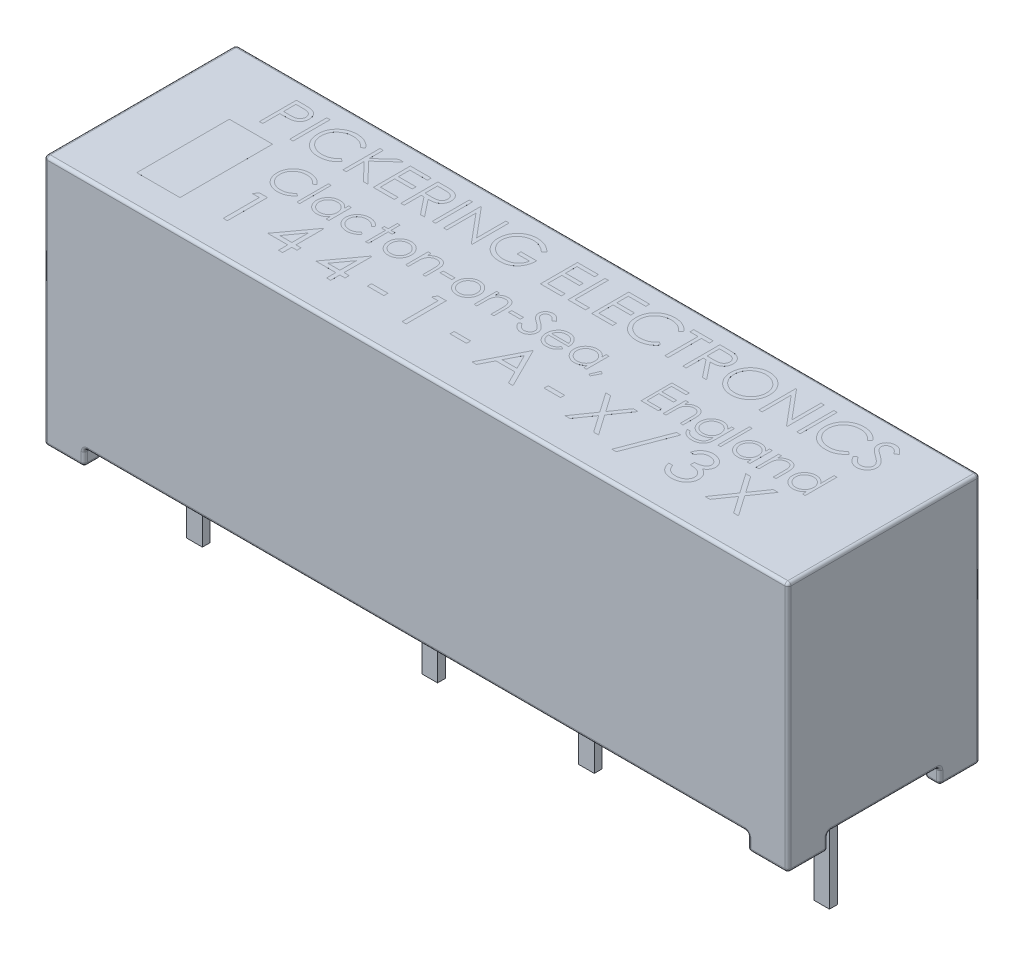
from build123d import *

# Parameters (mm, degrees)
SKETCH1_W               = 24.1
SKETCH1_H               = 6.22
MAIN_BODY_DEPTH         = 7.622
ORIGINAL_FOOT_DEPTH     = 0.508
RIGHT_FEET_COPY_1_DEPTH = 0.508
SKETCH3_W               = 0.508
SKETCH3_H               = 0.254
PINS_DEPTH              = 3.808
SKETCH4_W               = 1.4
SKETCH4_H               = 3
SKETCH4_W_2             = 0.107692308
SKETCH4_H_2             = 1.2
SKETCH4_W_3             = 0.08974359
SKETCH4_H_3             = 1.025641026
SKETCH4_W_4             = 0.384615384
SKETCH4_H_4             = 0.102564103
SKETCH4_W_5             = 0.533333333
SKETCH4_H_5             = 0.133333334
LETTERING_DEPTH         = 0.0001
FILLET1_R               = 0.1


with BuildPart() as part:
    # Sketch1 → Main Body (new body)
    with BuildSketch(Plane(origin=(0, 0, 0), x_dir=(1, 0, 0), z_dir=(0, 1, 0))):
        Rectangle(SKETCH1_W, SKETCH1_H)
    extrude(amount=MAIN_BODY_DEPTH)

    # Sketch2 → Original foot (add)
    with BuildSketch(Plane.XZ):
        Polygon((-12.05, 3.11), (-10.75, 3.11), (-10.75, 2.53065977), (-11.560513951, 2.53065977), (-11.560513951, 1.81), (-12.05, 1.81), align=None)
    original_foot = extrude(amount=ORIGINAL_FOOT_DEPTH)

    # Left foot: Original foot across plane
    add(original_foot.mirror(Plane.XY))

    # Right Feet: Original foot across plane
    add(original_foot.mirror(Plane(origin=(0, 0, 0), x_dir=(0, 0, 1), z_dir=(1, 0, 0))))

    # Right Feet copy 1 sketch → Right Feet copy 1 (add)
    with BuildSketch(Plane(origin=(0, 0, 0), x_dir=(-1, 0, 0), z_dir=(0, -1, 0))):
        Polygon((-12.05, 3.11), (-10.75, 3.11), (-10.75, 2.53065977), (-11.560513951, 2.53065977), (-11.560513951, 1.81), (-12.05, 1.81), align=None)
    extrude(amount=RIGHT_FEET_COPY_1_DEPTH)

    # Sketch3 → Pins (add)
    with BuildSketch(Plane.XZ):
        with Locations((-10.16, 0)):
            Rectangle(SKETCH3_W, SKETCH3_H)
        with Locations((-2.54, 0)):
            Rectangle(SKETCH3_W, SKETCH3_H)
        with Locations((10.16, 0)):
            Rectangle(SKETCH3_W, SKETCH3_H)
        with Locations((2.54, 0)):
            Rectangle(SKETCH3_W, SKETCH3_H)
    extrude(amount=PINS_DEPTH)

    # Sketch4 → Lettering (add)
    # profile 1 of 55: a face of its own
    with BuildSketch(Plane(origin=(0, 7.622, 0), x_dir=(-1, 0, 0), z_dir=(0, 1, 0))):
        with Locations((9.35, 0.61)):
            Rectangle(SKETCH4_W, SKETCH4_H)
    # profile 2 of 55: a face of its own
    with BuildSketch(Plane(origin=(0, 7.622, 0), x_dir=(-1, 0, 0), z_dir=(0, 1, 0))):
        with BuildLine():
            Line((9.496153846, -2.51), (9.260817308, -2.51))
            add(Edge.make_bspline(
                [(9.260817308, -2.51), (9.244630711, -2.509982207), (9.213616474, -2.509948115), (9.16914274, -2.508914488), (9.128750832, -2.507533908), (9.092527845, -2.505620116), (9.060362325, -2.503358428), (9.032399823, -2.5001863), (9.008420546, -2.496874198), (8.994052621, -2.493506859), (8.9875, -2.491971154)],
                knots=[0, 0, 0, 0, 1.415646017, 2.712440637, 3.8905458, 4.950247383, 5.884950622, 6.709939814, 7.411656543, 8, 8, 8, 8], degree=3))
            add(Edge.make_bspline(
                [(8.9875, -2.491971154), (8.979205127, -2.489700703), (8.962810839, -2.4852133), (8.939186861, -2.476226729), (8.916714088, -2.465566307), (8.895298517, -2.453434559), (8.875307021, -2.439258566), (8.856115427, -2.423856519), (8.838126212, -2.406605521), (8.821611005, -2.387528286), (8.806308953, -2.367249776), (8.793500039, -2.345252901), (8.782189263, -2.32230074), (8.773374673, -2.29783291), (8.766446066, -2.272172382), (8.761399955, -2.245252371), (8.758156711, -2.21713095), (8.757848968, -2.197909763), (8.757692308, -2.188125)],
                knots=[0, 0, 0, 0, 0.999333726, 1.975119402, 2.933498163, 3.889020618, 4.832249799, 5.779334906, 6.747801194, 7.724875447, 8.710438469, 9.696133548, 10.679360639, 11.681339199, 12.714023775, 13.766351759, 14.862936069, 16, 16, 16, 16], degree=3))
            add(Edge.make_bspline(
                [(8.757692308, -2.188125), (8.757836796, -2.178258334), (8.758119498, -2.158953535), (8.76151251, -2.130711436), (8.766082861, -2.103722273), (8.773110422, -2.07804589), (8.782314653, -2.053834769), (8.793111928, -2.030718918), (8.806134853, -2.009091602), (8.821098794, -1.988874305), (8.837745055, -1.970048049), (8.856003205, -1.952749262), (8.875799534, -1.937079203), (8.897071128, -1.923002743), (8.920025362, -1.910846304), (8.9443141, -1.899958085), (8.97014846, -1.890813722), (8.988025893, -1.886003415), (8.997115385, -1.883557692)],
                knots=[0, 0, 0, 0, 1.121902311, 2.195077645, 3.232258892, 4.234102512, 5.217864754, 6.176164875, 7.132989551, 8.084763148, 9.034132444, 9.988522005, 10.94243251, 11.903244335, 12.886203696, 13.894208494, 14.929344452, 16, 16, 16, 16], degree=3))
            add(Edge.make_bspline(
                [(8.997115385, -1.883557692), (9.004633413, -1.881960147), (9.02110961, -1.878459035), (9.048242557, -1.874523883), (9.079849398, -1.871296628), (9.115822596, -1.868284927), (9.156246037, -1.866689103), (9.20102701, -1.864815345), (9.250317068, -1.86393122), (9.284695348, -1.863875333), (9.302644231, -1.863846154)],
                knots=[0, 0, 0, 0, 0.601372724, 1.317943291, 2.144091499, 3.08771165, 4.142394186, 5.309582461, 6.595334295, 8, 8, 8, 8], degree=3))
            Line((9.302644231, -1.863846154), (9.388461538, -1.863846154))
            Line((9.388461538, -1.863846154), (9.388461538, -1.31))
            Line((9.388461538, -1.31), (9.496153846, -1.31))
            Line((9.496153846, -1.31), (9.496153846, -2.51))
        make_face()
        with BuildLine():
            Line((9.388461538, -2.386923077), (9.388461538, -1.986923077))
            Line((9.388461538, -1.986923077), (9.178365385, -1.984278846))
            add(Edge.make_bspline(
                [(9.178365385, -1.984278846), (9.168106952, -1.984272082), (9.148303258, -1.984259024), (9.119618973, -1.985648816), (9.093070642, -1.987160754), (9.068619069, -1.989605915), (9.046375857, -1.99258825), (9.026287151, -1.996575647), (9.008192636, -2.000642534), (8.987349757, -2.007699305), (8.964003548, -2.018345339), (8.938664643, -2.034246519), (8.917014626, -2.054278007), (8.898437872, -2.077044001), (8.883754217, -2.102396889), (8.873112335, -2.129447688), (8.866616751, -2.158093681), (8.865800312, -2.177674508), (8.865384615, -2.187644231)],
                knots=[0, 0, 0, 0, 1.160501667, 2.240324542, 3.248665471, 4.168823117, 5.020172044, 5.786515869, 6.485785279, 7.116517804, 8.272762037, 9.381837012, 10.485674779, 11.594342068, 12.695271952, 13.786226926, 14.872841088, 16, 16, 16, 16], degree=3))
            add(Edge.make_bspline(
                [(8.865384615, -2.187644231), (8.865818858, -2.197290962), (8.866682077, -2.21646747), (8.873058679, -2.244585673), (8.883866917, -2.271328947), (8.898449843, -2.296480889), (8.916581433, -2.319186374), (8.937800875, -2.338771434), (8.961778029, -2.354623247), (8.983907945, -2.365175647), (9.003712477, -2.37136381), (9.020831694, -2.37583135), (9.040259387, -2.378912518), (9.061811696, -2.381860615), (9.085461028, -2.384240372), (9.111357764, -2.385892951), (9.139415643, -2.386849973), (9.158893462, -2.386898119), (9.168990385, -2.386923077)],
                knots=[0, 0, 0, 0, 1.12039168, 2.227199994, 3.330242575, 4.460839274, 5.593542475, 6.693949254, 7.801736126, 8.92216649, 9.528704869, 10.210659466, 10.975987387, 11.81211542, 12.738540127, 13.736887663, 14.826846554, 16, 16, 16, 16], degree=3))
            Line((9.168990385, -2.386923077), (9.388461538, -2.386923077))
        make_face(mode=Mode.SUBTRACT)
    # profile 3 of 55: a face of its own
    with BuildSketch(Plane(origin=(0, 7.622, 0), x_dir=(-1, 0, 0), z_dir=(0, 1, 0))):
        with Locations((8.457692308, -1.91)):
            Rectangle(SKETCH4_W_2, SKETCH4_H_2)
    # profile 4 of 55: a face of its own
    with BuildSketch(Plane(origin=(0, 7.622, 0), x_dir=(-1, 0, 0), z_dir=(0, 1, 0))):
        with BuildLine():
            Line((7.034615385, -2.289807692), (7.128846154, -2.217692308))
            add(Edge.make_bspline(
                [(7.128846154, -2.217692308), (7.135568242, -2.225703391), (7.148921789, -2.241617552), (7.170403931, -2.263966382), (7.192796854, -2.284897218), (7.216069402, -2.304544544), (7.240760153, -2.322118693), (7.265928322, -2.338988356), (7.292488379, -2.353758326), (7.329029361, -2.371801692), (7.377017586, -2.390219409), (7.437218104, -2.406060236), (7.500148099, -2.416049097), (7.543071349, -2.417138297), (7.564903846, -2.417692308)],
                knots=[0, 0, 0, 0, 0.75789156, 1.505565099, 2.245254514, 2.979266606, 3.711207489, 4.440978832, 5.174393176, 5.91211879, 7.394186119, 8.890401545, 10.418332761, 12, 12, 12, 12], degree=3))
            add(Edge.make_bspline(
                [(7.564903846, -2.417692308), (7.57693226, -2.417553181), (7.600877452, -2.41727622), (7.636416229, -2.413648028), (7.671358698, -2.408489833), (7.705574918, -2.401022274), (7.738996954, -2.391300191), (7.771879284, -2.37989878), (7.803834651, -2.365710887), (7.835247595, -2.350042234), (7.865342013, -2.33233961), (7.893822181, -2.313036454), (7.920559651, -2.292323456), (7.945622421, -2.270249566), (7.968757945, -2.246557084), (7.990212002, -2.221512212), (8.009957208, -2.195001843), (8.027973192, -2.167152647), (8.044087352, -2.138102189), (8.058060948, -2.107975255), (8.069872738, -2.076886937), (8.079455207, -2.04490386), (8.086954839, -2.012139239), (8.092146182, -1.978475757), (8.095740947, -1.943972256), (8.096015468, -1.920586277), (8.096153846, -1.908798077)],
                knots=[0, 0, 0, 0, 1.054960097, 2.100129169, 3.131228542, 4.15308236, 5.169990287, 6.183953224, 7.204064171, 8.235355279, 9.262684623, 10.264978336, 11.252191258, 12.228402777, 13.192898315, 14.155264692, 15.119862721, 16.091023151, 17.063429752, 18.032246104, 19.00241354, 19.978852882, 20.959535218, 21.948948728, 22.966123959, 24, 24, 24, 24], degree=3))
            add(Edge.make_bspline(
                [(8.096153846, -1.908798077), (8.095720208, -1.89106202), (8.094868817, -1.856239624), (8.087323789, -1.805226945), (8.075766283, -1.756309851), (8.058728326, -1.709819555), (8.037300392, -1.665368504), (8.010564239, -1.623495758), (7.979481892, -1.583587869), (7.943734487, -1.546611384), (7.904508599, -1.512835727), (7.862423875, -1.483092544), (7.817583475, -1.458298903), (7.770482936, -1.437667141), (7.720759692, -1.421807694), (7.668503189, -1.410642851), (7.613827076, -1.403359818), (7.576466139, -1.402662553), (7.557451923, -1.402307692)],
                knots=[0, 0, 0, 0, 1.029159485, 2.020618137, 2.987588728, 3.942669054, 4.889339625, 5.846988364, 6.821327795, 7.821533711, 8.827683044, 9.822769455, 10.807800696, 11.797391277, 12.803701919, 13.832062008, 14.896664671, 16, 16, 16, 16], degree=3))
            add(Edge.make_bspline(
                [(7.557451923, -1.402307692), (7.53650243, -1.402886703), (7.495268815, -1.404026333), (7.434799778, -1.413680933), (7.376913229, -1.429335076), (7.321606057, -1.451242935), (7.269034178, -1.479722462), (7.219115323, -1.514247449), (7.171807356, -1.555146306), (7.143360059, -1.586374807), (7.128846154, -1.602307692)],
                knots=[0, 0, 0, 0, 1.028121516, 2.023589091, 2.998037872, 3.967518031, 4.937445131, 5.927275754, 6.942489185, 8, 8, 8, 8], degree=3))
            Line((7.128846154, -1.602307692), (7.034615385, -1.530913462))
            add(Edge.make_bspline(
                [(7.034615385, -1.530913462), (7.042198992, -1.521129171), (7.057329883, -1.501607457), (7.08182598, -1.474080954), (7.107649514, -1.448211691), (7.134870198, -1.424134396), (7.163523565, -1.401728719), (7.193597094, -1.381098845), (7.224940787, -1.362015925), (7.257593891, -1.3447195), (7.291558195, -1.329328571), (7.32654263, -1.315876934), (7.362611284, -1.304581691), (7.399479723, -1.295091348), (7.437526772, -1.288313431), (7.476317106, -1.282919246), (7.516211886, -1.279718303), (7.543103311, -1.279394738), (7.556730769, -1.279230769)],
                knots=[0, 0, 0, 0, 0.986880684, 1.969034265, 2.935876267, 3.899990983, 4.864973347, 5.834408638, 6.8063673, 7.789580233, 8.778939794, 9.778051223, 10.776304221, 11.791326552, 12.811423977, 13.855999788, 14.91350973, 16, 16, 16, 16], degree=3))
            add(Edge.make_bspline(
                [(7.556730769, -1.279230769), (7.569637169, -1.279320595), (7.595157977, -1.279498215), (7.632837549, -1.28237553), (7.669519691, -1.286301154), (7.705099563, -1.292212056), (7.739771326, -1.299187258), (7.773220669, -1.308537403), (7.805776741, -1.319011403), (7.837308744, -1.331321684), (7.867843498, -1.345212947), (7.897282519, -1.36091291), (7.925612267, -1.378289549), (7.953111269, -1.396959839), (7.979373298, -1.417523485), (8.004625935, -1.439694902), (8.029010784, -1.463399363), (8.044097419, -1.480492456), (8.051682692, -1.489086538)],
                knots=[0, 0, 0, 0, 1.114604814, 2.203992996, 3.262667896, 4.300477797, 5.318619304, 6.316056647, 7.298880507, 8.271930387, 9.238335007, 10.195173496, 11.151986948, 12.108099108, 13.064862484, 14.031167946, 15.010108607, 16, 16, 16, 16], degree=3))
            add(Edge.make_bspline(
                [(8.051682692, -1.489086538), (8.063831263, -1.504015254), (8.087981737, -1.533692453), (8.118893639, -1.581785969), (8.145265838, -1.631954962), (8.166826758, -1.684490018), (8.18338806, -1.739411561), (8.195031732, -1.796631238), (8.202545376, -1.856034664), (8.203407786, -1.89643528), (8.203846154, -1.916971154)],
                knots=[0, 0, 0, 0, 0.994611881, 1.977215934, 2.950189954, 3.921972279, 4.908960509, 5.911694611, 6.938501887, 8, 8, 8, 8], degree=3))
            add(Edge.make_bspline(
                [(8.203846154, -1.916971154), (8.20331056, -1.938554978), (8.202256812, -1.981019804), (8.193378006, -2.043355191), (8.178921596, -2.102990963), (8.159015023, -2.160156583), (8.132752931, -2.214524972), (8.100960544, -2.26632575), (8.063327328, -2.315516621), (8.02032592, -2.361468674), (7.973157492, -2.403481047), (7.922648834, -2.440443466), (7.868894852, -2.47120368), (7.812488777, -2.496916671), (7.75300796, -2.516680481), (7.69057938, -2.530515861), (7.625320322, -2.539127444), (7.580796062, -2.540216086), (7.558173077, -2.540769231)],
                knots=[0, 0, 0, 0, 1.032901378, 2.032168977, 3.007206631, 3.966850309, 4.924221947, 5.891988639, 6.871730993, 7.884084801, 8.900290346, 9.89161143, 10.874607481, 11.860025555, 12.854717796, 13.869097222, 14.917278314, 16, 16, 16, 16], degree=3))
            add(Edge.make_bspline(
                [(7.558173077, -2.540769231), (7.544385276, -2.540603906), (7.517093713, -2.540276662), (7.476721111, -2.537086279), (7.437416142, -2.531766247), (7.399069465, -2.524515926), (7.36161783, -2.515497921), (7.325229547, -2.504206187), (7.290008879, -2.490553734), (7.255718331, -2.475358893), (7.222797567, -2.457956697), (7.191262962, -2.439041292), (7.161370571, -2.418248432), (7.132926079, -2.395881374), (7.106060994, -2.371768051), (7.080372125, -2.346313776), (7.056622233, -2.318843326), (7.041964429, -2.299503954), (7.034615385, -2.289807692)],
                knots=[0, 0, 0, 0, 1.096566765, 2.170543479, 3.218870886, 4.250164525, 5.273529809, 6.281496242, 7.278154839, 8.276706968, 9.263143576, 10.238168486, 11.199979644, 12.157579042, 13.114563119, 14.070017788, 15.032356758, 16, 16, 16, 16], degree=3))
        make_face()
    # profile 5 of 55: a face of its own
    with BuildSketch(Plane(origin=(0, 7.622, 0), x_dir=(-1, 0, 0), z_dir=(0, 1, 0))):
        Polygon((6.788461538, -2.51), (6.680769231, -2.51), (6.680769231, -2.053028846), (6.180528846, -2.51), (6.026923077, -2.51), (6.616586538, -1.971538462), (5.980769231, -1.31), (6.124278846, -1.31), (6.680769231, -1.889086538), (6.680769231, -1.31), (6.788461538, -1.31), align=None)
    # profile 6 of 55: a face of its own
    with BuildSketch(Plane(origin=(0, 7.622, 0), x_dir=(-1, 0, 0), z_dir=(0, 1, 0))):
        Polygon((5.803846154, -2.51), (5.126923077, -2.51), (5.126923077, -2.386923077), (5.696153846, -2.386923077), (5.696153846, -2.017692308), (5.126923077, -2.017692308), (5.126923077, -1.894615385), (5.696153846, -1.894615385), (5.696153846, -1.433076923), (5.126923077, -1.433076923), (5.126923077, -1.31), (5.803846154, -1.31), align=None)
    # profile 7 of 55: a face of its own
    with BuildSketch(Plane(origin=(0, 7.622, 0), x_dir=(-1, 0, 0), z_dir=(0, 1, 0))):
        with BuildLine():
            Line((4.911538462, -2.51), (4.671394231, -2.51))
            add(Edge.make_bspline(
                [(4.671394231, -2.51), (4.655368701, -2.509946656), (4.624597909, -2.50984423), (4.580515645, -2.509273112), (4.54046064, -2.50763619), (4.504453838, -2.506227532), (4.472495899, -2.503658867), (4.444488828, -2.501203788), (4.420561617, -2.497989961), (4.406077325, -2.495005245), (4.399519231, -2.493653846)],
                knots=[0, 0, 0, 0, 1.410062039, 2.707475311, 3.878576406, 4.937260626, 5.877586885, 6.699081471, 7.410979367, 8, 8, 8, 8], degree=3))
            add(Edge.make_bspline(
                [(4.399519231, -2.493653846), (4.390739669, -2.49148491), (4.373367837, -2.487193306), (4.348358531, -2.478117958), (4.324517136, -2.467632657), (4.301930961, -2.455223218), (4.280605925, -2.441099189), (4.260544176, -2.425203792), (4.242014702, -2.407400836), (4.224358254, -2.388427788), (4.208940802, -2.367458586), (4.195061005, -2.345557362), (4.183409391, -2.322302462), (4.174240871, -2.297811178), (4.166554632, -2.272323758), (4.161388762, -2.245588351), (4.158171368, -2.217691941), (4.157853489, -2.198710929), (4.157692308, -2.189086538)],
                knots=[0, 0, 0, 0, 1.027276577, 2.032638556, 3.019345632, 3.985365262, 4.957888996, 5.923693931, 6.890056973, 7.876427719, 8.865527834, 9.843495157, 10.821038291, 11.815616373, 12.812734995, 13.843357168, 14.906466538, 16, 16, 16, 16], degree=3))
            add(Edge.make_bspline(
                [(4.157692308, -2.189086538), (4.158195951, -2.173097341), (4.15917869, -2.141898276), (4.168341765, -2.096620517), (4.18335019, -2.054383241), (4.20403492, -2.015245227), (4.230363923, -1.979948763), (4.262005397, -1.949051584), (4.298797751, -1.922957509), (4.333209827, -1.905054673), (4.363622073, -1.893535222), (4.388732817, -1.885389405), (4.416145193, -1.87920187), (4.445465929, -1.873578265), (4.476921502, -1.869287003), (4.510448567, -1.866239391), (4.546130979, -1.864279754), (4.570590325, -1.863993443), (4.583173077, -1.863846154)],
                knots=[0, 0, 0, 0, 1.260402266, 2.459371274, 3.627181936, 4.786749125, 5.93865593, 7.087644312, 8.261344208, 9.485713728, 10.136162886, 10.825977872, 11.566646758, 12.35154167, 13.181268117, 14.0701832, 15.007234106, 16, 16, 16, 16], degree=3))
            Line((4.583173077, -1.863846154), (4.142307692, -1.31))
            Line((4.142307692, -1.31), (4.275480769, -1.31))
            Line((4.275480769, -1.31), (4.716346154, -1.863846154))
            Line((4.716346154, -1.863846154), (4.803846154, -1.863846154))
            Line((4.803846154, -1.863846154), (4.803846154, -1.31))
            Line((4.803846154, -1.31), (4.911538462, -1.31))
            Line((4.911538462, -1.31), (4.911538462, -2.51))
        make_face()
        with BuildLine():
            Line((4.803846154, -2.386923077), (4.803846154, -1.986923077))
            Line((4.803846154, -1.986923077), (4.584134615, -1.985240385))
            add(Edge.make_bspline(
                [(4.584134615, -1.985240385), (4.573876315, -1.985235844), (4.553992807, -1.985227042), (4.525226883, -1.986596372), (4.498442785, -1.988153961), (4.473743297, -1.990536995), (4.451116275, -1.993606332), (4.430576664, -1.997451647), (4.412079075, -2.001912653), (4.390574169, -2.008887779), (4.366284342, -2.019462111), (4.34043109, -2.03585853), (4.317823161, -2.055687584), (4.299027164, -2.078648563), (4.283930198, -2.10400223), (4.27344401, -2.131174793), (4.266533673, -2.159738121), (4.265772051, -2.179350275), (4.265384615, -2.189326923)],
                knots=[0, 0, 0, 0, 1.146399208, 2.222048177, 3.218135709, 4.144938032, 4.994811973, 5.769438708, 6.479732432, 7.119818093, 8.294689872, 9.430121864, 10.527913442, 11.641375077, 12.733452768, 13.811150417, 14.886538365, 16, 16, 16, 16], degree=3))
            add(Edge.make_bspline(
                [(4.265384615, -2.189326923), (4.265791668, -2.198979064), (4.266598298, -2.218106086), (4.273333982, -2.246044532), (4.284332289, -2.272610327), (4.299386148, -2.297437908), (4.318122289, -2.31980791), (4.339945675, -2.338889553), (4.364342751, -2.354742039), (4.386960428, -2.365201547), (4.407324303, -2.371355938), (4.424923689, -2.375823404), (4.444982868, -2.378952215), (4.467265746, -2.381829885), (4.491870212, -2.38426683), (4.518811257, -2.385884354), (4.54806962, -2.386851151), (4.568348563, -2.386898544), (4.578846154, -2.386923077)],
                knots=[0, 0, 0, 0, 1.100596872, 2.180981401, 3.259506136, 4.371595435, 5.481727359, 6.576991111, 7.667816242, 8.793363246, 9.406619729, 10.09427138, 10.864108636, 11.721733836, 12.6590937, 13.685439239, 14.801845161, 16, 16, 16, 16], degree=3))
            Line((4.578846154, -2.386923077), (4.803846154, -2.386923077))
        make_face(mode=Mode.SUBTRACT)
    # profile 8 of 55: a face of its own
    with BuildSketch(Plane(origin=(0, 7.622, 0), x_dir=(-1, 0, 0), z_dir=(0, 1, 0))):
        with Locations((3.842307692, -1.91)):
            Rectangle(SKETCH4_W_2, SKETCH4_H_2)
    # profile 9 of 55: a face of its own
    with BuildSketch(Plane(origin=(0, 7.622, 0), x_dir=(-1, 0, 0), z_dir=(0, 1, 0))):
        Polygon((3.526923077, -1.31), (3.526923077, -2.51), (3.504326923, -2.51), (2.711538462, -1.565528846), (2.711538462, -2.51), (2.603846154, -2.51), (2.603846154, -1.31), (2.628365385, -1.31), (3.419230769, -2.252307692), (3.419230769, -1.31), align=None)
    # profile 10 of 55: a face of its own
    with BuildSketch(Plane(origin=(0, 7.622, 0), x_dir=(-1, 0, 0), z_dir=(0, 1, 0))):
        with BuildLine():
            Line((1.173076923, -2.305192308), (1.265384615, -2.217692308))
            add(Edge.make_bspline(
                [(1.265384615, -2.217692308), (1.282186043, -2.233384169), (1.315299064, -2.264310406), (1.369026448, -2.304884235), (1.425160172, -2.33937083), (1.483243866, -2.367704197), (1.542157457, -2.38972872), (1.600724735, -2.405653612), (1.658535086, -2.415895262), (1.696914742, -2.417098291), (1.715865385, -2.417692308)],
                knots=[0, 0, 0, 0, 1.091957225, 2.152079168, 3.193085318, 4.218301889, 5.218403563, 6.17723952, 7.099979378, 8, 8, 8, 8], degree=3))
            add(Edge.make_bspline(
                [(1.715865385, -2.417692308), (1.727493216, -2.417550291), (1.750718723, -2.417266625), (1.785218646, -2.413654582), (1.819352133, -2.408443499), (1.853001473, -2.40098118), (1.886300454, -2.391288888), (1.919174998, -2.379586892), (1.951561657, -2.365500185), (1.983290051, -2.349440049), (2.01420648, -2.331907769), (2.043283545, -2.312354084), (2.070642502, -2.291380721), (2.096089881, -2.268712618), (2.119974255, -2.244727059), (2.141858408, -2.219083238), (2.162220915, -2.192160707), (2.180300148, -2.163573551), (2.196641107, -2.134134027), (2.210790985, -2.104076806), (2.22297485, -2.073613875), (2.232710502, -2.042728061), (2.240537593, -2.011439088), (2.24607771, -1.979795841), (2.249189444, -1.947642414), (2.249728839, -1.92611207), (2.25, -1.915288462)],
                knots=[0, 0, 0, 0, 1.028307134, 2.053947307, 3.065600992, 4.082111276, 5.100671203, 6.132125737, 7.167228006, 8.222953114, 9.277225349, 10.309459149, 11.320441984, 12.324791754, 13.322338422, 14.312705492, 15.305176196, 16.306142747, 17.302479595, 18.282363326, 19.243345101, 20.20291386, 21.145121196, 22.094978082, 23.042318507, 24, 24, 24, 24], degree=3))
            add(Edge.make_bspline(
                [(2.25, -1.915288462), (2.249738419, -1.904224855), (2.249215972, -1.882127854), (2.245940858, -1.849136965), (2.239657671, -1.816703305), (2.231982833, -1.784520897), (2.22111931, -1.753000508), (2.208490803, -1.721680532), (2.193263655, -1.69085205), (2.175729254, -1.660729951), (2.156351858, -1.631416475), (2.135043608, -1.603571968), (2.11176426, -1.57752184), (2.086941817, -1.552885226), (2.060349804, -1.529817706), (2.031730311, -1.508597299), (2.001483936, -1.488895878), (1.969597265, -1.470929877), (1.936407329, -1.454881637), (1.902376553, -1.440610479), (1.867395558, -1.428857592), (1.831648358, -1.419278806), (1.79517752, -1.411427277), (1.757797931, -1.406376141), (1.719784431, -1.402710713), (1.694159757, -1.402442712), (1.68125, -1.402307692)],
                knots=[0, 0, 0, 0, 0.935896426, 1.86923723, 2.799743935, 3.728471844, 4.66505513, 5.616527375, 6.583419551, 7.570341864, 8.562833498, 9.553750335, 10.533080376, 11.5155245, 12.510142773, 13.507781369, 14.526649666, 15.561487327, 16.601173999, 17.643331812, 18.680652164, 19.71969803, 20.772446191, 21.833473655, 22.9085001, 24, 24, 24, 24], degree=3))
            add(Edge.make_bspline(
                [(1.68125, -1.402307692), (1.665691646, -1.402632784), (1.63514029, -1.403271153), (1.590231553, -1.408244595), (1.547095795, -1.41600224), (1.505873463, -1.427398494), (1.466414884, -1.441823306), (1.428865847, -1.459661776), (1.393121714, -1.480725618), (1.359340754, -1.504590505), (1.328312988, -1.5311735), (1.300110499, -1.559626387), (1.275559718, -1.590176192), (1.254500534, -1.622816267), (1.236374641, -1.657065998), (1.221915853, -1.693512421), (1.210732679, -1.731748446), (1.206157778, -1.758182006), (1.203846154, -1.771538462)],
                knots=[0, 0, 0, 0, 1.130234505, 2.219399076, 3.279128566, 4.311639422, 5.322903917, 6.328167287, 7.327698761, 8.334124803, 9.329374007, 10.292761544, 11.24113083, 12.171311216, 13.111441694, 14.052040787, 15.015727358, 16, 16, 16, 16], degree=3))
            Line((1.203846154, -1.771538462), (1.603846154, -1.771538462))
            Line((1.603846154, -1.771538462), (1.603846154, -1.894615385))
            Line((1.603846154, -1.894615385), (1.096153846, -1.894615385))
            add(Edge.make_bspline(
                [(1.096153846, -1.894615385), (1.096738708, -1.871675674), (1.09788339, -1.826778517), (1.105912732, -1.761302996), (1.118878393, -1.699461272), (1.1365905, -1.641188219), (1.159519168, -1.586566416), (1.187418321, -1.535540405), (1.220734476, -1.488439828), (1.258280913, -1.44488017), (1.300418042, -1.40602444), (1.346007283, -1.371873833), (1.395123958, -1.343107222), (1.447721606, -1.319703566), (1.50362804, -1.301438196), (1.562972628, -1.288487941), (1.625674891, -1.280729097), (1.668647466, -1.279737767), (1.690625, -1.279230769)],
                knots=[0, 0, 0, 0, 1.140356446, 2.231883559, 3.274166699, 4.278491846, 5.25512956, 6.21435461, 7.1637429, 8.11826594, 9.068280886, 10.0076534, 10.945064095, 11.891975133, 12.864533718, 13.863980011, 14.907571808, 16, 16, 16, 16], degree=3))
            add(Edge.make_bspline(
                [(1.690625, -1.279230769), (1.704171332, -1.279425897), (1.730889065, -1.27981075), (1.770348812, -1.282545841), (1.808720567, -1.286756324), (1.845998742, -1.293114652), (1.882320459, -1.300902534), (1.917504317, -1.310875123), (1.951684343, -1.322418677), (1.984913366, -1.335548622), (2.016889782, -1.350761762), (2.047756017, -1.367667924), (2.077682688, -1.386179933), (2.106465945, -1.406617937), (2.134255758, -1.428829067), (2.160872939, -1.452857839), (2.186466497, -1.478630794), (2.202498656, -1.496932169), (2.210576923, -1.506153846)],
                knots=[0, 0, 0, 0, 1.107784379, 2.184907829, 3.233506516, 4.263428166, 5.276301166, 6.270063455, 7.25232949, 8.225834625, 9.190232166, 10.146266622, 11.1027726, 12.066435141, 13.031522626, 14.010570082, 14.99756817, 16, 16, 16, 16], degree=3))
            add(Edge.make_bspline(
                [(2.210576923, -1.506153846), (2.222297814, -1.520783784), (2.245545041, -1.549800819), (2.275468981, -1.596292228), (2.300978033, -1.644430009), (2.321675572, -1.694348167), (2.337837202, -1.746000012), (2.349427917, -1.79931954), (2.356218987, -1.854375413), (2.357197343, -1.891632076), (2.357692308, -1.910480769)],
                knots=[0, 0, 0, 0, 1.023165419, 2.029347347, 3.013907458, 3.994755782, 4.975994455, 5.96558838, 6.970761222, 8, 8, 8, 8], degree=3))
            add(Edge.make_bspline(
                [(2.357692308, -1.910480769), (2.357509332, -1.924594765), (2.357145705, -1.952643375), (2.352755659, -1.994288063), (2.346419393, -2.035182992), (2.337241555, -2.075366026), (2.325165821, -2.114658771), (2.310663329, -2.153363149), (2.293676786, -2.191324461), (2.273854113, -2.228206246), (2.252277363, -2.263995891), (2.228014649, -2.297566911), (2.202413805, -2.329568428), (2.174248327, -2.359094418), (2.144573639, -2.387088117), (2.112651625, -2.412811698), (2.079006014, -2.436699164), (2.043365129, -2.458283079), (2.006294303, -2.477677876), (1.967873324, -2.494679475), (1.928116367, -2.50873101), (1.887320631, -2.520653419), (1.845177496, -2.529470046), (1.801992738, -2.5358639), (1.757541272, -2.540238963), (1.727494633, -2.540590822), (1.712259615, -2.540769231)],
                knots=[0, 0, 0, 0, 1.009025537, 2.005226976, 2.991671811, 3.967589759, 4.950148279, 5.929425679, 6.922109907, 7.921964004, 8.922507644, 9.908469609, 10.882248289, 11.851158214, 12.824245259, 13.798023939, 14.780666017, 15.773333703, 16.775582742, 17.771174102, 18.775387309, 19.789283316, 20.80873549, 21.851817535, 22.910773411, 24, 24, 24, 24], degree=3))
            add(Edge.make_bspline(
                [(1.712259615, -2.540769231), (1.699834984, -2.540571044), (1.675198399, -2.540178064), (1.638539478, -2.537440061), (1.602519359, -2.533148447), (1.56695735, -2.527147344), (1.531988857, -2.519208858), (1.497507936, -2.509534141), (1.463579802, -2.498332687), (1.430244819, -2.484963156), (1.397276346, -2.46979101), (1.364491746, -2.452711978), (1.332002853, -2.433434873), (1.299753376, -2.411902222), (1.267539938, -2.38848391), (1.235872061, -2.362510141), (1.203985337, -2.335005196), (1.183481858, -2.315228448), (1.173076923, -2.305192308)],
                knots=[0, 0, 0, 0, 0.985875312, 1.954874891, 2.915472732, 3.863573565, 4.815313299, 5.759461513, 6.704487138, 7.649063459, 8.607849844, 9.583336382, 10.581114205, 11.603942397, 12.659508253, 13.739925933, 14.853076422, 16, 16, 16, 16], degree=3))
        make_face()
    # profile 11 of 55: a face of its own
    with BuildSketch(Plane(origin=(0, 7.622, 0), x_dir=(-1, 0, 0), z_dir=(0, 1, 0))):
        Polygon((0.388461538, -2.51), (-0.288461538, -2.51), (-0.288461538, -2.386923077), (0.280769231, -2.386923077), (0.280769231, -2.017692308), (-0.288461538, -2.017692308), (-0.288461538, -1.894615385), (0.280769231, -1.894615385), (0.280769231, -1.433076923), (-0.288461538, -1.433076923), (-0.288461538, -1.31), (0.388461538, -1.31), align=None)
    # profile 12 of 55: a face of its own
    with BuildSketch(Plane(origin=(0, 7.622, 0), x_dir=(-1, 0, 0), z_dir=(0, 1, 0))):
        Polygon((-0.503846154, -2.51), (-0.611538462, -2.51), (-0.611538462, -1.433076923), (-1.073076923, -1.433076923), (-1.073076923, -1.31), (-0.503846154, -1.31), align=None)
    # profile 13 of 55: a face of its own
    with BuildSketch(Plane(origin=(0, 7.622, 0), x_dir=(-1, 0, 0), z_dir=(0, 1, 0))):
        Polygon((-1.273076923, -2.51), (-1.95, -2.51), (-1.95, -2.386923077), (-1.380769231, -2.386923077), (-1.380769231, -2.017692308), (-1.95, -2.017692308), (-1.95, -1.894615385), (-1.380769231, -1.894615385), (-1.380769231, -1.433076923), (-1.95, -1.433076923), (-1.95, -1.31), (-1.273076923, -1.31), align=None)
    # profile 14 of 55: a face of its own
    with BuildSketch(Plane(origin=(0, 7.622, 0), x_dir=(-1, 0, 0), z_dir=(0, 1, 0))):
        with BuildLine():
            Line((-3.273076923, -2.289807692), (-3.178846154, -2.217692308))
            add(Edge.make_bspline(
                [(-3.178846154, -2.217692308), (-3.172124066, -2.225703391), (-3.158770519, -2.241617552), (-3.137288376, -2.263966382), (-3.114895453, -2.284897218), (-3.091622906, -2.304544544), (-3.066932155, -2.322118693), (-3.041763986, -2.338988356), (-3.015203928, -2.353758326), (-2.978662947, -2.371801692), (-2.930674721, -2.390219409), (-2.870474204, -2.406060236), (-2.807544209, -2.416049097), (-2.764620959, -2.417138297), (-2.742788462, -2.417692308)],
                knots=[0, 0, 0, 0, 0.75789156, 1.505565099, 2.245254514, 2.979266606, 3.711207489, 4.440978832, 5.174393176, 5.91211879, 7.394186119, 8.890401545, 10.418332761, 12, 12, 12, 12], degree=3))
            add(Edge.make_bspline(
                [(-2.742788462, -2.417692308), (-2.730760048, -2.417553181), (-2.706814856, -2.41727622), (-2.671276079, -2.413648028), (-2.63633361, -2.408489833), (-2.602117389, -2.401022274), (-2.568695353, -2.391300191), (-2.535813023, -2.37989878), (-2.503857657, -2.365710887), (-2.472444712, -2.350042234), (-2.442350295, -2.33233961), (-2.413870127, -2.313036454), (-2.387132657, -2.292323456), (-2.362069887, -2.270249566), (-2.338934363, -2.246557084), (-2.317480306, -2.221512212), (-2.297735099, -2.195001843), (-2.279719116, -2.167152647), (-2.263604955, -2.138102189), (-2.24963136, -2.107975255), (-2.23781957, -2.076886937), (-2.228237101, -2.04490386), (-2.220737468, -2.012139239), (-2.215546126, -1.978475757), (-2.211951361, -1.943972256), (-2.21167684, -1.920586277), (-2.211538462, -1.908798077)],
                knots=[0, 0, 0, 0, 1.054960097, 2.100129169, 3.131228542, 4.15308236, 5.169990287, 6.183953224, 7.204064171, 8.235355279, 9.262684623, 10.264978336, 11.252191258, 12.228402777, 13.192898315, 14.155264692, 15.119862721, 16.091023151, 17.063429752, 18.032246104, 19.00241354, 19.978852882, 20.959535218, 21.948948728, 22.966123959, 24, 24, 24, 24], degree=3))
            add(Edge.make_bspline(
                [(-2.211538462, -1.908798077), (-2.2119721, -1.89106202), (-2.21282349, -1.856239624), (-2.220368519, -1.805226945), (-2.231926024, -1.756309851), (-2.248963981, -1.709819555), (-2.270391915, -1.665368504), (-2.297128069, -1.623495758), (-2.328210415, -1.583587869), (-2.36395782, -1.546611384), (-2.403183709, -1.512835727), (-2.445268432, -1.483092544), (-2.490108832, -1.458298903), (-2.537209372, -1.437667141), (-2.586932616, -1.421807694), (-2.639189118, -1.410642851), (-2.693865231, -1.403359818), (-2.731226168, -1.402662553), (-2.750240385, -1.402307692)],
                knots=[0, 0, 0, 0, 1.029159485, 2.020618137, 2.987588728, 3.942669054, 4.889339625, 5.846988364, 6.821327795, 7.821533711, 8.827683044, 9.822769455, 10.807800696, 11.797391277, 12.803701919, 13.832062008, 14.896664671, 16, 16, 16, 16], degree=3))
            add(Edge.make_bspline(
                [(-2.750240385, -1.402307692), (-2.771189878, -1.402886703), (-2.812423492, -1.404026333), (-2.87289253, -1.413680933), (-2.930779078, -1.429335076), (-2.986086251, -1.451242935), (-3.03865813, -1.479722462), (-3.088576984, -1.514247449), (-3.135884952, -1.555146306), (-3.164332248, -1.586374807), (-3.178846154, -1.602307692)],
                knots=[0, 0, 0, 0, 1.028121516, 2.023589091, 2.998037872, 3.967518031, 4.937445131, 5.927275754, 6.942489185, 8, 8, 8, 8], degree=3))
            Line((-3.178846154, -1.602307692), (-3.273076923, -1.530913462))
            add(Edge.make_bspline(
                [(-3.273076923, -1.530913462), (-3.265493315, -1.521129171), (-3.250362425, -1.501607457), (-3.225866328, -1.474080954), (-3.200042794, -1.448211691), (-3.17282211, -1.424134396), (-3.144168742, -1.401728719), (-3.114095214, -1.381098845), (-3.082751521, -1.362015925), (-3.050098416, -1.3447195), (-3.016134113, -1.329328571), (-2.981149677, -1.315876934), (-2.945081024, -1.304581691), (-2.908212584, -1.295091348), (-2.870165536, -1.288313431), (-2.831375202, -1.282919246), (-2.791480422, -1.279718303), (-2.764588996, -1.279394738), (-2.750961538, -1.279230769)],
                knots=[0, 0, 0, 0, 0.986880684, 1.969034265, 2.935876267, 3.899990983, 4.864973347, 5.834408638, 6.8063673, 7.789580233, 8.778939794, 9.778051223, 10.776304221, 11.791326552, 12.811423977, 13.855999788, 14.91350973, 16, 16, 16, 16], degree=3))
            add(Edge.make_bspline(
                [(-2.750961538, -1.279230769), (-2.738055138, -1.279320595), (-2.71253433, -1.279498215), (-2.674854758, -1.28237553), (-2.638172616, -1.286301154), (-2.602592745, -1.292212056), (-2.567920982, -1.299187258), (-2.534471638, -1.308537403), (-2.501915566, -1.319011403), (-2.470383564, -1.331321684), (-2.43984881, -1.345212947), (-2.410409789, -1.36091291), (-2.38208004, -1.378289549), (-2.354581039, -1.396959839), (-2.32831901, -1.417523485), (-2.303066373, -1.439694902), (-2.278681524, -1.463399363), (-2.263594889, -1.480492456), (-2.256009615, -1.489086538)],
                knots=[0, 0, 0, 0, 1.114604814, 2.203992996, 3.262667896, 4.300477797, 5.318619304, 6.316056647, 7.298880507, 8.271930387, 9.238335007, 10.195173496, 11.151986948, 12.108099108, 13.064862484, 14.031167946, 15.010108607, 16, 16, 16, 16], degree=3))
            add(Edge.make_bspline(
                [(-2.256009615, -1.489086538), (-2.243861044, -1.504015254), (-2.21971057, -1.533692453), (-2.188798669, -1.581785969), (-2.16242647, -1.631954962), (-2.14086555, -1.684490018), (-2.124304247, -1.739411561), (-2.112660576, -1.796631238), (-2.105146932, -1.856034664), (-2.104284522, -1.89643528), (-2.103846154, -1.916971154)],
                knots=[0, 0, 0, 0, 0.994611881, 1.977215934, 2.950189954, 3.921972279, 4.908960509, 5.911694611, 6.938501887, 8, 8, 8, 8], degree=3))
            add(Edge.make_bspline(
                [(-2.103846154, -1.916971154), (-2.104381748, -1.938554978), (-2.105435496, -1.981019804), (-2.114314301, -2.043355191), (-2.128770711, -2.102990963), (-2.148677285, -2.160156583), (-2.174939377, -2.214524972), (-2.206731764, -2.26632575), (-2.24436498, -2.315516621), (-2.287366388, -2.361468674), (-2.334534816, -2.403481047), (-2.385043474, -2.440443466), (-2.438797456, -2.47120368), (-2.49520353, -2.496916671), (-2.554684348, -2.516680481), (-2.617112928, -2.530515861), (-2.682371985, -2.539127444), (-2.726896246, -2.540216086), (-2.749519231, -2.540769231)],
                knots=[0, 0, 0, 0, 1.032901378, 2.032168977, 3.007206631, 3.966850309, 4.924221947, 5.891988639, 6.871730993, 7.884084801, 8.900290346, 9.89161143, 10.874607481, 11.860025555, 12.854717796, 13.869097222, 14.917278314, 16, 16, 16, 16], degree=3))
            add(Edge.make_bspline(
                [(-2.749519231, -2.540769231), (-2.763307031, -2.540603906), (-2.790598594, -2.540276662), (-2.830971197, -2.537086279), (-2.870276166, -2.531766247), (-2.908622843, -2.524515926), (-2.946074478, -2.515497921), (-2.982462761, -2.504206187), (-3.017683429, -2.490553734), (-3.051973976, -2.475358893), (-3.08489474, -2.457956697), (-3.116429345, -2.439041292), (-3.146321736, -2.418248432), (-3.174766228, -2.395881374), (-3.201631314, -2.371768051), (-3.227320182, -2.346313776), (-3.251070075, -2.318843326), (-3.265727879, -2.299503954), (-3.273076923, -2.289807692)],
                knots=[0, 0, 0, 0, 1.096566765, 2.170543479, 3.218870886, 4.250164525, 5.273529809, 6.281496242, 7.278154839, 8.276706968, 9.263143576, 10.238168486, 11.199979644, 12.157579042, 13.114563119, 14.070017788, 15.032356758, 16, 16, 16, 16], degree=3))
        make_face()
    # profile 15 of 55: a face of its own
    with BuildSketch(Plane(origin=(0, 7.622, 0), x_dir=(-1, 0, 0), z_dir=(0, 1, 0))):
        Polygon((-3.380769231, -2.386923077), (-3.380769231, -2.51), (-4.011538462, -2.51), (-4.011538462, -2.386923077), (-3.75, -2.386923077), (-3.75, -1.31), (-3.642307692, -1.31), (-3.642307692, -2.386923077), align=None)
    # profile 16 of 55: a face of its own
    with BuildSketch(Plane(origin=(0, 7.622, 0), x_dir=(-1, 0, 0), z_dir=(0, 1, 0))):
        with BuildLine():
            Line((-4.226923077, -2.51), (-4.467067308, -2.51))
            add(Edge.make_bspline(
                [(-4.467067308, -2.51), (-4.483092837, -2.509946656), (-4.51386363, -2.50984423), (-4.557945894, -2.509273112), (-4.598000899, -2.50763619), (-4.634007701, -2.506227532), (-4.66596564, -2.503658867), (-4.693972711, -2.501203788), (-4.717899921, -2.497989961), (-4.732384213, -2.495005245), (-4.738942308, -2.493653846)],
                knots=[0, 0, 0, 0, 1.410062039, 2.707475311, 3.878576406, 4.937260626, 5.877586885, 6.699081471, 7.410979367, 8, 8, 8, 8], degree=3))
            add(Edge.make_bspline(
                [(-4.738942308, -2.493653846), (-4.74772187, -2.49148491), (-4.765093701, -2.487193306), (-4.790103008, -2.478117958), (-4.813944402, -2.467632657), (-4.836530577, -2.455223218), (-4.857855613, -2.441099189), (-4.877917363, -2.425203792), (-4.896446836, -2.407400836), (-4.914103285, -2.388427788), (-4.929520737, -2.367458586), (-4.943400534, -2.345557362), (-4.955052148, -2.322302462), (-4.964220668, -2.297811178), (-4.971906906, -2.272323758), (-4.977072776, -2.245588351), (-4.980290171, -2.217691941), (-4.980608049, -2.198710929), (-4.980769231, -2.189086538)],
                knots=[0, 0, 0, 0, 1.027276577, 2.032638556, 3.019345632, 3.985365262, 4.957888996, 5.923693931, 6.890056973, 7.876427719, 8.865527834, 9.843495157, 10.821038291, 11.815616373, 12.812734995, 13.843357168, 14.906466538, 16, 16, 16, 16], degree=3))
            add(Edge.make_bspline(
                [(-4.980769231, -2.189086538), (-4.980265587, -2.173097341), (-4.979282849, -2.141898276), (-4.970119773, -2.096620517), (-4.955111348, -2.054383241), (-4.934426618, -2.015245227), (-4.908097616, -1.979948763), (-4.876456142, -1.949051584), (-4.839663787, -1.922957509), (-4.805251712, -1.905054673), (-4.774839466, -1.893535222), (-4.749728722, -1.885389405), (-4.722316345, -1.87920187), (-4.692995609, -1.873578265), (-4.661540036, -1.869287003), (-4.628012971, -1.866239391), (-4.59233056, -1.864279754), (-4.567871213, -1.863993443), (-4.555288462, -1.863846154)],
                knots=[0, 0, 0, 0, 1.260402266, 2.459371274, 3.627181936, 4.786749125, 5.93865593, 7.087644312, 8.261344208, 9.485713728, 10.136162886, 10.825977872, 11.566646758, 12.35154167, 13.181268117, 14.0701832, 15.007234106, 16, 16, 16, 16], degree=3))
            Line((-4.555288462, -1.863846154), (-4.996153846, -1.31))
            Line((-4.996153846, -1.31), (-4.862980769, -1.31))
            Line((-4.862980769, -1.31), (-4.422115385, -1.863846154))
            Line((-4.422115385, -1.863846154), (-4.334615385, -1.863846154))
            Line((-4.334615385, -1.863846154), (-4.334615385, -1.31))
            Line((-4.334615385, -1.31), (-4.226923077, -1.31))
            Line((-4.226923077, -1.31), (-4.226923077, -2.51))
        make_face()
        with BuildLine():
            Line((-4.334615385, -2.386923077), (-4.334615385, -1.986923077))
            Line((-4.334615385, -1.986923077), (-4.554326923, -1.985240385))
            add(Edge.make_bspline(
                [(-4.554326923, -1.985240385), (-4.564585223, -1.985235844), (-4.584468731, -1.985227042), (-4.613234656, -1.986596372), (-4.640018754, -1.988153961), (-4.664718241, -1.990536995), (-4.687345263, -1.993606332), (-4.707884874, -1.997451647), (-4.726382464, -2.001912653), (-4.74788737, -2.008887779), (-4.772177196, -2.019462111), (-4.798030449, -2.03585853), (-4.820638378, -2.055687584), (-4.839434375, -2.078648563), (-4.854531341, -2.10400223), (-4.865017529, -2.131174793), (-4.871927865, -2.159738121), (-4.872689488, -2.179350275), (-4.873076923, -2.189326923)],
                knots=[0, 0, 0, 0, 1.146399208, 2.222048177, 3.218135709, 4.144938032, 4.994811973, 5.769438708, 6.479732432, 7.119818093, 8.294689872, 9.430121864, 10.527913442, 11.641375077, 12.733452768, 13.811150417, 14.886538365, 16, 16, 16, 16], degree=3))
            add(Edge.make_bspline(
                [(-4.873076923, -2.189326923), (-4.87266987, -2.198979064), (-4.871863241, -2.218106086), (-4.865127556, -2.246044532), (-4.85412925, -2.272610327), (-4.839075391, -2.297437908), (-4.820339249, -2.31980791), (-4.798515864, -2.338889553), (-4.774118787, -2.354742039), (-4.75150111, -2.365201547), (-4.731137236, -2.371355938), (-4.71353785, -2.375823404), (-4.693478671, -2.378952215), (-4.671195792, -2.381829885), (-4.646591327, -2.38426683), (-4.619650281, -2.385884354), (-4.590391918, -2.386851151), (-4.570112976, -2.386898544), (-4.559615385, -2.386923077)],
                knots=[0, 0, 0, 0, 1.100596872, 2.180981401, 3.259506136, 4.371595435, 5.481727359, 6.576991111, 7.667816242, 8.793363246, 9.406619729, 10.09427138, 10.864108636, 11.721733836, 12.6590937, 13.685439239, 14.801845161, 16, 16, 16, 16], degree=3))
            Line((-4.559615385, -2.386923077), (-4.334615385, -2.386923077))
        make_face(mode=Mode.SUBTRACT)
    # profile 17 of 55: a face of its own
    with BuildSketch(Plane(origin=(0, 7.622, 0), x_dir=(-1, 0, 0), z_dir=(0, 1, 0))):
        with BuildLine():
            add(Edge.make_bspline(
                [(-5.803846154, -2.540769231), (-5.826068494, -2.540215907), (-5.869715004, -2.539129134), (-5.933802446, -2.530535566), (-5.995168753, -2.516391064), (-6.053850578, -2.496417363), (-6.109619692, -2.470519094), (-6.162652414, -2.439078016), (-6.212766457, -2.401785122), (-6.259832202, -2.359525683), (-6.302610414, -2.31307373), (-6.33983439, -2.263204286), (-6.371515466, -2.210921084), (-6.397400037, -2.155883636), (-6.417739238, -2.098337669), (-6.431766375, -2.037940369), (-6.440728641, -1.97509281), (-6.441776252, -1.932226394), (-6.442307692, -1.910480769)],
                knots=[0, 0, 0, 0, 1.065027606, 2.091802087, 3.093458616, 4.079833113, 5.057734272, 6.036020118, 7.030157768, 8.047461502, 9.064242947, 10.052216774, 11.02588392, 11.989864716, 12.962978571, 13.945936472, 14.957997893, 16, 16, 16, 16], degree=3))
            add(Edge.make_bspline(
                [(-6.442307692, -1.910480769), (-6.441776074, -1.888895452), (-6.440728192, -1.846348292), (-6.431759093, -1.783897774), (-6.417676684, -1.723871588), (-6.397651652, -1.666409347), (-6.371748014, -1.611482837), (-6.340017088, -1.559163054), (-6.302876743, -1.509148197), (-6.260273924, -1.462470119), (-6.213751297, -1.419687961), (-6.16418996, -1.38186789), (-6.111649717, -1.350361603), (-6.056950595, -1.32409008), (-5.999548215, -1.30419291), (-5.93984742, -1.289693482), (-5.877509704, -1.280821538), (-5.835045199, -1.279766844), (-5.813461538, -1.279230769)],
                knots=[0, 0, 0, 0, 1.043683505, 2.0572211, 3.045299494, 4.022276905, 4.994977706, 5.977452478, 6.97747046, 8.003698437, 9.029677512, 10.031249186, 11.013723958, 11.988083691, 12.9614021, 13.946617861, 14.956316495, 16, 16, 16, 16], degree=3))
            add(Edge.make_bspline(
                [(-5.813461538, -1.279230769), (-5.791716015, -1.279761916), (-5.7488498, -1.280808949), (-5.685923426, -1.289786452), (-5.625483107, -1.303819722), (-5.567714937, -1.323893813), (-5.512599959, -1.349739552), (-5.460143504, -1.381500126), (-5.410282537, -1.4189256), (-5.363524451, -1.461494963), (-5.320793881, -1.50792838), (-5.283209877, -1.557424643), (-5.251632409, -1.609513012), (-5.22577576, -1.663978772), (-5.205324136, -1.720681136), (-5.191366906, -1.779976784), (-5.182337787, -1.84153345), (-5.18129722, -1.883445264), (-5.180769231, -1.904711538)],
                knots=[0, 0, 0, 0, 1.053167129, 2.076072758, 3.073341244, 4.055601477, 5.033424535, 6.017524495, 7.021518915, 8.049444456, 9.077120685, 10.074910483, 11.055688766, 12.022980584, 12.991883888, 13.970269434, 14.970104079, 16, 16, 16, 16], degree=3))
            add(Edge.make_bspline(
                [(-5.180769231, -1.904711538), (-5.180952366, -1.918985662), (-5.181316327, -1.947353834), (-5.185704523, -1.989478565), (-5.192059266, -2.030930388), (-5.201214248, -2.071569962), (-5.213023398, -2.111403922), (-5.227576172, -2.150350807), (-5.244253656, -2.188731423), (-5.264110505, -2.22581532), (-5.285774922, -2.261660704), (-5.309397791, -2.295819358), (-5.335143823, -2.327681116), (-5.362645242, -2.357757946), (-5.392282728, -2.385536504), (-5.423610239, -2.411622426), (-5.456791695, -2.435745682), (-5.491879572, -2.457399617), (-5.527979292, -2.477289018), (-5.565352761, -2.493895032), (-5.603211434, -2.508572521), (-5.641888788, -2.520236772), (-5.681295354, -2.529519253), (-5.721480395, -2.535826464), (-5.762402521, -2.540224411), (-5.789972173, -2.540586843), (-5.803846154, -2.540769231)],
                knots=[0, 0, 0, 0, 1.037115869, 2.061148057, 3.07517727, 4.084041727, 5.086514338, 6.092668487, 7.104487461, 8.125783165, 9.147610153, 10.147694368, 11.141876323, 12.122903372, 13.107606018, 14.091946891, 15.084523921, 16.086505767, 17.087268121, 18.077809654, 19.05670789, 20.036870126, 21.011670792, 21.99694167, 22.991993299, 24, 24, 24, 24], degree=3))
        make_face()
        with BuildLine():
            add(Edge.make_bspline(
                [(-5.809134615, -2.417692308), (-5.797746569, -2.417554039), (-5.775079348, -2.417278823), (-5.741384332, -2.413631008), (-5.708120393, -2.40847427), (-5.675360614, -2.40096571), (-5.643075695, -2.39134487), (-5.611229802, -2.379464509), (-5.579794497, -2.365594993), (-5.549057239, -2.349495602), (-5.519508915, -2.331449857), (-5.490971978, -2.312423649), (-5.464536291, -2.291338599), (-5.439691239, -2.268976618), (-5.416497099, -2.245029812), (-5.394950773, -2.219674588), (-5.375073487, -2.192796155), (-5.357103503, -2.164506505), (-5.341111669, -2.134963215), (-5.326793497, -2.104731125), (-5.314924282, -2.073454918), (-5.305522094, -2.041329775), (-5.297541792, -2.008497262), (-5.292535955, -1.974778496), (-5.28885319, -1.940289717), (-5.288593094, -1.91698152), (-5.288461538, -1.905192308)],
                knots=[0, 0, 0, 0, 1.008431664, 2.007222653, 2.999229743, 3.989431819, 4.982149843, 5.98167215, 6.998687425, 8.024288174, 9.053028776, 10.065052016, 11.06063401, 12.045759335, 13.024701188, 14.011819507, 14.991481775, 15.984022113, 16.97831254, 17.965966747, 18.945551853, 19.938269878, 20.93007375, 21.936103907, 22.956087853, 24, 24, 24, 24], degree=3))
            add(Edge.make_bspline(
                [(-5.288461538, -1.905192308), (-5.288899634, -1.887857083), (-5.289761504, -1.853753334), (-5.297275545, -1.803770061), (-5.308941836, -1.755687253), (-5.325855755, -1.709791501), (-5.347432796, -1.665878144), (-5.373752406, -1.624118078), (-5.405055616, -1.584523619), (-5.4405924, -1.547389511), (-5.479450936, -1.513509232), (-5.520693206, -1.483728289), (-5.563992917, -1.458663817), (-5.609100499, -1.437710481), (-5.656401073, -1.42192511), (-5.705591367, -1.410670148), (-5.756672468, -1.403375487), (-5.791481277, -1.402667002), (-5.809134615, -1.402307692)],
                knots=[0, 0, 0, 0, 1.032022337, 2.030307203, 3.003823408, 3.974715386, 4.937372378, 5.913284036, 6.909147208, 7.938749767, 8.970518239, 9.975863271, 10.963918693, 11.946286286, 12.933361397, 13.927862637, 14.949112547, 16, 16, 16, 16], degree=3))
            add(Edge.make_bspline(
                [(-5.809134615, -1.402307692), (-5.821000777, -1.40247059), (-5.84453494, -1.402793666), (-5.87953843, -1.40605229), (-5.913914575, -1.411267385), (-5.947599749, -1.418813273), (-5.980638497, -1.428131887), (-6.012929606, -1.439692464), (-6.044468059, -1.453544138), (-6.07538743, -1.46900614), (-6.105018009, -1.486444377), (-6.133023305, -1.505604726), (-6.159587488, -1.525974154), (-6.184387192, -1.54817419), (-6.2074845, -1.571918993), (-6.228645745, -1.597381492), (-6.248513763, -1.624058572), (-6.266357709, -1.652341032), (-6.282568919, -1.681650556), (-6.296466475, -1.711970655), (-6.30834251, -1.743109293), (-6.317914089, -1.775097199), (-6.325418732, -1.807860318), (-6.330588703, -1.841446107), (-6.334205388, -1.875786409), (-6.334477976, -1.89901288), (-6.334615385, -1.910721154)],
                knots=[0, 0, 0, 0, 1.047362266, 2.077233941, 3.100744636, 4.115120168, 5.122788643, 6.129711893, 7.140355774, 8.162227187, 9.180148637, 10.17298275, 11.156396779, 12.133377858, 13.108923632, 14.078087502, 15.054351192, 16.043448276, 17.028082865, 18.009331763, 18.985518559, 19.968016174, 20.954783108, 21.950335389, 22.966780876, 24, 24, 24, 24], degree=3))
            add(Edge.make_bspline(
                [(-6.334615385, -1.910721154), (-6.33447786, -1.922349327), (-6.334205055, -1.94541595), (-6.330590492, -1.979516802), (-6.325413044, -2.01286076), (-6.317951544, -2.045316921), (-6.308334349, -2.076893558), (-6.296475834, -2.107561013), (-6.282492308, -2.137433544), (-6.266443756, -2.166437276), (-6.248404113, -2.194268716), (-6.228691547, -2.220874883), (-6.206967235, -2.245758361), (-6.183846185, -2.269525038), (-6.158772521, -2.291699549), (-6.131741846, -2.312196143), (-6.103427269, -2.331938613), (-6.073188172, -2.349410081), (-6.042093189, -2.365628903), (-6.010153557, -2.379454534), (-5.97776868, -2.391397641), (-5.944895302, -2.400924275), (-5.911590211, -2.408481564), (-5.877844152, -2.413629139), (-5.843669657, -2.417279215), (-5.820682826, -2.417554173), (-5.809134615, -2.417692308)],
                knots=[0, 0, 0, 0, 1.02988216, 2.042960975, 3.035124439, 4.018561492, 4.99104521, 5.957523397, 6.929462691, 7.91146347, 8.892205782, 9.866320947, 10.842813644, 11.816825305, 12.802668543, 13.805243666, 14.821427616, 15.858893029, 16.897256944, 17.927432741, 18.940436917, 19.95373962, 20.957947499, 21.96413624, 22.977215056, 24, 24, 24, 24], degree=3))
        make_face(mode=Mode.SUBTRACT)
    # profile 18 of 55: a face of its own
    with BuildSketch(Plane(origin=(0, 7.622, 0), x_dir=(-1, 0, 0), z_dir=(0, 1, 0))):
        Polygon((-6.688461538, -1.31), (-6.688461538, -2.51), (-6.711057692, -2.51), (-7.503846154, -1.565528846), (-7.503846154, -2.51), (-7.611538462, -2.51), (-7.611538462, -1.31), (-7.587019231, -1.31), (-6.796153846, -2.252307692), (-6.796153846, -1.31), align=None)
    # profile 19 of 55: a face of its own
    with BuildSketch(Plane(origin=(0, 7.622, 0), x_dir=(-1, 0, 0), z_dir=(0, 1, 0))):
        with Locations((-7.973076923, -1.91)):
            Rectangle(SKETCH4_W_2, SKETCH4_H_2)
    # profile 20 of 55: a face of its own
    with BuildSketch(Plane(origin=(0, 7.622, 0), x_dir=(-1, 0, 0), z_dir=(0, 1, 0))):
        with BuildLine():
            Line((-9.396153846, -2.289807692), (-9.301923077, -2.217692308))
            add(Edge.make_bspline(
                [(-9.301923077, -2.217692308), (-9.295200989, -2.225703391), (-9.281847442, -2.241617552), (-9.260365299, -2.263966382), (-9.237972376, -2.284897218), (-9.214699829, -2.304544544), (-9.190009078, -2.322118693), (-9.164840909, -2.338988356), (-9.138280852, -2.353758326), (-9.10173987, -2.371801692), (-9.053751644, -2.390219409), (-8.993551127, -2.406060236), (-8.930621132, -2.416049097), (-8.887697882, -2.417138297), (-8.865865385, -2.417692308)],
                knots=[0, 0, 0, 0, 0.75789156, 1.505565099, 2.245254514, 2.979266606, 3.711207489, 4.440978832, 5.174393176, 5.91211879, 7.394186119, 8.890401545, 10.418332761, 12, 12, 12, 12], degree=3))
            add(Edge.make_bspline(
                [(-8.865865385, -2.417692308), (-8.853836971, -2.417553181), (-8.829891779, -2.41727622), (-8.794353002, -2.413648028), (-8.759410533, -2.408489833), (-8.725194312, -2.401022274), (-8.691772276, -2.391300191), (-8.658889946, -2.37989878), (-8.62693458, -2.365710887), (-8.595521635, -2.350042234), (-8.565427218, -2.33233961), (-8.53694705, -2.313036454), (-8.51020958, -2.292323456), (-8.48514681, -2.270249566), (-8.462011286, -2.246557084), (-8.440557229, -2.221512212), (-8.420812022, -2.195001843), (-8.402796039, -2.167152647), (-8.386681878, -2.138102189), (-8.372708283, -2.107975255), (-8.360896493, -2.076886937), (-8.351314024, -2.04490386), (-8.343814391, -2.012139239), (-8.338623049, -1.978475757), (-8.335028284, -1.943972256), (-8.334753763, -1.920586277), (-8.334615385, -1.908798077)],
                knots=[0, 0, 0, 0, 1.054960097, 2.100129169, 3.131228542, 4.15308236, 5.169990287, 6.183953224, 7.204064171, 8.235355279, 9.262684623, 10.264978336, 11.252191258, 12.228402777, 13.192898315, 14.155264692, 15.119862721, 16.091023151, 17.063429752, 18.032246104, 19.00241354, 19.978852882, 20.959535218, 21.948948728, 22.966123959, 24, 24, 24, 24], degree=3))
            add(Edge.make_bspline(
                [(-8.334615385, -1.908798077), (-8.335049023, -1.89106202), (-8.335900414, -1.856239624), (-8.343445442, -1.805226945), (-8.355002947, -1.756309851), (-8.372040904, -1.709819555), (-8.393468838, -1.665368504), (-8.420204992, -1.623495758), (-8.451287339, -1.583587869), (-8.487034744, -1.546611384), (-8.526260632, -1.512835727), (-8.568345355, -1.483092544), (-8.613185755, -1.458298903), (-8.660286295, -1.437667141), (-8.710009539, -1.421807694), (-8.762266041, -1.410642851), (-8.816942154, -1.403359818), (-8.854303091, -1.402662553), (-8.873317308, -1.402307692)],
                knots=[0, 0, 0, 0, 1.029159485, 2.020618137, 2.987588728, 3.942669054, 4.889339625, 5.846988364, 6.821327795, 7.821533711, 8.827683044, 9.822769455, 10.807800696, 11.797391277, 12.803701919, 13.832062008, 14.896664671, 16, 16, 16, 16], degree=3))
            add(Edge.make_bspline(
                [(-8.873317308, -1.402307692), (-8.894266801, -1.402886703), (-8.935500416, -1.404026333), (-8.995969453, -1.413680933), (-9.053856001, -1.429335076), (-9.109163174, -1.451242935), (-9.161735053, -1.479722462), (-9.211653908, -1.514247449), (-9.258961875, -1.555146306), (-9.287409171, -1.586374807), (-9.301923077, -1.602307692)],
                knots=[0, 0, 0, 0, 1.028121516, 2.023589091, 2.998037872, 3.967518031, 4.937445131, 5.927275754, 6.942489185, 8, 8, 8, 8], degree=3))
            Line((-9.301923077, -1.602307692), (-9.396153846, -1.530913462))
            add(Edge.make_bspline(
                [(-9.396153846, -1.530913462), (-9.388570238, -1.521129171), (-9.373439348, -1.501607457), (-9.348943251, -1.474080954), (-9.323119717, -1.448211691), (-9.295899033, -1.424134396), (-9.267245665, -1.401728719), (-9.237172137, -1.381098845), (-9.205828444, -1.362015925), (-9.17317534, -1.3447195), (-9.139211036, -1.329328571), (-9.1042266, -1.315876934), (-9.068157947, -1.304581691), (-9.031289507, -1.295091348), (-8.993242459, -1.288313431), (-8.954452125, -1.282919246), (-8.914557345, -1.279718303), (-8.887665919, -1.279394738), (-8.874038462, -1.279230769)],
                knots=[0, 0, 0, 0, 0.986880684, 1.969034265, 2.935876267, 3.899990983, 4.864973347, 5.834408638, 6.8063673, 7.789580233, 8.778939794, 9.778051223, 10.776304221, 11.791326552, 12.811423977, 13.855999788, 14.91350973, 16, 16, 16, 16], degree=3))
            add(Edge.make_bspline(
                [(-8.874038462, -1.279230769), (-8.861132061, -1.279320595), (-8.835611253, -1.279498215), (-8.797931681, -1.28237553), (-8.761249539, -1.286301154), (-8.725669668, -1.292212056), (-8.690997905, -1.299187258), (-8.657548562, -1.308537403), (-8.624992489, -1.319011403), (-8.593460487, -1.331321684), (-8.562925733, -1.345212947), (-8.533486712, -1.36091291), (-8.505156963, -1.378289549), (-8.477657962, -1.396959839), (-8.451395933, -1.417523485), (-8.426143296, -1.439694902), (-8.401758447, -1.463399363), (-8.386671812, -1.480492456), (-8.379086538, -1.489086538)],
                knots=[0, 0, 0, 0, 1.114604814, 2.203992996, 3.262667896, 4.300477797, 5.318619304, 6.316056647, 7.298880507, 8.271930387, 9.238335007, 10.195173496, 11.151986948, 12.108099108, 13.064862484, 14.031167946, 15.010108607, 16, 16, 16, 16], degree=3))
            add(Edge.make_bspline(
                [(-8.379086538, -1.489086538), (-8.366937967, -1.504015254), (-8.342787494, -1.533692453), (-8.311875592, -1.581785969), (-8.285503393, -1.631954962), (-8.263942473, -1.684490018), (-8.247381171, -1.739411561), (-8.235737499, -1.796631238), (-8.228223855, -1.856034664), (-8.227361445, -1.89643528), (-8.226923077, -1.916971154)],
                knots=[0, 0, 0, 0, 0.994611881, 1.977215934, 2.950189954, 3.921972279, 4.908960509, 5.911694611, 6.938501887, 8, 8, 8, 8], degree=3))
            add(Edge.make_bspline(
                [(-8.226923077, -1.916971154), (-8.227458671, -1.938554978), (-8.228512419, -1.981019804), (-8.237391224, -2.043355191), (-8.251847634, -2.102990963), (-8.271754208, -2.160156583), (-8.2980163, -2.214524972), (-8.329808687, -2.26632575), (-8.367441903, -2.315516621), (-8.410443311, -2.361468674), (-8.457611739, -2.403481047), (-8.508120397, -2.440443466), (-8.561874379, -2.47120368), (-8.618280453, -2.496916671), (-8.677761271, -2.516680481), (-8.740189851, -2.530515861), (-8.805448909, -2.539127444), (-8.849973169, -2.540216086), (-8.872596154, -2.540769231)],
                knots=[0, 0, 0, 0, 1.032901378, 2.032168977, 3.007206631, 3.966850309, 4.924221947, 5.891988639, 6.871730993, 7.884084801, 8.900290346, 9.89161143, 10.874607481, 11.860025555, 12.854717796, 13.869097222, 14.917278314, 16, 16, 16, 16], degree=3))
            add(Edge.make_bspline(
                [(-8.872596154, -2.540769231), (-8.886383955, -2.540603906), (-8.913675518, -2.540276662), (-8.95404812, -2.537086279), (-8.993353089, -2.531766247), (-9.031699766, -2.524515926), (-9.069151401, -2.515497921), (-9.105539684, -2.504206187), (-9.140760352, -2.490553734), (-9.175050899, -2.475358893), (-9.207971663, -2.457956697), (-9.239506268, -2.439041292), (-9.269398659, -2.418248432), (-9.297843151, -2.395881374), (-9.324708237, -2.371768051), (-9.350397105, -2.346313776), (-9.374146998, -2.318843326), (-9.388804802, -2.299503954), (-9.396153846, -2.289807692)],
                knots=[0, 0, 0, 0, 1.096566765, 2.170543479, 3.218870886, 4.250164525, 5.273529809, 6.281496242, 7.278154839, 8.276706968, 9.263143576, 10.238168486, 11.199979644, 12.157579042, 13.114563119, 14.070017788, 15.032356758, 16, 16, 16, 16], degree=3))
        make_face()
    # profile 21 of 55: a face of its own
    with BuildSketch(Plane(origin=(0, 7.622, 0), x_dir=(-1, 0, 0), z_dir=(0, 1, 0))):
        with BuildLine():
            Line((-9.519230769, -1.541490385), (-9.620673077, -1.602307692))
            add(Edge.make_bspline(
                [(-9.620673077, -1.602307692), (-9.630107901, -1.586514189), (-9.64818466, -1.556254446), (-9.678339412, -1.515365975), (-9.709584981, -1.480613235), (-9.742152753, -1.452198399), (-9.775843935, -1.429827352), (-9.810878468, -1.413986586), (-9.847138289, -1.404106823), (-9.871815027, -1.402906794), (-9.884134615, -1.402307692)],
                knots=[0, 0, 0, 0, 1.272034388, 2.437168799, 3.508375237, 4.49857839, 5.41946034, 6.295179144, 7.148887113, 8, 8, 8, 8], degree=3))
            add(Edge.make_bspline(
                [(-9.884134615, -1.402307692), (-9.894653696, -1.402607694), (-9.915507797, -1.403202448), (-9.946268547, -1.408686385), (-9.975993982, -1.417658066), (-10.004388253, -1.429820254), (-10.030700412, -1.44476986), (-10.054140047, -1.462399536), (-10.073944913, -1.482765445), (-10.090318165, -1.505133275), (-10.103135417, -1.529036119), (-10.112255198, -1.553885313), (-10.118113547, -1.579522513), (-10.118856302, -1.596908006), (-10.119230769, -1.605673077)],
                knots=[0, 0, 0, 0, 1.095645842, 2.172120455, 3.244862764, 4.326153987, 5.384857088, 6.392105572, 7.372507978, 8.334705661, 9.272564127, 10.189475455, 11.087205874, 12, 12, 12, 12], degree=3))
            add(Edge.make_bspline(
                [(-10.119230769, -1.605673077), (-10.118736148, -1.61566756), (-10.117734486, -1.635907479), (-10.10890677, -1.665820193), (-10.095427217, -1.695550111), (-10.082757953, -1.713943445), (-10.076201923, -1.723461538)],
                knots=[0, 0, 0, 0, 0.938992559, 1.901562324, 2.914110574, 4, 4, 4, 4], degree=3))
            add(Edge.make_bspline(
                [(-10.076201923, -1.723461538), (-10.070845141, -1.730349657), (-10.059566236, -1.744852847), (-10.039890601, -1.766062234), (-10.017518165, -1.78851906), (-9.991869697, -1.811775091), (-9.963319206, -1.836306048), (-9.93154301, -1.861656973), (-9.896912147, -1.888205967), (-9.87248599, -1.905740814), (-9.859855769, -1.914807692)],
                knots=[0, 0, 0, 0, 0.722283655, 1.520795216, 2.39349503, 3.346893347, 4.386874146, 5.510198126, 6.712579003, 8, 8, 8, 8], degree=3))
            add(Edge.make_bspline(
                [(-9.859855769, -1.914807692), (-9.847232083, -1.923802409), (-9.823096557, -1.940999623), (-9.789317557, -1.966489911), (-9.759152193, -1.989943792), (-9.732446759, -2.011034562), (-9.709892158, -2.030682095), (-9.690663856, -2.047833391), (-9.675471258, -2.063404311), (-9.667016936, -2.07349733), (-9.663221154, -2.078028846)],
                knots=[0, 0, 0, 0, 1.452255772, 2.776602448, 3.96446981, 5.032613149, 5.964194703, 6.766668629, 7.446264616, 8, 8, 8, 8], degree=3))
            add(Edge.make_bspline(
                [(-9.663221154, -2.078028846), (-9.65791717, -2.085092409), (-9.647486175, -2.098983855), (-9.633702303, -2.120690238), (-9.622078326, -2.142867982), (-9.612723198, -2.165597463), (-9.60515806, -2.188707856), (-9.599898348, -2.212372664), (-9.596656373, -2.236431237), (-9.596321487, -2.252618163), (-9.596153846, -2.260721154)],
                knots=[0, 0, 0, 0, 1.068019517, 2.100403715, 3.106014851, 4.09224787, 5.069873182, 6.043214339, 7.020455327, 8, 8, 8, 8], degree=3))
            add(Edge.make_bspline(
                [(-9.596153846, -2.260721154), (-9.596599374, -2.273418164), (-9.597480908, -2.298540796), (-9.604997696, -2.335221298), (-9.61672186, -2.370349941), (-9.633684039, -2.403144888), (-9.654635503, -2.433559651), (-9.679504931, -2.461054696), (-9.708758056, -2.484683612), (-9.741324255, -2.504770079), (-9.776554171, -2.5207946), (-9.813578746, -2.53247107), (-9.852231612, -2.539314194), (-9.878498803, -2.540279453), (-9.891826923, -2.540769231)],
                knots=[0, 0, 0, 0, 1.005367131, 1.989245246, 2.955191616, 3.932180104, 4.904534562, 5.875498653, 6.859376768, 7.874484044, 8.900379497, 9.918679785, 10.943926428, 12, 12, 12, 12], degree=3))
            add(Edge.make_bspline(
                [(-9.891826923, -2.540769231), (-9.905972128, -2.540297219), (-9.93402376, -2.539361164), (-9.975298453, -2.530721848), (-10.015274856, -2.517298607), (-10.047312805, -2.501311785), (-10.072396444, -2.485516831), (-10.0915053, -2.471093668), (-10.110974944, -2.454524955), (-10.130595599, -2.435459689), (-10.15056112, -2.414279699), (-10.170779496, -2.390805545), (-10.191439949, -2.36524881), (-10.204726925, -2.346999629), (-10.211538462, -2.337644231)],
                knots=[0, 0, 0, 0, 1.286534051, 2.551350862, 3.822568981, 5.117864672, 5.799956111, 6.519305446, 7.295594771, 8.126302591, 9.008831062, 9.944975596, 10.946496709, 12, 12, 12, 12], degree=3))
            Line((-10.211538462, -2.337644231), (-10.114182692, -2.263846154))
            add(Edge.make_bspline(
                [(-10.114182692, -2.263846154), (-10.108304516, -2.271419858), (-10.096984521, -2.28600504), (-10.079791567, -2.306423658), (-10.063611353, -2.325100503), (-10.047547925, -2.341280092), (-10.032839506, -2.356174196), (-10.018310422, -2.368699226), (-10.004521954, -2.379252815), (-9.98718142, -2.390530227), (-9.965158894, -2.401441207), (-9.937771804, -2.410822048), (-9.909132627, -2.416587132), (-9.889690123, -2.417319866), (-9.879807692, -2.417692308)],
                knots=[0, 0, 0, 0, 1.181426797, 2.275151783, 3.28963443, 4.225459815, 5.084396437, 5.868484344, 6.587427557, 7.222918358, 8.415355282, 9.605213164, 10.782753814, 12, 12, 12, 12], degree=3))
            add(Edge.make_bspline(
                [(-9.879807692, -2.417692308), (-9.867408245, -2.41728367), (-9.843497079, -2.416495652), (-9.80962931, -2.407662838), (-9.778970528, -2.394233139), (-9.752691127, -2.374867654), (-9.730992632, -2.351780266), (-9.715101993, -2.325450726), (-9.70560126, -2.296370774), (-9.704438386, -2.276095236), (-9.703846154, -2.265769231)],
                knots=[0, 0, 0, 0, 1.144248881, 2.206576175, 3.214949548, 4.222996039, 5.203671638, 6.127710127, 7.046472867, 8, 8, 8, 8], degree=3))
            add(Edge.make_bspline(
                [(-9.703846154, -2.265769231), (-9.703995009, -2.259343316), (-9.704294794, -2.246401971), (-9.707868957, -2.227321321), (-9.713202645, -2.208465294), (-9.720763, -2.189725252), (-9.731037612, -2.170567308), (-9.74499234, -2.151100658), (-9.762454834, -2.130838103), (-9.775856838, -2.117672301), (-9.782932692, -2.110721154)],
                knots=[0, 0, 0, 0, 0.858500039, 1.728959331, 2.587258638, 3.476905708, 4.426389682, 5.487945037, 6.673710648, 8, 8, 8, 8], degree=3))
            add(Edge.make_bspline(
                [(-9.782932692, -2.110721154), (-9.785559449, -2.108377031), (-9.79180002, -2.102807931), (-9.803208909, -2.093690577), (-9.818275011, -2.082443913), (-9.836604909, -2.068528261), (-9.858536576, -2.052386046), (-9.884072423, -2.034223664), (-9.912927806, -2.013451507), (-9.933403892, -1.998928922), (-9.944230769, -1.99125)],
                knots=[0, 0, 0, 0, 0.420754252, 0.999615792, 1.744751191, 2.668019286, 3.750313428, 4.999500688, 6.413464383, 8, 8, 8, 8], degree=3))
            add(Edge.make_bspline(
                [(-9.944230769, -1.99125), (-9.957254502, -1.981772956), (-9.982473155, -1.963421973), (-10.018355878, -1.935850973), (-10.050890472, -1.908885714), (-10.080193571, -1.882700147), (-10.106546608, -1.857487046), (-10.129683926, -1.832962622), (-10.149710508, -1.809287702), (-10.171564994, -1.779141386), (-10.193631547, -1.741773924), (-10.212551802, -1.695971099), (-10.224588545, -1.650036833), (-10.226151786, -1.619203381), (-10.226923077, -1.603990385)],
                knots=[0, 0, 0, 0, 1.163604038, 2.253157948, 3.268574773, 4.215621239, 5.091738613, 5.902582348, 6.650434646, 7.330118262, 8.591011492, 9.77460283, 10.902005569, 12, 12, 12, 12], degree=3))
            add(Edge.make_bspline(
                [(-10.226923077, -1.603990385), (-10.226697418, -1.593232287), (-10.226250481, -1.571925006), (-10.221126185, -1.54063466), (-10.213591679, -1.510257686), (-10.202362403, -1.481172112), (-10.188325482, -1.453053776), (-10.171235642, -1.425951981), (-10.150524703, -1.400312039), (-10.127517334, -1.375636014), (-10.101961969, -1.353318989), (-10.074919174, -1.333441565), (-10.046540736, -1.316422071), (-10.016502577, -1.303051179), (-9.985299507, -1.292355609), (-9.952785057, -1.284689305), (-9.91888936, -1.279968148), (-9.895848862, -1.279479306), (-9.884134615, -1.279230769)],
                knots=[0, 0, 0, 0, 0.98378539, 1.948466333, 2.894822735, 3.844243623, 4.795447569, 5.768042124, 6.770299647, 7.807997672, 8.852593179, 9.870666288, 10.876941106, 11.874841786, 12.874492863, 13.892063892, 14.928283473, 16, 16, 16, 16], degree=3))
            add(Edge.make_bspline(
                [(-9.884134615, -1.279230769), (-9.875071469, -1.27940804), (-9.857059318, -1.279760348), (-9.830488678, -1.282801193), (-9.804405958, -1.28726063), (-9.779138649, -1.294059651), (-9.754372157, -1.302502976), (-9.730327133, -1.312840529), (-9.706945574, -1.32514715), (-9.684198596, -1.339441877), (-9.661878, -1.35592034), (-9.64007387, -1.374946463), (-9.618677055, -1.396429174), (-9.597598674, -1.420338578), (-9.577335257, -1.447069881), (-9.557377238, -1.476199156), (-9.537828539, -1.507820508), (-9.525545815, -1.530057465), (-9.519230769, -1.541490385)],
                knots=[0, 0, 0, 0, 0.915366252, 1.81920441, 2.69897508, 3.586533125, 4.459536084, 5.340758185, 6.227946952, 7.126403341, 8.052553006, 9.028121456, 10.047063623, 11.114014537, 12.24582441, 13.433687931, 14.680555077, 16, 16, 16, 16], degree=3))
        make_face()
    # profile 22 of 55: a face of its own
    with BuildSketch(Plane(origin=(0, 7.622, 0), x_dir=(-1, 0, 0), z_dir=(0, 1, 0))):
        with BuildLine():
            Line((6.798717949, -0.47650641), (6.87724359, -0.416410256))
            add(Edge.make_bspline(
                [(6.87724359, -0.416410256), (6.88284533, -0.423086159), (6.893973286, -0.43634796), (6.911875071, -0.454971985), (6.93053584, -0.472414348), (6.94992963, -0.48878712), (6.970505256, -0.503432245), (6.99147873, -0.517490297), (7.013612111, -0.529798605), (7.044062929, -0.544834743), (7.084053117, -0.560182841), (7.134220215, -0.57338353), (7.186661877, -0.581707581), (7.222431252, -0.582615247), (7.240625, -0.583076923)],
                knots=[0, 0, 0, 0, 0.75789156, 1.505565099, 2.245254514, 2.979266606, 3.711207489, 4.440978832, 5.174393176, 5.91211879, 7.394186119, 8.890401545, 10.418332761, 12, 12, 12, 12], degree=3))
            add(Edge.make_bspline(
                [(7.240625, -0.583076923), (7.250648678, -0.582960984), (7.270603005, -0.582730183), (7.300218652, -0.57970669), (7.329337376, -0.575408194), (7.357850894, -0.569185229), (7.38570259, -0.561083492), (7.413104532, -0.551582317), (7.439734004, -0.539759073), (7.465911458, -0.526701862), (7.490990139, -0.511949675), (7.514723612, -0.495863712), (7.537004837, -0.47860288), (7.557890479, -0.460207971), (7.577170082, -0.440464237), (7.595048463, -0.41959351), (7.611502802, -0.397501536), (7.626516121, -0.374293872), (7.639944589, -0.350085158), (7.651589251, -0.324979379), (7.66143241, -0.299072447), (7.669417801, -0.272419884), (7.675667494, -0.245116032), (7.679993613, -0.21706313), (7.682989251, -0.188310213), (7.683218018, -0.168821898), (7.683333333, -0.158998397)],
                knots=[0, 0, 0, 0, 1.054960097, 2.100129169, 3.131228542, 4.15308236, 5.169990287, 6.183953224, 7.204064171, 8.235355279, 9.262684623, 10.264978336, 11.252191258, 12.228402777, 13.192898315, 14.155264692, 15.119862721, 16.091023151, 17.063429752, 18.032246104, 19.00241354, 19.978852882, 20.959535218, 21.948948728, 22.966123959, 24, 24, 24, 24], degree=3))
            add(Edge.make_bspline(
                [(7.683333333, -0.158998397), (7.682971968, -0.14421835), (7.682262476, -0.115199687), (7.675974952, -0.072689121), (7.666343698, -0.031924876), (7.6521454, 0.006817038), (7.634288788, 0.04385958), (7.612008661, 0.078753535), (7.586106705, 0.112010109), (7.556317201, 0.142823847), (7.52362896, 0.170970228), (7.488558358, 0.195756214), (7.451191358, 0.216417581), (7.411940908, 0.233610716), (7.370504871, 0.246826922), (7.326957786, 0.256130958), (7.281394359, 0.262200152), (7.250260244, 0.262781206), (7.234415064, 0.263076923)],
                knots=[0, 0, 0, 0, 1.029159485, 2.020618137, 2.987588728, 3.942669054, 4.889339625, 5.846988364, 6.821327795, 7.821533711, 8.827683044, 9.822769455, 10.807800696, 11.797391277, 12.803701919, 13.832062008, 14.896664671, 16, 16, 16, 16], degree=3))
            add(Edge.make_bspline(
                [(7.234415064, 0.263076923), (7.216957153, 0.262594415), (7.182595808, 0.261644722), (7.132204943, 0.253599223), (7.083966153, 0.240554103), (7.037876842, 0.222297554), (6.994066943, 0.198564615), (6.952467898, 0.169793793), (6.913044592, 0.135711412), (6.889338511, 0.109687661), (6.87724359, 0.096410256)],
                knots=[0, 0, 0, 0, 1.028121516, 2.023589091, 2.998037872, 3.967518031, 4.937445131, 5.927275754, 6.942489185, 8, 8, 8, 8], degree=3))
            Line((6.87724359, 0.096410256), (6.798717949, 0.155905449))
            add(Edge.make_bspline(
                [(6.798717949, 0.155905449), (6.805037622, 0.164059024), (6.817646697, 0.180327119), (6.838060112, 0.203265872), (6.859579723, 0.224823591), (6.882263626, 0.244888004), (6.906141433, 0.263559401), (6.931202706, 0.280750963), (6.957322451, 0.296653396), (6.984533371, 0.311067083), (7.012836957, 0.323892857), (7.041990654, 0.335102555), (7.072047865, 0.344515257), (7.102771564, 0.352423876), (7.134477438, 0.358072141), (7.166802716, 0.362567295), (7.200048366, 0.365234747), (7.222457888, 0.365504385), (7.233814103, 0.365641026)],
                knots=[0, 0, 0, 0, 0.986880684, 1.969034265, 2.935876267, 3.899990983, 4.864973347, 5.834408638, 6.8063673, 7.789580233, 8.778939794, 9.778051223, 10.776304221, 11.791326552, 12.811423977, 13.855999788, 14.91350973, 16, 16, 16, 16], degree=3))
            add(Edge.make_bspline(
                [(7.233814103, 0.365641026), (7.244569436, 0.365566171), (7.265836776, 0.365418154), (7.297236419, 0.363020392), (7.327804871, 0.359749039), (7.357454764, 0.354823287), (7.3863479, 0.349010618), (7.414222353, 0.341218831), (7.441352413, 0.332490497), (7.467629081, 0.32223193), (7.49307471, 0.310655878), (7.517607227, 0.297572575), (7.541215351, 0.283092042), (7.564131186, 0.267533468), (7.586016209, 0.250397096), (7.607060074, 0.231920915), (7.627380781, 0.212167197), (7.639952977, 0.197922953), (7.646274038, 0.190761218)],
                knots=[0, 0, 0, 0, 1.114604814, 2.203992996, 3.262667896, 4.300477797, 5.318619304, 6.316056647, 7.298880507, 8.271930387, 9.238335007, 10.195173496, 11.151986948, 12.108099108, 13.064862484, 14.031167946, 15.010108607, 16, 16, 16, 16], degree=3))
            add(Edge.make_bspline(
                [(7.646274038, 0.190761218), (7.656397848, 0.178320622), (7.676523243, 0.153589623), (7.702283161, 0.113511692), (7.724259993, 0.071704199), (7.742227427, 0.027924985), (7.756028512, -0.017842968), (7.765731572, -0.065526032), (7.771992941, -0.115028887), (7.772711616, -0.148696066), (7.773076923, -0.165809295)],
                knots=[0, 0, 0, 0, 0.994611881, 1.977215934, 2.950189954, 3.921972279, 4.908960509, 5.911694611, 6.938501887, 8, 8, 8, 8], degree=3))
            add(Edge.make_bspline(
                [(7.773076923, -0.165809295), (7.772630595, -0.183795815), (7.771752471, -0.21918317), (7.764353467, -0.271129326), (7.752306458, -0.320825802), (7.735717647, -0.368463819), (7.71383257, -0.41377081), (7.687338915, -0.456938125), (7.655977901, -0.497930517), (7.620143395, -0.536223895), (7.580836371, -0.571234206), (7.538745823, -0.602036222), (7.493950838, -0.627669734), (7.446945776, -0.649097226), (7.397378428, -0.665567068), (7.345354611, -0.677096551), (7.290972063, -0.68427287), (7.253868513, -0.685180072), (7.235016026, -0.685641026)],
                knots=[0, 0, 0, 0, 1.032901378, 2.032168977, 3.007206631, 3.966850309, 4.924221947, 5.891988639, 6.871730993, 7.884084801, 8.900290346, 9.89161143, 10.874607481, 11.860025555, 12.854717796, 13.869097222, 14.917278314, 16, 16, 16, 16], degree=3))
            add(Edge.make_bspline(
                [(7.235016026, -0.685641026), (7.223526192, -0.685503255), (7.200783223, -0.685230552), (7.167139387, -0.682571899), (7.134385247, -0.678138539), (7.102429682, -0.672096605), (7.071219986, -0.664581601), (7.040896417, -0.655171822), (7.01154586, -0.643794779), (6.982970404, -0.63113241), (6.955536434, -0.61663058), (6.929257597, -0.600867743), (6.904347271, -0.58354036), (6.880643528, -0.564901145), (6.858255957, -0.544806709), (6.836848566, -0.523594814), (6.817056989, -0.500702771), (6.804842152, -0.484586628), (6.798717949, -0.47650641)],
                knots=[0, 0, 0, 0, 1.096566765, 2.170543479, 3.218870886, 4.250164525, 5.273529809, 6.281496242, 7.278154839, 8.276706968, 9.263143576, 10.238168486, 11.199979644, 12.157579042, 13.114563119, 14.070017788, 15.032356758, 16, 16, 16, 16], degree=3))
        make_face()
    # profile 23 of 55: a face of its own
    with BuildSketch(Plane(origin=(0, 7.622, 0), x_dir=(-1, 0, 0), z_dir=(0, 1, 0))):
        with Locations((6.587179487, -0.172820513)):
            Rectangle(SKETCH4_W_3, SKETCH4_H_3)
    # profile 24 of 55: a face of its own
    with BuildSketch(Plane(origin=(0, 7.622, 0), x_dir=(-1, 0, 0), z_dir=(0, 1, 0))):
        with BuildLine():
            Line((5.593589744, -0.390769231), (5.593589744, 0.34))
            Line((5.593589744, 0.34), (5.683333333, 0.34))
            Line((5.683333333, 0.34), (5.683333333, 0.213597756))
            add(Edge.make_bspline(
                [(5.683333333, 0.213597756), (5.693466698, 0.225021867), (5.713271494, 0.247349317), (5.746032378, 0.276698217), (5.781045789, 0.30066015), (5.817715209, 0.320110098), (5.85632447, 0.334771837), (5.896646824, 0.34510085), (5.938650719, 0.35182002), (5.967295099, 0.352484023), (5.981810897, 0.352820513)],
                knots=[0, 0, 0, 0, 1.074235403, 2.099501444, 3.086304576, 4.053325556, 5.01427503, 5.985443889, 6.979105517, 8, 8, 8, 8], degree=3))
            add(Edge.make_bspline(
                [(5.981810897, 0.352820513), (5.994716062, 0.352470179), (6.020165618, 0.351779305), (6.057601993, 0.346417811), (6.093630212, 0.337812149), (6.128273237, 0.325829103), (6.161296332, 0.310016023), (6.192885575, 0.290880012), (6.223114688, 0.268315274), (6.251408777, 0.242418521), (6.277496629, 0.214320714), (6.300320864, 0.184264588), (6.319665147, 0.152662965), (6.335562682, 0.119524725), (6.347865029, 0.084874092), (6.356424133, 0.048734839), (6.36177985, 0.011167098), (6.362470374, -0.014415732), (6.362820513, -0.027387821)],
                knots=[0, 0, 0, 0, 1.034036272, 2.039165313, 3.024406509, 3.999331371, 4.971254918, 5.953351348, 6.95522652, 7.989525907, 9.023492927, 10.024309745, 11.009187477, 11.988246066, 12.964946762, 13.950187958, 14.960617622, 16, 16, 16, 16], degree=3))
            add(Edge.make_bspline(
                [(6.362820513, -0.027387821), (6.362462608, -0.04009179), (6.36175505, -0.065206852), (6.356481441, -0.102142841), (6.347620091, -0.137722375), (6.335160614, -0.171813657), (6.319254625, -0.204553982), (6.299577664, -0.23568719), (6.276761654, -0.265689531), (6.250394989, -0.293598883), (6.22184695, -0.319285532), (6.191448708, -0.341905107), (6.159579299, -0.360992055), (6.12617482, -0.376507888), (6.091471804, -0.388837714), (6.055206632, -0.39743279), (6.017544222, -0.402485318), (5.991975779, -0.403218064), (5.97900641, -0.403589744)],
                knots=[0, 0, 0, 0, 1.02050356, 2.017480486, 2.990790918, 3.96161403, 4.928589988, 5.909588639, 6.91611943, 7.952353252, 8.989586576, 9.99823133, 10.991940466, 11.968822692, 12.952985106, 13.945868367, 14.958059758, 16, 16, 16, 16], degree=3))
            add(Edge.make_bspline(
                [(5.97900641, -0.403589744), (5.964091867, -0.4031805), (5.934845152, -0.402377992), (5.892006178, -0.395642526), (5.851461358, -0.384368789), (5.812859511, -0.3689813), (5.776743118, -0.348259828), (5.742764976, -0.32262041), (5.71132825, -0.291441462), (5.692826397, -0.267722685), (5.683333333, -0.255552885)],
                knots=[0, 0, 0, 0, 1.038908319, 2.037250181, 3.012632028, 3.966567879, 4.9252131, 5.905168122, 6.925168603, 8, 8, 8, 8], degree=3))
            Line((5.683333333, -0.255552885), (5.683333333, -0.390769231))
            Line((5.683333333, -0.390769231), (5.593589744, -0.390769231))
        make_face()
        with BuildLine():
            add(Edge.make_bspline(
                [(5.977804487, -0.313846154), (5.990922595, -0.313379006), (6.016815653, -0.31245693), (6.054832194, -0.305270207), (6.091192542, -0.293281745), (6.12583757, -0.276980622), (6.15781079, -0.256099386), (6.186859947, -0.231478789), (6.212197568, -0.202817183), (6.23362124, -0.170773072), (6.251406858, -0.136626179), (6.263680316, -0.100670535), (6.271832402, -0.063877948), (6.272661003, -0.038916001), (6.273076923, -0.026386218)],
                knots=[0, 0, 0, 0, 1.031179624, 2.035384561, 3.030098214, 4.035455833, 5.037557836, 6.024646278, 7.02156144, 8.035264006, 9.049836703, 10.039645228, 11.015989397, 12, 12, 12, 12], degree=3))
            add(Edge.make_bspline(
                [(6.273076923, -0.026386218), (6.272537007, -0.013934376), (6.271459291, 0.0109205), (6.26393076, 0.04776947), (6.250716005, 0.083490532), (6.23331944, 0.118077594), (6.211558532, 0.15036072), (6.18627092, 0.179551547), (6.157074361, 0.20455167), (6.124819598, 0.225491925), (6.090406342, 0.242336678), (6.054203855, 0.254217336), (6.016843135, 0.261718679), (5.991394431, 0.262622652), (5.978605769, 0.263076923)],
                knots=[0, 0, 0, 0, 0.979235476, 1.954632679, 2.943119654, 3.967171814, 4.992637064, 5.997548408, 6.995574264, 8.005058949, 9.015076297, 9.999929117, 10.994910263, 12, 12, 12, 12], degree=3))
            add(Edge.make_bspline(
                [(5.978605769, 0.263076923), (5.965621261, 0.262604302), (5.939862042, 0.261666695), (5.901714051, 0.254430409), (5.864761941, 0.242293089), (5.829306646, 0.225765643), (5.796333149, 0.20527563), (5.76687665, 0.181181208), (5.741429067, 0.153588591), (5.720477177, 0.122662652), (5.7037369, 0.089132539), (5.691883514, 0.053319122), (5.684684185, 0.015435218), (5.683789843, -0.010528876), (5.683333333, -0.023782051)],
                knots=[0, 0, 0, 0, 1.017730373, 2.019016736, 3.032373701, 4.060729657, 5.079187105, 6.068726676, 7.03591854, 8.011858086, 8.988317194, 9.965225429, 10.961364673, 12, 12, 12, 12], degree=3))
            add(Edge.make_bspline(
                [(5.683333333, -0.023782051), (5.683607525, -0.03387857), (5.684147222, -0.053751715), (5.68827018, -0.082931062), (5.694828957, -0.110854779), (5.704069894, -0.137553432), (5.716213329, -0.162874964), (5.730843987, -0.187017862), (5.748261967, -0.209757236), (5.767937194, -0.231064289), (5.789716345, -0.250401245), (5.81287565, -0.267444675), (5.83735684, -0.281868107), (5.86314273, -0.293410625), (5.890034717, -0.302814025), (5.918290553, -0.309024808), (5.947625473, -0.313303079), (5.967638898, -0.313663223), (5.977804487, -0.313846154)],
                knots=[0, 0, 0, 0, 1.050062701, 2.066855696, 3.059271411, 4.030305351, 4.999747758, 5.975466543, 6.961907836, 7.974539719, 8.98812422, 9.98710676, 10.961662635, 11.93785114, 12.922015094, 13.919620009, 14.94329489, 16, 16, 16, 16], degree=3))
        make_face(mode=Mode.SUBTRACT)
    # profile 25 of 55: a face of its own
    with BuildSketch(Plane(origin=(0, 7.622, 0), x_dir=(-1, 0, 0), z_dir=(0, 1, 0))):
        with BuildLine():
            Line((4.670512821, -0.232315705), (4.745633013, -0.185641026))
            add(Edge.make_bspline(
                [(4.745633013, -0.185641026), (4.753869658, -0.195878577), (4.770082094, -0.216029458), (4.798242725, -0.242019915), (4.828268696, -0.264433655), (4.860726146, -0.282455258), (4.895330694, -0.296681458), (4.932153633, -0.306568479), (4.9711836, -0.312783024), (4.997945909, -0.313485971), (5.011658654, -0.313846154)],
                knots=[0, 0, 0, 0, 1.026629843, 2.020746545, 2.988156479, 3.951609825, 4.916760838, 5.907688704, 6.927920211, 8, 8, 8, 8], degree=3))
            add(Edge.make_bspline(
                [(5.011658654, -0.313846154), (5.022618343, -0.313544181), (5.044203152, -0.312949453), (5.075890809, -0.30923243), (5.106073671, -0.302476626), (5.134944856, -0.29357976), (5.162284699, -0.281638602), (5.188169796, -0.267194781), (5.212686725, -0.250186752), (5.235446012, -0.230737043), (5.256187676, -0.209374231), (5.274531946, -0.186814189), (5.289842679, -0.162898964), (5.302605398, -0.138082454), (5.312207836, -0.111937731), (5.319269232, -0.084782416), (5.323573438, -0.056437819), (5.324094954, -0.037151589), (5.324358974, -0.027387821)],
                knots=[0, 0, 0, 0, 1.11253269, 2.191102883, 3.232049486, 4.248096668, 5.252846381, 6.25411548, 7.252444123, 8.276484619, 9.287796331, 10.271127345, 11.222403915, 12.165070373, 13.097940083, 14.043161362, 15.009338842, 16, 16, 16, 16], degree=3))
            add(Edge.make_bspline(
                [(5.324358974, -0.027387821), (5.323844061, -0.014597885), (5.322818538, 0.010875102), (5.314984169, 0.048402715), (5.301958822, 0.084687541), (5.284016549, 0.119306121), (5.26161062, 0.151443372), (5.235477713, 0.180505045), (5.205024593, 0.205276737), (5.17114864, 0.226008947), (5.134460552, 0.242742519), (5.095251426, 0.254550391), (5.053855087, 0.26171741), (5.025509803, 0.262617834), (5.011057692, 0.263076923)],
                knots=[0, 0, 0, 0, 0.966432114, 1.924787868, 2.884432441, 3.8733594, 4.863432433, 5.839037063, 6.818291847, 7.820033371, 8.83442759, 9.858062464, 10.907912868, 12, 12, 12, 12], degree=3))
            add(Edge.make_bspline(
                [(5.011057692, 0.263076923), (4.997813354, 0.262705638), (4.971784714, 0.261975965), (4.933736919, 0.255824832), (4.897514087, 0.245755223), (4.863117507, 0.231713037), (4.830610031, 0.213562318), (4.800201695, 0.191173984), (4.771287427, 0.165192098), (4.754288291, 0.145101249), (4.745633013, 0.134871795)],
                knots=[0, 0, 0, 0, 1.039848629, 2.043578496, 3.018386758, 3.987534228, 4.954977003, 5.934852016, 6.948509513, 8, 8, 8, 8], degree=3))
            Line((4.745633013, 0.134871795), (4.670512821, 0.184150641))
            add(Edge.make_bspline(
                [(4.670512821, 0.184150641), (4.674966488, 0.190690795), (4.68385904, 0.203749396), (4.698723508, 0.222162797), (4.714759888, 0.239394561), (4.731892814, 0.255439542), (4.749904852, 0.270579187), (4.769264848, 0.284384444), (4.789643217, 0.297204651), (4.811133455, 0.308822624), (4.833523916, 0.319242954), (4.856815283, 0.32826077), (4.880902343, 0.335885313), (4.905730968, 0.342054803), (4.931340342, 0.346935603), (4.95771096, 0.350181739), (4.984837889, 0.352602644), (5.003172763, 0.35274726), (5.012459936, 0.352820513)],
                knots=[0, 0, 0, 0, 0.954067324, 1.904967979, 2.850944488, 3.791040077, 4.734579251, 5.686741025, 6.656553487, 7.63677735, 8.631289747, 9.633371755, 10.647134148, 11.676547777, 12.717490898, 13.789379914, 14.88025357, 16, 16, 16, 16], degree=3))
            add(Edge.make_bspline(
                [(5.012459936, 0.352820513), (5.026634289, 0.352565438), (5.054416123, 0.352065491), (5.095082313, 0.346583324), (5.133933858, 0.338288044), (5.17103905, 0.326483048), (5.206170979, 0.31089317), (5.239622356, 0.292286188), (5.2710471, 0.270046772), (5.300242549, 0.244704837), (5.32693214, 0.217195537), (5.350190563, 0.187699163), (5.369794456, 0.156765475), (5.386376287, 0.124522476), (5.398681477, 0.09054581), (5.407507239, 0.055167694), (5.413112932, 0.018396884), (5.413769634, -0.006667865), (5.414102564, -0.019375)],
                knots=[0, 0, 0, 0, 1.113059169, 2.18160405, 3.217886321, 4.231664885, 5.234757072, 6.233049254, 7.234521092, 8.253729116, 9.266692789, 10.241774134, 11.199466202, 12.140354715, 13.084805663, 14.031527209, 15.002038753, 16, 16, 16, 16], degree=3))
            add(Edge.make_bspline(
                [(5.414102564, -0.019375), (5.413968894, -0.02799603), (5.413703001, -0.045144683), (5.410940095, -0.070631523), (5.406801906, -0.095666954), (5.400927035, -0.120215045), (5.39355503, -0.144350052), (5.384289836, -0.167943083), (5.373446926, -0.191131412), (5.360831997, -0.213629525), (5.346916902, -0.235301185), (5.331795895, -0.256023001), (5.315208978, -0.275264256), (5.297507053, -0.293506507), (5.278421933, -0.310205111), (5.258309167, -0.326081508), (5.236672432, -0.340313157), (5.214063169, -0.35360265), (5.190452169, -0.365414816), (5.16600561, -0.375597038), (5.140864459, -0.384297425), (5.11499021, -0.391185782), (5.088554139, -0.396962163), (5.061348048, -0.400595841), (5.033475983, -0.403163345), (5.014602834, -0.403446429), (5.005048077, -0.403589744)],
                knots=[0, 0, 0, 0, 0.991083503, 1.971428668, 2.944771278, 3.907728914, 4.872032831, 5.84458753, 6.820199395, 7.813689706, 8.808455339, 9.780676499, 10.761021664, 11.727616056, 12.70141294, 13.675300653, 14.672050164, 15.67696011, 16.690052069, 17.705469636, 18.720567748, 19.746988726, 20.783187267, 21.830086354, 22.901455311, 24, 24, 24, 24], degree=3))
            add(Edge.make_bspline(
                [(5.005048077, -0.403589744), (4.993082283, -0.403326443), (4.969210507, -0.402801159), (4.933799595, -0.398377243), (4.898906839, -0.391715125), (4.865160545, -0.381817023), (4.832968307, -0.369949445), (4.802970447, -0.356285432), (4.775385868, -0.341132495), (4.750222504, -0.323973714), (4.727436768, -0.304525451), (4.706433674, -0.282883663), (4.687064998, -0.258910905), (4.676075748, -0.241253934), (4.670512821, -0.232315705)],
                knots=[0, 0, 0, 0, 1.09515944, 2.184844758, 3.26271859, 4.344330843, 5.400469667, 6.401765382, 7.359563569, 8.278649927, 9.185124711, 10.097353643, 11.036851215, 12, 12, 12, 12], degree=3))
        make_face()
    # profile 26 of 55: a face of its own
    with BuildSketch(Plane(origin=(0, 7.622, 0), x_dir=(-1, 0, 0), z_dir=(0, 1, 0))):
        Polygon((4.401282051, -0.685641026), (4.311538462, -0.685641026), (4.311538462, -0.390769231), (4.183333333, -0.390769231), (4.183333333, -0.301025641), (4.311538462, -0.301025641), (4.311538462, 0.34), (4.401282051, 0.34), (4.401282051, -0.301025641), (4.529487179, -0.301025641), (4.529487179, -0.390769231), (4.401282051, -0.390769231), align=None)
    # profile 27 of 55: a face of its own
    with BuildSketch(Plane(origin=(0, 7.622, 0), x_dir=(-1, 0, 0), z_dir=(0, 1, 0))):
        with BuildLine():
            add(Edge.make_bspline(
                [(3.663701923, -0.403589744), (3.64998979, -0.403298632), (3.623103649, -0.402727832), (3.583734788, -0.396597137), (3.546193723, -0.38730033), (3.510319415, -0.374213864), (3.476408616, -0.357043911), (3.44415856, -0.336280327), (3.413633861, -0.311782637), (3.39534233, -0.292821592), (3.386057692, -0.283197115)],
                knots=[0, 0, 0, 0, 1.054042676, 2.066720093, 3.05716247, 4.025731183, 4.997454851, 5.974904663, 6.97207755, 8, 8, 8, 8], degree=3))
            add(Edge.make_bspline(
                [(3.386057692, -0.283197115), (3.378062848, -0.273993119), (3.362227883, -0.25576325), (3.341923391, -0.226204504), (3.324431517, -0.195593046), (3.310413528, -0.163522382), (3.299360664, -0.130272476), (3.291513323, -0.095729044), (3.286845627, -0.059968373), (3.286216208, -0.035681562), (3.285897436, -0.02338141)],
                knots=[0, 0, 0, 0, 1.025258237, 2.030674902, 3.01204498, 3.988269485, 4.97094183, 5.956517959, 6.965070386, 8, 8, 8, 8], degree=3))
            add(Edge.make_bspline(
                [(3.285897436, -0.02338141), (3.286177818, -0.011009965), (3.286731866, 0.013436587), (3.291972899, 0.04944212), (3.300124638, 0.084354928), (3.311790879, 0.118028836), (3.326750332, 0.150566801), (3.345004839, 0.181826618), (3.366682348, 0.211870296), (3.39125529, 0.24044143), (3.418411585, 0.266777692), (3.447878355, 0.289717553), (3.479097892, 0.309453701), (3.512496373, 0.32512969), (3.54759838, 0.337765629), (3.584627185, 0.346478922), (3.623549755, 0.351794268), (3.6501296, 0.352473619), (3.663701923, 0.352820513)],
                knots=[0, 0, 0, 0, 0.998669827, 1.973418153, 2.932281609, 3.89081133, 4.846438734, 5.82045571, 6.809776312, 7.834649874, 8.860672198, 9.859676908, 10.845817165, 11.837296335, 12.833502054, 13.853824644, 14.904110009, 16, 16, 16, 16], degree=3))
            add(Edge.make_bspline(
                [(3.663701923, 0.352820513), (3.67734009, 0.352470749), (3.704051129, 0.351785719), (3.743120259, 0.346518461), (3.780304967, 0.337672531), (3.815573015, 0.32528612), (3.84897136, 0.309324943), (3.880306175, 0.289794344), (3.909786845, 0.266766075), (3.936951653, 0.240444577), (3.961522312, 0.211869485), (3.98320041, 0.181826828), (4.001454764, 0.150566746), (4.016414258, 0.118028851), (4.028080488, 0.084354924), (4.036232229, 0.049442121), (4.041473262, 0.013436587), (4.04202731, -0.011009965), (4.042307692, -0.02338141)],
                knots=[0, 0, 0, 0, 1.099861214, 2.154133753, 3.1731438, 4.178222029, 5.163564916, 6.153006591, 7.15072618, 8.175428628, 9.198983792, 10.187031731, 11.15979573, 12.114193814, 13.071490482, 14.029120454, 15.002614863, 16, 16, 16, 16], degree=3))
            add(Edge.make_bspline(
                [(4.042307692, -0.02338141), (4.041987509, -0.035614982), (4.041353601, -0.059835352), (4.036679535, -0.095524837), (4.028917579, -0.129962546), (4.01771149, -0.163030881), (4.003719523, -0.195024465), (3.986403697, -0.22574816), (3.965902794, -0.255177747), (3.950129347, -0.273383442), (3.942147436, -0.282596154)],
                knots=[0, 0, 0, 0, 1.031377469, 2.041950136, 3.029500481, 4.003457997, 4.981637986, 5.969878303, 6.97268806, 8, 8, 8, 8], degree=3))
            add(Edge.make_bspline(
                [(3.942147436, -0.282596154), (3.932876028, -0.292302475), (3.914642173, -0.311391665), (3.883976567, -0.33584102), (3.851865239, -0.356884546), (3.817735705, -0.374045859), (3.781761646, -0.387276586), (3.743941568, -0.396640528), (3.704429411, -0.402700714), (3.677413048, -0.403290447), (3.663701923, -0.403589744)],
                knots=[0, 0, 0, 0, 1.027951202, 2.021646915, 2.998468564, 3.9668038, 4.943370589, 5.93035926, 6.949632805, 8, 8, 8, 8], degree=3))
        make_face()
        with BuildLine():
            add(Edge.make_bspline(
                [(3.664102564, -0.313846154), (3.673799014, -0.313570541), (3.6929416, -0.313026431), (3.721118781, -0.308888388), (3.74824396, -0.302331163), (3.774372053, -0.293018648), (3.799402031, -0.280979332), (3.823361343, -0.266275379), (3.846185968, -0.248828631), (3.867699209, -0.228985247), (3.887678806, -0.207433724), (3.904928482, -0.184252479), (3.919706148, -0.160085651), (3.93178071, -0.134796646), (3.941044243, -0.108315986), (3.947607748, -0.080795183), (3.951753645, -0.052152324), (3.952291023, -0.032677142), (3.952564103, -0.022780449)],
                knots=[0, 0, 0, 0, 1.021608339, 2.016844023, 2.99486249, 3.958675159, 4.934437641, 5.916902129, 6.916234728, 7.957219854, 8.998204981, 10.008773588, 10.997243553, 11.979355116, 12.956436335, 13.948132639, 14.957303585, 16, 16, 16, 16], degree=3))
            add(Edge.make_bspline(
                [(3.952564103, -0.022780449), (3.952106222, -0.00999359), (3.951197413, 0.015385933), (3.943769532, 0.052752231), (3.931431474, 0.088692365), (3.914418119, 0.122773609), (3.89346566, 0.154361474), (3.868966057, 0.182765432), (3.840580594, 0.206890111), (3.80927585, 0.227179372), (3.775495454, 0.243157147), (3.739805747, 0.254615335), (3.702531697, 0.26196357), (3.677024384, 0.262702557), (3.664102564, 0.263076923)],
                knots=[0, 0, 0, 0, 1.016977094, 2.018509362, 3.018404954, 4.033172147, 5.041280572, 6.028085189, 7.007940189, 7.995502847, 8.989109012, 9.972200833, 10.97273166, 12, 12, 12, 12], degree=3))
            add(Edge.make_bspline(
                [(3.664102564, 0.263076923), (3.651180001, 0.262704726), (3.625671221, 0.261970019), (3.588345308, 0.254578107), (3.552557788, 0.243206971), (3.518742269, 0.227161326), (3.487423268, 0.206966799), (3.459240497, 0.182627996), (3.434529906, 0.154436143), (3.413556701, 0.122815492), (3.396817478, 0.088639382), (3.384421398, 0.052758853), (3.377011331, 0.015384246), (3.376100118, -0.009994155), (3.375641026, -0.022780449)],
                knots=[0, 0, 0, 0, 1.027082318, 2.027431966, 3.015401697, 4.008827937, 4.996211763, 5.971861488, 6.96198607, 7.969911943, 8.982141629, 9.981856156, 10.983207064, 12, 12, 12, 12], degree=3))
            add(Edge.make_bspline(
                [(3.375641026, -0.022780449), (3.375912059, -0.032677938), (3.376445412, -0.052154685), (3.38062059, -0.080786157), (3.387081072, -0.108370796), (3.396743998, -0.134689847), (3.408397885, -0.160208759), (3.423533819, -0.184180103), (3.440703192, -0.207448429), (3.460719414, -0.228972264), (3.482230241, -0.248901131), (3.505226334, -0.266211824), (3.529196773, -0.280987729), (3.554234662, -0.293020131), (3.580303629, -0.302295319), (3.607346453, -0.308916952), (3.635398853, -0.313011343), (3.654473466, -0.313566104), (3.664102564, -0.313846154)],
                knots=[0, 0, 0, 0, 1.043037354, 2.052538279, 3.044558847, 4.0243144, 5.003741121, 5.996211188, 7.007110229, 8.048435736, 9.089761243, 10.095031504, 11.077817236, 12.053898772, 13.018026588, 13.989527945, 14.985089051, 16, 16, 16, 16], degree=3))
        make_face(mode=Mode.SUBTRACT)
    # profile 28 of 55: a face of its own
    with BuildSketch(Plane(origin=(0, 7.622, 0), x_dir=(-1, 0, 0), z_dir=(0, 1, 0))):
        with BuildLine():
            Line((3.106410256, -0.390769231), (3.016666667, -0.390769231))
            Line((3.016666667, -0.390769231), (3.016666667, -0.258958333))
            add(Edge.make_bspline(
                [(3.016666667, -0.258958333), (3.007101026, -0.270931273), (2.988567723, -0.294128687), (2.957385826, -0.324377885), (2.924872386, -0.349761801), (2.890499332, -0.369747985), (2.85462037, -0.384863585), (2.817337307, -0.395763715), (2.778448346, -0.402303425), (2.752001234, -0.403157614), (2.738621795, -0.403589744)],
                knots=[0, 0, 0, 0, 1.127869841, 2.185233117, 3.191641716, 4.159226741, 5.10472073, 6.052603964, 7.014823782, 8, 8, 8, 8], degree=3))
            add(Edge.make_bspline(
                [(2.738621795, -0.403589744), (2.725092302, -0.403119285), (2.698598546, -0.402198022), (2.660162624, -0.394080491), (2.624013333, -0.381234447), (2.59063405, -0.363179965), (2.560538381, -0.340764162), (2.534440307, -0.314470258), (2.512493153, -0.284615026), (2.497844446, -0.256669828), (2.488369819, -0.231847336), (2.482143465, -0.210616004), (2.477106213, -0.186952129), (2.472592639, -0.160914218), (2.469581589, -0.132397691), (2.467194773, -0.101470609), (2.465487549, -0.068138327), (2.465419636, -0.04508504), (2.465384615, -0.033197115)],
                knots=[0, 0, 0, 0, 1.235764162, 2.419900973, 3.574701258, 4.732869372, 5.875730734, 6.993815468, 8.107424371, 9.251605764, 9.866123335, 10.534503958, 11.272175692, 12.077112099, 12.949509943, 13.89253218, 14.913238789, 16, 16, 16, 16], degree=3))
            Line((2.465384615, -0.033197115), (2.465384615, 0.34))
            Line((2.465384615, 0.34), (2.555128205, 0.34))
            Line((2.555128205, 0.34), (2.555128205, -0.00375))
            add(Edge.make_bspline(
                [(2.555128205, -0.00375), (2.555183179, -0.013699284), (2.555288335, -0.032730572), (2.555624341, -0.059978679), (2.556415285, -0.084623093), (2.557572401, -0.10673464), (2.559192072, -0.12623239), (2.560925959, -0.143215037), (2.563028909, -0.157532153), (2.56490417, -0.166150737), (2.565745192, -0.170016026)],
                knots=[0, 0, 0, 0, 1.430803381, 2.736883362, 3.918614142, 4.976458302, 5.92063272, 6.731858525, 7.431260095, 8, 8, 8, 8], degree=3))
            add(Edge.make_bspline(
                [(2.565745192, -0.170016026), (2.568765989, -0.18137023), (2.574564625, -0.20316544), (2.58918463, -0.232678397), (2.607218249, -0.258008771), (2.62956149, -0.278635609), (2.655614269, -0.294693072), (2.685419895, -0.305826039), (2.718669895, -0.312791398), (2.742057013, -0.313484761), (2.754246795, -0.313846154)],
                knots=[0, 0, 0, 0, 1.084232, 2.08126119, 3.027460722, 3.945137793, 4.874029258, 5.839697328, 6.874011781, 8, 8, 8, 8], degree=3))
            add(Edge.make_bspline(
                [(2.754246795, -0.313846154), (2.7614668, -0.31371216), (2.775755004, -0.31344699), (2.796930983, -0.310717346), (2.817536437, -0.306406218), (2.837516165, -0.300038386), (2.856910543, -0.292295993), (2.875799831, -0.282795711), (2.893920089, -0.271304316), (2.911526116, -0.258387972), (2.927890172, -0.244004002), (2.943333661, -0.229045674), (2.956902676, -0.212886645), (2.969219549, -0.196098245), (2.979838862, -0.17834323), (2.989111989, -0.159811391), (2.996979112, -0.140473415), (3.000888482, -0.127051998), (3.002844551, -0.120336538)],
                knots=[0, 0, 0, 0, 1.023939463, 2.026349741, 3.024227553, 4.007104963, 4.997624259, 5.984875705, 7.002218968, 8.038748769, 9.079772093, 10.091408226, 11.086177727, 12.069739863, 13.043026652, 14.017557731, 15.008077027, 16, 16, 16, 16], degree=3))
            add(Edge.make_bspline(
                [(3.002844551, -0.120336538), (3.003970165, -0.11540648), (3.006420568, -0.104674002), (3.009067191, -0.087061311), (3.011469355, -0.066687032), (3.013479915, -0.043574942), (3.014710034, -0.01764412), (3.01605129, 0.010994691), (3.016539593, 0.042455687), (3.016623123, 0.064359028), (3.016666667, 0.075777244)],
                knots=[0, 0, 0, 0, 0.615963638, 1.340920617, 2.168419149, 3.115676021, 4.16674242, 5.331190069, 6.6087489, 8, 8, 8, 8], degree=3))
            Line((3.016666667, 0.075777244), (3.016666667, 0.34))
            Line((3.016666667, 0.34), (3.106410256, 0.34))
            Line((3.106410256, 0.34), (3.106410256, -0.390769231))
        make_face()
    # profile 29 of 55: a face of its own
    with BuildSketch(Plane(origin=(0, 7.622, 0), x_dir=(-1, 0, 0), z_dir=(0, 1, 0))):
        with Locations((2.132051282, -0.044615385)):
            Rectangle(SKETCH4_W_4, SKETCH4_H_4)
    # profile 30 of 55: a face of its own
    with BuildSketch(Plane(origin=(0, 7.622, 0), x_dir=(-1, 0, 0), z_dir=(0, 1, 0))):
        with BuildLine():
            add(Edge.make_bspline(
                [(1.445753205, -0.403589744), (1.432041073, -0.403298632), (1.405154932, -0.402727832), (1.36578607, -0.396597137), (1.328245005, -0.38730033), (1.292370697, -0.374213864), (1.258459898, -0.357043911), (1.226209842, -0.336280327), (1.195685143, -0.311782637), (1.177393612, -0.292821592), (1.168108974, -0.283197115)],
                knots=[0, 0, 0, 0, 1.054042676, 2.066720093, 3.05716247, 4.025731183, 4.997454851, 5.974904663, 6.97207755, 8, 8, 8, 8], degree=3))
            add(Edge.make_bspline(
                [(1.168108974, -0.283197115), (1.16011413, -0.273993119), (1.144279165, -0.25576325), (1.123974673, -0.226204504), (1.106482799, -0.195593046), (1.09246481, -0.163522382), (1.081411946, -0.130272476), (1.073564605, -0.095729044), (1.068896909, -0.059968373), (1.06826749, -0.035681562), (1.067948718, -0.02338141)],
                knots=[0, 0, 0, 0, 1.025258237, 2.030674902, 3.01204498, 3.988269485, 4.97094183, 5.956517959, 6.965070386, 8, 8, 8, 8], degree=3))
            add(Edge.make_bspline(
                [(1.067948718, -0.02338141), (1.0682291, -0.011009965), (1.068783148, 0.013436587), (1.074024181, 0.04944212), (1.08217592, 0.084354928), (1.093842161, 0.118028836), (1.108801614, 0.150566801), (1.127056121, 0.181826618), (1.14873363, 0.211870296), (1.173306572, 0.24044143), (1.200462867, 0.266777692), (1.229929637, 0.289717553), (1.261149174, 0.309453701), (1.294547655, 0.32512969), (1.329649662, 0.337765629), (1.366678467, 0.346478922), (1.405601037, 0.351794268), (1.432180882, 0.352473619), (1.445753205, 0.352820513)],
                knots=[0, 0, 0, 0, 0.998669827, 1.973418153, 2.932281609, 3.89081133, 4.846438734, 5.82045571, 6.809776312, 7.834649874, 8.860672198, 9.859676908, 10.845817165, 11.837296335, 12.833502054, 13.853824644, 14.904110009, 16, 16, 16, 16], degree=3))
            add(Edge.make_bspline(
                [(1.445753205, 0.352820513), (1.459391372, 0.352470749), (1.486102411, 0.351785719), (1.525171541, 0.346518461), (1.562356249, 0.337672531), (1.597624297, 0.32528612), (1.631022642, 0.309324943), (1.662357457, 0.289794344), (1.691838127, 0.266766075), (1.719002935, 0.240444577), (1.743573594, 0.211869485), (1.765251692, 0.181826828), (1.783506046, 0.150566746), (1.79846554, 0.118028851), (1.81013177, 0.084354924), (1.818283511, 0.049442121), (1.823524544, 0.013436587), (1.824078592, -0.011009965), (1.824358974, -0.02338141)],
                knots=[0, 0, 0, 0, 1.099861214, 2.154133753, 3.1731438, 4.178222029, 5.163564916, 6.153006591, 7.15072618, 8.175428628, 9.198983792, 10.187031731, 11.15979573, 12.114193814, 13.071490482, 14.029120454, 15.002614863, 16, 16, 16, 16], degree=3))
            add(Edge.make_bspline(
                [(1.824358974, -0.02338141), (1.824038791, -0.035614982), (1.823404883, -0.059835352), (1.818730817, -0.095524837), (1.810968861, -0.129962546), (1.799762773, -0.163030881), (1.785770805, -0.195024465), (1.768454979, -0.22574816), (1.747954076, -0.255177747), (1.732180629, -0.273383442), (1.724198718, -0.282596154)],
                knots=[0, 0, 0, 0, 1.031377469, 2.041950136, 3.029500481, 4.003457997, 4.981637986, 5.969878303, 6.97268806, 8, 8, 8, 8], degree=3))
            add(Edge.make_bspline(
                [(1.724198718, -0.282596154), (1.71492731, -0.292302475), (1.696693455, -0.311391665), (1.666027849, -0.33584102), (1.633916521, -0.356884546), (1.599786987, -0.374045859), (1.563812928, -0.387276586), (1.52599285, -0.396640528), (1.486480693, -0.402700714), (1.45946433, -0.403290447), (1.445753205, -0.403589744)],
                knots=[0, 0, 0, 0, 1.027951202, 2.021646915, 2.998468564, 3.9668038, 4.943370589, 5.93035926, 6.949632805, 8, 8, 8, 8], degree=3))
        make_face()
        with BuildLine():
            add(Edge.make_bspline(
                [(1.446153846, -0.313846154), (1.455850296, -0.313570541), (1.474992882, -0.313026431), (1.503170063, -0.308888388), (1.530295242, -0.302331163), (1.556423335, -0.293018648), (1.581453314, -0.280979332), (1.605412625, -0.266275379), (1.62823725, -0.248828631), (1.649750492, -0.228985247), (1.669730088, -0.207433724), (1.686979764, -0.184252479), (1.70175743, -0.160085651), (1.713831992, -0.134796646), (1.723095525, -0.108315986), (1.72965903, -0.080795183), (1.733804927, -0.052152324), (1.734342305, -0.032677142), (1.734615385, -0.022780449)],
                knots=[0, 0, 0, 0, 1.021608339, 2.016844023, 2.99486249, 3.958675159, 4.934437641, 5.916902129, 6.916234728, 7.957219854, 8.998204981, 10.008773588, 10.997243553, 11.979355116, 12.956436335, 13.948132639, 14.957303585, 16, 16, 16, 16], degree=3))
            add(Edge.make_bspline(
                [(1.734615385, -0.022780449), (1.734157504, -0.00999359), (1.733248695, 0.015385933), (1.725820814, 0.052752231), (1.713482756, 0.088692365), (1.696469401, 0.122773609), (1.675516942, 0.154361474), (1.651017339, 0.182765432), (1.622631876, 0.206890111), (1.591327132, 0.227179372), (1.557546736, 0.243157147), (1.52185703, 0.254615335), (1.484582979, 0.26196357), (1.459075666, 0.262702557), (1.446153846, 0.263076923)],
                knots=[0, 0, 0, 0, 1.016977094, 2.018509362, 3.018404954, 4.033172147, 5.041280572, 6.028085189, 7.007940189, 7.995502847, 8.989109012, 9.972200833, 10.97273166, 12, 12, 12, 12], degree=3))
            add(Edge.make_bspline(
                [(1.446153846, 0.263076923), (1.433231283, 0.262704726), (1.407722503, 0.261970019), (1.37039659, 0.254578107), (1.33460907, 0.243206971), (1.300793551, 0.227161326), (1.269474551, 0.206966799), (1.241291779, 0.182627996), (1.216581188, 0.154436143), (1.195607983, 0.122815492), (1.17886876, 0.088639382), (1.16647268, 0.052758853), (1.159062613, 0.015384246), (1.1581514, -0.009994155), (1.157692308, -0.022780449)],
                knots=[0, 0, 0, 0, 1.027082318, 2.027431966, 3.015401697, 4.008827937, 4.996211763, 5.971861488, 6.96198607, 7.969911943, 8.982141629, 9.981856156, 10.983207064, 12, 12, 12, 12], degree=3))
            add(Edge.make_bspline(
                [(1.157692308, -0.022780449), (1.157963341, -0.032677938), (1.158496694, -0.052154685), (1.162671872, -0.080786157), (1.169132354, -0.108370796), (1.178795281, -0.134689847), (1.190449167, -0.160208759), (1.205585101, -0.184180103), (1.222754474, -0.207448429), (1.242770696, -0.228972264), (1.264281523, -0.248901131), (1.287277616, -0.266211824), (1.311248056, -0.280987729), (1.336285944, -0.293020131), (1.362354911, -0.302295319), (1.389397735, -0.308916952), (1.417450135, -0.313011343), (1.436524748, -0.313566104), (1.446153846, -0.313846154)],
                knots=[0, 0, 0, 0, 1.043037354, 2.052538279, 3.044558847, 4.0243144, 5.003741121, 5.996211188, 7.007110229, 8.048435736, 9.089761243, 10.095031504, 11.077817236, 12.053898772, 13.018026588, 13.989527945, 14.985089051, 16, 16, 16, 16], degree=3))
        make_face(mode=Mode.SUBTRACT)
    # profile 31 of 55: a face of its own
    with BuildSketch(Plane(origin=(0, 7.622, 0), x_dir=(-1, 0, 0), z_dir=(0, 1, 0))):
        with BuildLine():
            Line((0.888461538, -0.390769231), (0.798717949, -0.390769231))
            Line((0.798717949, -0.390769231), (0.798717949, -0.258958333))
            add(Edge.make_bspline(
                [(0.798717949, -0.258958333), (0.789152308, -0.270931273), (0.770619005, -0.294128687), (0.739437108, -0.324377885), (0.706923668, -0.349761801), (0.672550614, -0.369747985), (0.636671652, -0.384863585), (0.599388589, -0.395763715), (0.560499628, -0.402303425), (0.534052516, -0.403157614), (0.520673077, -0.403589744)],
                knots=[0, 0, 0, 0, 1.127869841, 2.185233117, 3.191641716, 4.159226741, 5.10472073, 6.052603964, 7.014823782, 8, 8, 8, 8], degree=3))
            add(Edge.make_bspline(
                [(0.520673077, -0.403589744), (0.507143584, -0.403119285), (0.480649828, -0.402198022), (0.442213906, -0.394080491), (0.406064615, -0.381234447), (0.372685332, -0.363179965), (0.342589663, -0.340764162), (0.316491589, -0.314470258), (0.294544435, -0.284615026), (0.279895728, -0.256669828), (0.270421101, -0.231847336), (0.264194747, -0.210616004), (0.259157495, -0.186952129), (0.254643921, -0.160914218), (0.251632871, -0.132397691), (0.249246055, -0.101470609), (0.247538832, -0.068138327), (0.247470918, -0.04508504), (0.247435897, -0.033197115)],
                knots=[0, 0, 0, 0, 1.235764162, 2.419900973, 3.574701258, 4.732869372, 5.875730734, 6.993815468, 8.107424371, 9.251605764, 9.866123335, 10.534503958, 11.272175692, 12.077112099, 12.949509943, 13.89253218, 14.913238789, 16, 16, 16, 16], degree=3))
            Line((0.247435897, -0.033197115), (0.247435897, 0.34))
            Line((0.247435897, 0.34), (0.337179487, 0.34))
            Line((0.337179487, 0.34), (0.337179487, -0.00375))
            add(Edge.make_bspline(
                [(0.337179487, -0.00375), (0.337234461, -0.013699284), (0.337339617, -0.032730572), (0.337675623, -0.059978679), (0.338466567, -0.084623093), (0.339623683, -0.10673464), (0.341243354, -0.12623239), (0.342977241, -0.143215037), (0.345080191, -0.157532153), (0.346955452, -0.166150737), (0.347796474, -0.170016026)],
                knots=[0, 0, 0, 0, 1.430803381, 2.736883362, 3.918614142, 4.976458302, 5.92063272, 6.731858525, 7.431260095, 8, 8, 8, 8], degree=3))
            add(Edge.make_bspline(
                [(0.347796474, -0.170016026), (0.350817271, -0.18137023), (0.356615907, -0.20316544), (0.371235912, -0.232678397), (0.389269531, -0.258008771), (0.411612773, -0.278635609), (0.437665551, -0.294693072), (0.467471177, -0.305826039), (0.500721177, -0.312791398), (0.524108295, -0.313484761), (0.536298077, -0.313846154)],
                knots=[0, 0, 0, 0, 1.084232, 2.08126119, 3.027460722, 3.945137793, 4.874029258, 5.839697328, 6.874011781, 8, 8, 8, 8], degree=3))
            add(Edge.make_bspline(
                [(0.536298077, -0.313846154), (0.543518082, -0.31371216), (0.557806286, -0.31344699), (0.578982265, -0.310717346), (0.599587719, -0.306406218), (0.619567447, -0.300038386), (0.638961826, -0.292295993), (0.657851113, -0.282795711), (0.675971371, -0.271304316), (0.693577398, -0.258387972), (0.709941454, -0.244004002), (0.725384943, -0.229045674), (0.738953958, -0.212886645), (0.751270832, -0.196098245), (0.761890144, -0.17834323), (0.771163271, -0.159811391), (0.779030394, -0.140473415), (0.782939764, -0.127051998), (0.784895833, -0.120336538)],
                knots=[0, 0, 0, 0, 1.023939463, 2.026349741, 3.024227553, 4.007104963, 4.997624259, 5.984875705, 7.002218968, 8.038748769, 9.079772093, 10.091408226, 11.086177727, 12.069739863, 13.043026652, 14.017557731, 15.008077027, 16, 16, 16, 16], degree=3))
            add(Edge.make_bspline(
                [(0.784895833, -0.120336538), (0.786021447, -0.11540648), (0.78847185, -0.104674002), (0.791118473, -0.087061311), (0.793520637, -0.066687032), (0.795531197, -0.043574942), (0.796761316, -0.01764412), (0.798102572, 0.010994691), (0.798590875, 0.042455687), (0.798674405, 0.064359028), (0.798717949, 0.075777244)],
                knots=[0, 0, 0, 0, 0.615963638, 1.340920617, 2.168419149, 3.115676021, 4.16674242, 5.331190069, 6.6087489, 8, 8, 8, 8], degree=3))
            Line((0.798717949, 0.075777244), (0.798717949, 0.34))
            Line((0.798717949, 0.34), (0.888461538, 0.34))
            Line((0.888461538, 0.34), (0.888461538, -0.390769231))
        make_face()
    # profile 32 of 55: a face of its own
    with BuildSketch(Plane(origin=(0, 7.622, 0), x_dir=(-1, 0, 0), z_dir=(0, 1, 0))):
        with Locations((-0.085897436, -0.044615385)):
            Rectangle(SKETCH4_W_4, SKETCH4_H_4)
    # profile 33 of 55: a face of its own
    with BuildSketch(Plane(origin=(0, 7.622, 0), x_dir=(-1, 0, 0), z_dir=(0, 1, 0))):
        with BuildLine():
            Line((-0.342307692, 0.147091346), (-0.426842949, 0.096410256))
            add(Edge.make_bspline(
                [(-0.426842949, 0.096410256), (-0.434705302, 0.109571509), (-0.449769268, 0.134787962), (-0.474898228, 0.168861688), (-0.500936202, 0.197822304), (-0.528076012, 0.221501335), (-0.556151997, 0.240143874), (-0.585347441, 0.253344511), (-0.615563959, 0.261577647), (-0.636127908, 0.262577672), (-0.646394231, 0.263076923)],
                knots=[0, 0, 0, 0, 1.272034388, 2.437168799, 3.508375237, 4.49857839, 5.41946034, 6.295179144, 7.148887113, 8, 8, 8, 8], degree=3))
            add(Edge.make_bspline(
                [(-0.646394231, 0.263076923), (-0.655160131, 0.262826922), (-0.672538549, 0.262331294), (-0.698172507, 0.257761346), (-0.722943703, 0.250284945), (-0.746605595, 0.240149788), (-0.768532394, 0.227691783), (-0.788065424, 0.213000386), (-0.804569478, 0.196028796), (-0.818213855, 0.177388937), (-0.828894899, 0.157469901), (-0.836494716, 0.136762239), (-0.841376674, 0.115397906), (-0.841995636, 0.100909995), (-0.842307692, 0.093605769)],
                knots=[0, 0, 0, 0, 1.095645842, 2.172120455, 3.244862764, 4.326153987, 5.384857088, 6.392105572, 7.372507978, 8.334705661, 9.272564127, 10.189475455, 11.087205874, 12, 12, 12, 12], degree=3))
            add(Edge.make_bspline(
                [(-0.842307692, 0.093605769), (-0.841895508, 0.085277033), (-0.841060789, 0.068410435), (-0.83370436, 0.043483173), (-0.822471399, 0.018708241), (-0.811913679, 0.003380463), (-0.806450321, -0.004551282)],
                knots=[0, 0, 0, 0, 0.938992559, 1.901562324, 2.914110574, 4, 4, 4, 4], degree=3))
            add(Edge.make_bspline(
                [(-0.806450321, -0.004551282), (-0.801986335, -0.010291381), (-0.792587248, -0.022377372), (-0.776190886, -0.040051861), (-0.757547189, -0.058765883), (-0.736173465, -0.078145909), (-0.712381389, -0.098588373), (-0.685901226, -0.119714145), (-0.657042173, -0.141838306), (-0.636687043, -0.156450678), (-0.626161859, -0.16400641)],
                knots=[0, 0, 0, 0, 0.722283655, 1.520795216, 2.39349503, 3.346893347, 4.386874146, 5.510198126, 6.712579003, 8, 8, 8, 8], degree=3))
            add(Edge.make_bspline(
                [(-0.626161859, -0.16400641), (-0.615642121, -0.171502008), (-0.595529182, -0.185833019), (-0.567380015, -0.207074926), (-0.542242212, -0.226619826), (-0.519987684, -0.244195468), (-0.501192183, -0.260568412), (-0.485168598, -0.274861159), (-0.4725081, -0.287836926), (-0.465462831, -0.296247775), (-0.462299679, -0.300024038)],
                knots=[0, 0, 0, 0, 1.452255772, 2.776602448, 3.96446981, 5.032613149, 5.964194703, 6.766668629, 7.446264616, 8, 8, 8, 8], degree=3))
            add(Edge.make_bspline(
                [(-0.462299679, -0.300024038), (-0.457879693, -0.305910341), (-0.449187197, -0.317486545), (-0.437700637, -0.335575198), (-0.428013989, -0.354056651), (-0.420218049, -0.372997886), (-0.413913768, -0.392256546), (-0.409530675, -0.41197722), (-0.406829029, -0.432026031), (-0.406549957, -0.445515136), (-0.406410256, -0.452267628)],
                knots=[0, 0, 0, 0, 1.068019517, 2.100403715, 3.106014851, 4.09224787, 5.069873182, 6.043214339, 7.020455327, 8, 8, 8, 8], degree=3))
            add(Edge.make_bspline(
                [(-0.406410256, -0.452267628), (-0.40678153, -0.46284847), (-0.407516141, -0.483783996), (-0.413780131, -0.514351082), (-0.423550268, -0.543624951), (-0.437685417, -0.570954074), (-0.45514497, -0.596299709), (-0.475869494, -0.619212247), (-0.500247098, -0.63890301), (-0.527385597, -0.655641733), (-0.55674386, -0.6689955), (-0.587597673, -0.678725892), (-0.619808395, -0.684428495), (-0.64169772, -0.685232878), (-0.652804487, -0.685641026)],
                knots=[0, 0, 0, 0, 1.005367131, 1.989245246, 2.955191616, 3.932180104, 4.904534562, 5.875498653, 6.859376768, 7.874484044, 8.900379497, 9.918679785, 10.943926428, 12, 12, 12, 12], degree=3))
            add(Edge.make_bspline(
                [(-0.652804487, -0.685641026), (-0.664592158, -0.685247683), (-0.687968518, -0.684467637), (-0.722364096, -0.677268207), (-0.755677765, -0.666082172), (-0.782376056, -0.652759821), (-0.803279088, -0.639597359), (-0.819203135, -0.627578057), (-0.835427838, -0.613770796), (-0.851778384, -0.597883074), (-0.868416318, -0.580233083), (-0.885264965, -0.560671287), (-0.902482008, -0.539374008), (-0.913554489, -0.524166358), (-0.919230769, -0.516370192)],
                knots=[0, 0, 0, 0, 1.286534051, 2.551350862, 3.822568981, 5.117864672, 5.799956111, 6.519305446, 7.295594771, 8.126302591, 9.008831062, 9.944975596, 10.946496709, 12, 12, 12, 12], degree=3))
            Line((-0.919230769, -0.516370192), (-0.838100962, -0.454871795))
            add(Edge.make_bspline(
                [(-0.838100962, -0.454871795), (-0.833202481, -0.461183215), (-0.823769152, -0.473337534), (-0.80944169, -0.490353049), (-0.795958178, -0.505917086), (-0.782571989, -0.519400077), (-0.770314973, -0.53181183), (-0.758207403, -0.542249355), (-0.746717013, -0.551044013), (-0.732266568, -0.560441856), (-0.713914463, -0.569534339), (-0.691091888, -0.577351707), (-0.667225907, -0.582155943), (-0.65102382, -0.582766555), (-0.642788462, -0.583076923)],
                knots=[0, 0, 0, 0, 1.181426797, 2.275151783, 3.28963443, 4.225459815, 5.084396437, 5.868484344, 6.587427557, 7.222918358, 8.415355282, 9.605213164, 10.782753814, 12, 12, 12, 12], degree=3))
            add(Edge.make_bspline(
                [(-0.642788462, -0.583076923), (-0.632455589, -0.582736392), (-0.612529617, -0.58207971), (-0.584306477, -0.574719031), (-0.558757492, -0.563527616), (-0.53685799, -0.547389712), (-0.518775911, -0.528150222), (-0.505533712, -0.506208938), (-0.497616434, -0.481975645), (-0.496647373, -0.465079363), (-0.496153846, -0.456474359)],
                knots=[0, 0, 0, 0, 1.144248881, 2.206576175, 3.214949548, 4.222996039, 5.203671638, 6.127710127, 7.046472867, 8, 8, 8, 8], degree=3))
            add(Edge.make_bspline(
                [(-0.496153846, -0.456474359), (-0.496277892, -0.45111943), (-0.496527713, -0.440334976), (-0.499506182, -0.424434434), (-0.503950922, -0.408721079), (-0.510251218, -0.393104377), (-0.518813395, -0.377139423), (-0.530442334, -0.360917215), (-0.544994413, -0.344031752), (-0.556162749, -0.333060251), (-0.562059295, -0.327267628)],
                knots=[0, 0, 0, 0, 0.858500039, 1.728959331, 2.587258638, 3.476905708, 4.426389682, 5.487945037, 6.673710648, 8, 8, 8, 8], degree=3))
            add(Edge.make_bspline(
                [(-0.562059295, -0.327267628), (-0.564248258, -0.325314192), (-0.569448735, -0.320673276), (-0.578956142, -0.313075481), (-0.591511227, -0.30370326), (-0.606786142, -0.292106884), (-0.625062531, -0.278655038), (-0.646342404, -0.26351972), (-0.670388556, -0.246209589), (-0.687451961, -0.234107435), (-0.696474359, -0.227708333)],
                knots=[0, 0, 0, 0, 0.420754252, 0.999615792, 1.744751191, 2.668019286, 3.750313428, 4.999500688, 6.413464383, 8, 8, 8, 8], degree=3))
            add(Edge.make_bspline(
                [(-0.696474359, -0.227708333), (-0.707327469, -0.219810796), (-0.728343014, -0.204518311), (-0.758245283, -0.181542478), (-0.785357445, -0.159071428), (-0.809776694, -0.137250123), (-0.831737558, -0.116239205), (-0.851018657, -0.095802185), (-0.867707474, -0.076073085), (-0.885919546, -0.050951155), (-0.90430834, -0.019811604), (-0.92007522, 0.018357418), (-0.930105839, 0.056635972), (-0.931408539, 0.082330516), (-0.932051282, 0.095008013)],
                knots=[0, 0, 0, 0, 1.163604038, 2.253157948, 3.268574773, 4.215621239, 5.091738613, 5.902582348, 6.650434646, 7.330118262, 8.591011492, 9.77460283, 10.902005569, 12, 12, 12, 12], degree=3))
            add(Edge.make_bspline(
                [(-0.932051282, 0.095008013), (-0.931863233, 0.103973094), (-0.931490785, 0.121729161), (-0.927220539, 0.14780445), (-0.920941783, 0.173118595), (-0.911584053, 0.197356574), (-0.899886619, 0.22078852), (-0.885645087, 0.243373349), (-0.868385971, 0.264739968), (-0.849213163, 0.285303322), (-0.827917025, 0.303900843), (-0.805381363, 0.320465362), (-0.781732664, 0.334648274), (-0.756700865, 0.345790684), (-0.730698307, 0.35470366), (-0.703602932, 0.361092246), (-0.675356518, 0.365026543), (-0.656156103, 0.365433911), (-0.646394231, 0.365641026)],
                knots=[0, 0, 0, 0, 0.98378539, 1.948466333, 2.894822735, 3.844243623, 4.795447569, 5.768042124, 6.770299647, 7.807997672, 8.852593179, 9.870666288, 10.876941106, 11.874841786, 12.874492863, 13.892063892, 14.928283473, 16, 16, 16, 16], degree=3))
            add(Edge.make_bspline(
                [(-0.646394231, 0.365641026), (-0.638841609, 0.3654933), (-0.623831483, 0.36519971), (-0.601689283, 0.362665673), (-0.579953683, 0.358949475), (-0.558897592, 0.353283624), (-0.538258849, 0.34624752), (-0.518221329, 0.337632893), (-0.498736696, 0.327377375), (-0.479780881, 0.315465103), (-0.461180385, 0.30173305), (-0.443010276, 0.285877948), (-0.425179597, 0.267975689), (-0.40761428, 0.248051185), (-0.390728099, 0.225775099), (-0.374096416, 0.201500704), (-0.357805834, 0.175149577), (-0.34757023, 0.156618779), (-0.342307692, 0.147091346)],
                knots=[0, 0, 0, 0, 0.915366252, 1.81920441, 2.69897508, 3.586533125, 4.459536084, 5.340758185, 6.227946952, 7.126403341, 8.052553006, 9.028121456, 10.047063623, 11.114014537, 12.24582441, 13.433687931, 14.680555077, 16, 16, 16, 16], degree=3))
        make_face()
    # profile 34 of 55: a face of its own
    with BuildSketch(Plane(origin=(0, 7.622, 0), x_dir=(-1, 0, 0), z_dir=(0, 1, 0))):
        with BuildLine():
            Line((-1.711298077, 0.109230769), (-1.791025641, 0.151097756))
            add(Edge.make_bspline(
                [(-1.791025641, 0.151097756), (-1.78466808, 0.162363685), (-1.772298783, 0.184282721), (-1.751129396, 0.214413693), (-1.728707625, 0.241265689), (-1.704587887, 0.264712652), (-1.679072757, 0.28530539), (-1.651782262, 0.302950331), (-1.623170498, 0.31827029), (-1.592822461, 0.330756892), (-1.560767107, 0.34058521), (-1.526806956, 0.34784033), (-1.490784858, 0.352048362), (-1.466116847, 0.352559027), (-1.453485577, 0.352820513)],
                knots=[0, 0, 0, 0, 1.120547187, 2.180141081, 3.186367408, 4.148075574, 5.090720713, 6.023293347, 6.960451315, 7.899733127, 8.862572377, 9.862522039, 10.90550313, 12, 12, 12, 12], degree=3))
            add(Edge.make_bspline(
                [(-1.453485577, 0.352820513), (-1.439445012, 0.352492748), (-1.412055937, 0.351853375), (-1.372187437, 0.346341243), (-1.334650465, 0.337349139), (-1.299447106, 0.324787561), (-1.26666366, 0.308379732), (-1.236234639, 0.288391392), (-1.208001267, 0.264924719), (-1.182848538, 0.237778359), (-1.160218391, 0.208721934), (-1.140199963, 0.178464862), (-1.123657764, 0.1470199), (-1.109538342, 0.114864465), (-1.099091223, 0.081570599), (-1.091291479, 0.047431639), (-1.086921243, 0.012322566), (-1.086240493, -0.011417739), (-1.085897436, -0.02338141)],
                knots=[0, 0, 0, 0, 1.145213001, 2.233978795, 3.276616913, 4.289988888, 5.2768102, 6.260573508, 7.254647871, 8.264498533, 9.273731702, 10.25749501, 11.220258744, 12.169609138, 13.119022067, 14.062790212, 15.023763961, 16, 16, 16, 16], degree=3))
            add(Edge.make_bspline(
                [(-1.085897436, -0.02338141), (-1.086200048, -0.034608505), (-1.086799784, -0.056859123), (-1.090580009, -0.089792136), (-1.097279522, -0.121800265), (-1.106472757, -0.152910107), (-1.118344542, -0.183069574), (-1.132868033, -0.212297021), (-1.150065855, -0.240561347), (-1.163343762, -0.258390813), (-1.170032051, -0.267371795)],
                knots=[0, 0, 0, 0, 1.024358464, 2.0301432, 3.019427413, 4.004406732, 4.986367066, 5.972626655, 6.978780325, 8, 8, 8, 8], degree=3))
            add(Edge.make_bspline(
                [(-1.170032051, -0.267371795), (-1.179075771, -0.278209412), (-1.196847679, -0.299506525), (-1.227218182, -0.327235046), (-1.259660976, -0.350954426), (-1.294502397, -0.370304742), (-1.331683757, -0.385188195), (-1.371013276, -0.395774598), (-1.412599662, -0.402361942), (-1.441107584, -0.403174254), (-1.455689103, -0.403589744)],
                knots=[0, 0, 0, 0, 1.030811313, 2.025658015, 2.997072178, 3.962767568, 4.930766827, 5.917075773, 6.934604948, 8, 8, 8, 8], degree=3))
            add(Edge.make_bspline(
                [(-1.455689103, -0.403589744), (-1.470674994, -0.40320481), (-1.500073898, -0.402449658), (-1.542928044, -0.395386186), (-1.58355716, -0.384320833), (-1.621625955, -0.368199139), (-1.657721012, -0.348215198), (-1.691011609, -0.322956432), (-1.722411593, -0.293720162), (-1.740669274, -0.271212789), (-1.749959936, -0.259759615)],
                knots=[0, 0, 0, 0, 1.056389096, 2.072394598, 3.055233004, 4.020130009, 4.981825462, 5.957811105, 6.960805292, 8, 8, 8, 8], degree=3))
            add(Edge.make_bspline(
                [(-1.749959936, -0.259759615), (-1.756281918, -0.251130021), (-1.768883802, -0.233928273), (-1.784668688, -0.20587937), (-1.798370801, -0.176533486), (-1.809323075, -0.145416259), (-1.818191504, -0.112896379), (-1.824607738, -0.078741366), (-1.828370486, -0.042961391), (-1.829110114, -0.018582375), (-1.829487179, -0.006153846)],
                knots=[0, 0, 0, 0, 0.94817472, 1.890038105, 2.849395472, 3.817997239, 4.812318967, 5.836947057, 6.897266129, 8, 8, 8, 8], degree=3))
            Line((-1.829487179, -0.006153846), (-1.175641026, -0.006153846))
            add(Edge.make_bspline(
                [(-1.175641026, -0.006153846), (-1.176081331, 0.003474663), (-1.176947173, 0.022408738), (-1.180974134, 0.050117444), (-1.187352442, 0.076499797), (-1.196218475, 0.101443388), (-1.207335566, 0.125030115), (-1.220525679, 0.147422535), (-1.236357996, 0.168280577), (-1.25398788, 0.187874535), (-1.273621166, 0.205317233), (-1.294268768, 0.220941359), (-1.316201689, 0.233964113), (-1.339198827, 0.24469386), (-1.363379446, 0.252952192), (-1.388709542, 0.25863916), (-1.415110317, 0.262438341), (-1.43310606, 0.262861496), (-1.442267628, 0.263076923)],
                knots=[0, 0, 0, 0, 1.094405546, 2.152104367, 3.174987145, 4.173015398, 5.153654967, 6.133208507, 7.119289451, 8.123438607, 9.122504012, 10.097966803, 11.060604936, 12.014205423, 12.976096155, 13.956823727, 14.959826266, 16, 16, 16, 16], degree=3))
            add(Edge.make_bspline(
                [(-1.442267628, 0.263076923), (-1.451225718, 0.262905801), (-1.469000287, 0.262566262), (-1.495524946, 0.259167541), (-1.521680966, 0.253870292), (-1.547129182, 0.246184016), (-1.571462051, 0.237093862), (-1.594185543, 0.226465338), (-1.61508628, 0.214485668), (-1.63458353, 0.200659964), (-1.653392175, 0.183868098), (-1.672110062, 0.162873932), (-1.692000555, 0.137896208), (-1.704623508, 0.119145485), (-1.711298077, 0.109230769)],
                knots=[0, 0, 0, 0, 0.991026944, 1.966387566, 2.954903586, 3.941705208, 4.905318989, 5.827751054, 6.715113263, 7.568237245, 8.468614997, 9.499196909, 10.677664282, 12, 12, 12, 12], degree=3))
        make_face()
        with BuildLine():
            add(Edge.make_bspline(
                [(-1.73974359, -0.095897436), (-1.736477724, -0.107809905), (-1.730208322, -0.130677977), (-1.716772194, -0.16225959), (-1.702342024, -0.19065039), (-1.684621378, -0.215132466), (-1.664567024, -0.23675994), (-1.641331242, -0.255546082), (-1.615681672, -0.27277783), (-1.587152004, -0.287142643), (-1.556844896, -0.298942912), (-1.525389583, -0.307620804), (-1.493047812, -0.31272169), (-1.471264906, -0.313469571), (-1.460296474, -0.313846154)],
                knots=[0, 0, 0, 0, 1.154958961, 2.217145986, 3.207012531, 4.129872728, 5.036522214, 5.960144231, 6.920619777, 7.92424629, 8.943461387, 9.961007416, 10.973298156, 12, 12, 12, 12], degree=3))
            add(Edge.make_bspline(
                [(-1.460296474, -0.313846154), (-1.451339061, -0.313672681), (-1.433632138, -0.313329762), (-1.407552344, -0.310033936), (-1.382396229, -0.304667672), (-1.358284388, -0.29698973), (-1.335162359, -0.287335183), (-1.312924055, -0.27571601), (-1.291837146, -0.261578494), (-1.278654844, -0.250787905), (-1.271995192, -0.245336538)],
                knots=[0, 0, 0, 0, 1.04879286, 2.073242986, 3.073461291, 4.057960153, 5.032623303, 6.005244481, 6.992256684, 8, 8, 8, 8], degree=3))
            add(Edge.make_bspline(
                [(-1.271995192, -0.245336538), (-1.267224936, -0.24102433), (-1.257571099, -0.232297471), (-1.244685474, -0.21725348), (-1.232255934, -0.201021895), (-1.221210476, -0.182894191), (-1.210713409, -0.163396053), (-1.201147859, -0.142385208), (-1.192450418, -0.119772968), (-1.187568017, -0.104008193), (-1.18505609, -0.095897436)],
                knots=[0, 0, 0, 0, 0.879905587, 1.780714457, 2.708106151, 3.677566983, 4.684151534, 5.740052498, 6.837288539, 8, 8, 8, 8], degree=3))
            Line((-1.18505609, -0.095897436), (-1.73974359, -0.095897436))
        make_face(mode=Mode.SUBTRACT)
    # profile 35 of 55: a face of its own
    with BuildSketch(Plane(origin=(0, 7.622, 0), x_dir=(-1, 0, 0), z_dir=(0, 1, 0))):
        with BuildLine():
            Line((-2.752564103, -0.390769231), (-2.752564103, 0.34))
            Line((-2.752564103, 0.34), (-2.662820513, 0.34))
            Line((-2.662820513, 0.34), (-2.662820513, 0.213597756))
            add(Edge.make_bspline(
                [(-2.662820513, 0.213597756), (-2.652687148, 0.225021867), (-2.632882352, 0.247349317), (-2.600121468, 0.276698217), (-2.565108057, 0.30066015), (-2.528438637, 0.320110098), (-2.489829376, 0.334771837), (-2.449507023, 0.34510085), (-2.407503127, 0.35182002), (-2.378858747, 0.352484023), (-2.364342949, 0.352820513)],
                knots=[0, 0, 0, 0, 1.074235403, 2.099501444, 3.086304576, 4.053325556, 5.01427503, 5.985443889, 6.979105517, 8, 8, 8, 8], degree=3))
            add(Edge.make_bspline(
                [(-2.364342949, 0.352820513), (-2.351437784, 0.352470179), (-2.325988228, 0.351779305), (-2.288551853, 0.346417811), (-2.252523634, 0.337812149), (-2.217880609, 0.325829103), (-2.184857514, 0.310016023), (-2.153268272, 0.290880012), (-2.123039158, 0.268315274), (-2.094745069, 0.242418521), (-2.068657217, 0.214320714), (-2.045832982, 0.184264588), (-2.0264887, 0.152662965), (-2.010591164, 0.119524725), (-1.998288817, 0.084874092), (-1.989729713, 0.048734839), (-1.984373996, 0.011167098), (-1.983683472, -0.014415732), (-1.983333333, -0.027387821)],
                knots=[0, 0, 0, 0, 1.034036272, 2.039165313, 3.024406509, 3.999331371, 4.971254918, 5.953351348, 6.95522652, 7.989525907, 9.023492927, 10.024309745, 11.009187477, 11.988246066, 12.964946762, 13.950187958, 14.960617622, 16, 16, 16, 16], degree=3))
            add(Edge.make_bspline(
                [(-1.983333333, -0.027387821), (-1.983691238, -0.04009179), (-1.984398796, -0.065206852), (-1.989672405, -0.102142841), (-1.998533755, -0.137722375), (-2.010993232, -0.171813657), (-2.026899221, -0.204553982), (-2.046576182, -0.23568719), (-2.069392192, -0.265689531), (-2.095758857, -0.293598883), (-2.124306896, -0.319285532), (-2.154705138, -0.341905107), (-2.186574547, -0.360992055), (-2.219979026, -0.376507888), (-2.254682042, -0.388837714), (-2.290947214, -0.39743279), (-2.328609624, -0.402485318), (-2.354178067, -0.403218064), (-2.367147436, -0.403589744)],
                knots=[0, 0, 0, 0, 1.02050356, 2.017480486, 2.990790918, 3.96161403, 4.928589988, 5.909588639, 6.91611943, 7.952353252, 8.989586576, 9.99823133, 10.991940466, 11.968822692, 12.952985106, 13.945868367, 14.958059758, 16, 16, 16, 16], degree=3))
            add(Edge.make_bspline(
                [(-2.367147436, -0.403589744), (-2.382061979, -0.4031805), (-2.411308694, -0.402377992), (-2.454147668, -0.395642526), (-2.494692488, -0.384368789), (-2.533294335, -0.3689813), (-2.569410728, -0.348259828), (-2.60338887, -0.32262041), (-2.634825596, -0.291441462), (-2.653327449, -0.267722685), (-2.662820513, -0.255552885)],
                knots=[0, 0, 0, 0, 1.038908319, 2.037250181, 3.012632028, 3.966567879, 4.9252131, 5.905168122, 6.925168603, 8, 8, 8, 8], degree=3))
            Line((-2.662820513, -0.255552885), (-2.662820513, -0.390769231))
            Line((-2.662820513, -0.390769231), (-2.752564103, -0.390769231))
        make_face()
        with BuildLine():
            add(Edge.make_bspline(
                [(-2.368349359, -0.313846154), (-2.355231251, -0.313379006), (-2.329338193, -0.31245693), (-2.291321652, -0.305270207), (-2.254961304, -0.293281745), (-2.220316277, -0.276980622), (-2.188343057, -0.256099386), (-2.159293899, -0.231478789), (-2.133956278, -0.202817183), (-2.112532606, -0.170773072), (-2.094746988, -0.136626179), (-2.08247353, -0.100670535), (-2.074321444, -0.063877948), (-2.073492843, -0.038916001), (-2.073076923, -0.026386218)],
                knots=[0, 0, 0, 0, 1.031179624, 2.035384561, 3.030098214, 4.035455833, 5.037557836, 6.024646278, 7.02156144, 8.035264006, 9.049836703, 10.039645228, 11.015989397, 12, 12, 12, 12], degree=3))
            add(Edge.make_bspline(
                [(-2.073076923, -0.026386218), (-2.073616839, -0.013934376), (-2.074694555, 0.0109205), (-2.082223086, 0.04776947), (-2.095437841, 0.083490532), (-2.112834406, 0.118077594), (-2.134595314, 0.15036072), (-2.159882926, 0.179551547), (-2.189079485, 0.20455167), (-2.221334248, 0.225491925), (-2.255747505, 0.242336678), (-2.291949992, 0.254217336), (-2.329310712, 0.261718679), (-2.354759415, 0.262622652), (-2.367548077, 0.263076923)],
                knots=[0, 0, 0, 0, 0.979235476, 1.954632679, 2.943119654, 3.967171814, 4.992637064, 5.997548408, 6.995574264, 8.005058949, 9.015076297, 9.999929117, 10.994910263, 12, 12, 12, 12], degree=3))
            add(Edge.make_bspline(
                [(-2.367548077, 0.263076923), (-2.380532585, 0.262604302), (-2.406291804, 0.261666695), (-2.444439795, 0.254430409), (-2.481391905, 0.242293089), (-2.5168472, 0.225765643), (-2.549820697, 0.20527563), (-2.579277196, 0.181181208), (-2.604724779, 0.153588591), (-2.625676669, 0.122662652), (-2.642416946, 0.089132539), (-2.654270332, 0.053319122), (-2.661469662, 0.015435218), (-2.662364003, -0.010528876), (-2.662820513, -0.023782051)],
                knots=[0, 0, 0, 0, 1.017730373, 2.019016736, 3.032373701, 4.060729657, 5.079187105, 6.068726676, 7.03591854, 8.011858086, 8.988317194, 9.965225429, 10.961364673, 12, 12, 12, 12], degree=3))
            add(Edge.make_bspline(
                [(-2.662820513, -0.023782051), (-2.662546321, -0.03387857), (-2.662006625, -0.053751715), (-2.657883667, -0.082931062), (-2.65132489, -0.110854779), (-2.642083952, -0.137553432), (-2.629940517, -0.162874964), (-2.615309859, -0.187017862), (-2.597891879, -0.209757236), (-2.578216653, -0.231064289), (-2.556437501, -0.250401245), (-2.533278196, -0.267444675), (-2.508797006, -0.281868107), (-2.483011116, -0.293410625), (-2.45611913, -0.302814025), (-2.427863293, -0.309024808), (-2.398528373, -0.313303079), (-2.378514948, -0.313663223), (-2.368349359, -0.313846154)],
                knots=[0, 0, 0, 0, 1.050062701, 2.066855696, 3.059271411, 4.030305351, 4.999747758, 5.975466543, 6.961907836, 7.974539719, 8.98812422, 9.98710676, 10.961662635, 11.93785114, 12.922015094, 13.919620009, 14.94329489, 16, 16, 16, 16], degree=3))
        make_face(mode=Mode.SUBTRACT)
    # profile 36 of 55: a face of its own
    with BuildSketch(Plane(origin=(0, 7.622, 0), x_dir=(-1, 0, 0), z_dir=(0, 1, 0))):
        Polygon((-3.045432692, 0.160512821), (-3.137179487, 0.204983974), (-2.999358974, 0.468205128), (-2.932051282, 0.438958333), align=None)
    # profile 37 of 55: a face of its own
    with BuildSketch(Plane(origin=(0, 7.622, 0), x_dir=(-1, 0, 0), z_dir=(0, 1, 0))):
        Polygon((-4.521794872, -0.66), (-5.085897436, -0.66), (-5.085897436, -0.557435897), (-4.611538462, -0.557435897), (-4.611538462, -0.24974359), (-5.085897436, -0.24974359), (-5.085897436, -0.147179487), (-4.611538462, -0.147179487), (-4.611538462, 0.237435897), (-5.085897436, 0.237435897), (-5.085897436, 0.34), (-4.521794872, 0.34), align=None)
    # profile 38 of 55: a face of its own
    with BuildSketch(Plane(origin=(0, 7.622, 0), x_dir=(-1, 0, 0), z_dir=(0, 1, 0))):
        with BuildLine():
            Line((-5.23974359, -0.390769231), (-5.329487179, -0.390769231))
            Line((-5.329487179, -0.390769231), (-5.329487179, -0.258958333))
            add(Edge.make_bspline(
                [(-5.329487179, -0.258958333), (-5.33905282, -0.270931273), (-5.357586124, -0.294128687), (-5.38876802, -0.324377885), (-5.42128146, -0.349761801), (-5.455654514, -0.369747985), (-5.491533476, -0.384863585), (-5.52881654, -0.395763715), (-5.5677055, -0.402303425), (-5.594152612, -0.403157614), (-5.607532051, -0.403589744)],
                knots=[0, 0, 0, 0, 1.127869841, 2.185233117, 3.191641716, 4.159226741, 5.10472073, 6.052603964, 7.014823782, 8, 8, 8, 8], degree=3))
            add(Edge.make_bspline(
                [(-5.607532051, -0.403589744), (-5.621061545, -0.403119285), (-5.647555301, -0.402198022), (-5.685991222, -0.394080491), (-5.722140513, -0.381234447), (-5.755519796, -0.363179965), (-5.785615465, -0.340764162), (-5.811713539, -0.314470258), (-5.833660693, -0.284615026), (-5.8483094, -0.256669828), (-5.857784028, -0.231847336), (-5.864010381, -0.210616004), (-5.869047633, -0.186952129), (-5.873561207, -0.160914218), (-5.876572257, -0.132397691), (-5.878959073, -0.101470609), (-5.880666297, -0.068138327), (-5.88073421, -0.04508504), (-5.880769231, -0.033197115)],
                knots=[0, 0, 0, 0, 1.235764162, 2.419900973, 3.574701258, 4.732869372, 5.875730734, 6.993815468, 8.107424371, 9.251605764, 9.866123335, 10.534503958, 11.272175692, 12.077112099, 12.949509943, 13.89253218, 14.913238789, 16, 16, 16, 16], degree=3))
            Line((-5.880769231, -0.033197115), (-5.880769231, 0.34))
            Line((-5.880769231, 0.34), (-5.791025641, 0.34))
            Line((-5.791025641, 0.34), (-5.791025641, -0.00375))
            add(Edge.make_bspline(
                [(-5.791025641, -0.00375), (-5.790970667, -0.013699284), (-5.790865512, -0.032730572), (-5.790529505, -0.059978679), (-5.789738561, -0.084623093), (-5.788581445, -0.10673464), (-5.786961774, -0.12623239), (-5.785227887, -0.143215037), (-5.783124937, -0.157532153), (-5.781249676, -0.166150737), (-5.780408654, -0.170016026)],
                knots=[0, 0, 0, 0, 1.430803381, 2.736883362, 3.918614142, 4.976458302, 5.92063272, 6.731858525, 7.431260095, 8, 8, 8, 8], degree=3))
            add(Edge.make_bspline(
                [(-5.780408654, -0.170016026), (-5.777387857, -0.18137023), (-5.771589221, -0.20316544), (-5.756969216, -0.232678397), (-5.738935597, -0.258008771), (-5.716592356, -0.278635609), (-5.690539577, -0.294693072), (-5.660733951, -0.305826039), (-5.627483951, -0.312791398), (-5.604096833, -0.313484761), (-5.591907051, -0.313846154)],
                knots=[0, 0, 0, 0, 1.084232, 2.08126119, 3.027460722, 3.945137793, 4.874029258, 5.839697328, 6.874011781, 8, 8, 8, 8], degree=3))
            add(Edge.make_bspline(
                [(-5.591907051, -0.313846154), (-5.584687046, -0.31371216), (-5.570398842, -0.31344699), (-5.549222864, -0.310717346), (-5.528617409, -0.306406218), (-5.508637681, -0.300038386), (-5.489243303, -0.292295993), (-5.470354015, -0.282795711), (-5.452233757, -0.271304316), (-5.434627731, -0.258387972), (-5.418263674, -0.244004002), (-5.402820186, -0.229045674), (-5.38925117, -0.212886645), (-5.376934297, -0.196098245), (-5.366314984, -0.17834323), (-5.357041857, -0.159811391), (-5.349174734, -0.140473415), (-5.345265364, -0.127051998), (-5.343309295, -0.120336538)],
                knots=[0, 0, 0, 0, 1.023939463, 2.026349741, 3.024227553, 4.007104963, 4.997624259, 5.984875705, 7.002218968, 8.038748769, 9.079772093, 10.091408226, 11.086177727, 12.069739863, 13.043026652, 14.017557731, 15.008077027, 16, 16, 16, 16], degree=3))
            add(Edge.make_bspline(
                [(-5.343309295, -0.120336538), (-5.342183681, -0.11540648), (-5.339733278, -0.104674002), (-5.337086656, -0.087061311), (-5.334684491, -0.066687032), (-5.332673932, -0.043574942), (-5.331443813, -0.01764412), (-5.330102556, 0.010994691), (-5.329614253, 0.042455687), (-5.329530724, 0.064359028), (-5.329487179, 0.075777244)],
                knots=[0, 0, 0, 0, 0.615963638, 1.340920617, 2.168419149, 3.115676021, 4.16674242, 5.331190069, 6.6087489, 8, 8, 8, 8], degree=3))
            Line((-5.329487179, 0.075777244), (-5.329487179, 0.34))
            Line((-5.329487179, 0.34), (-5.23974359, 0.34))
            Line((-5.23974359, 0.34), (-5.23974359, -0.390769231))
        make_face()
    # profile 39 of 55: a face of its own
    with BuildSketch(Plane(origin=(0, 7.622, 0), x_dir=(-1, 0, 0), z_dir=(0, 1, 0))):
        with BuildLine():
            Line((-6.726923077, -0.390769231), (-6.816666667, -0.390769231))
            Line((-6.816666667, -0.390769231), (-6.816666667, 0.189158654))
            add(Edge.make_bspline(
                [(-6.816666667, 0.189158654), (-6.816587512, 0.201512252), (-6.816434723, 0.225357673), (-6.815334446, 0.259837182), (-6.813014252, 0.291684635), (-6.810383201, 0.32104528), (-6.806598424, 0.347783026), (-6.801976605, 0.371977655), (-6.796766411, 0.393652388), (-6.792189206, 0.407002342), (-6.790024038, 0.413317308)],
                knots=[0, 0, 0, 0, 1.307562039, 2.523909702, 3.650326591, 4.686913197, 5.643429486, 6.506965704, 7.293745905, 8, 8, 8, 8], degree=3))
            add(Edge.make_bspline(
                [(-6.790024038, 0.413317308), (-6.786827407, 0.421526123), (-6.780529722, 0.437698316), (-6.768729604, 0.460618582), (-6.755535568, 0.482217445), (-6.74041682, 0.502254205), (-6.723737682, 0.52102134), (-6.705290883, 0.538248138), (-6.685121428, 0.553913), (-6.66341, 0.568164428), (-6.640311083, 0.580899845), (-6.615951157, 0.59200032), (-6.590391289, 0.601180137), (-6.563744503, 0.608749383), (-6.535999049, 0.614851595), (-6.507066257, 0.618924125), (-6.47704288, 0.621666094), (-6.456630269, 0.621921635), (-6.446274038, 0.622051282)],
                knots=[0, 0, 0, 0, 0.981980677, 1.934600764, 2.870922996, 3.801898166, 4.730277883, 5.66822786, 6.612778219, 7.575390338, 8.562104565, 9.552017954, 10.558022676, 11.588218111, 12.640020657, 13.7238485, 14.84520645, 16, 16, 16, 16], degree=3))
            add(Edge.make_bspline(
                [(-6.446274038, 0.622051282), (-6.431168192, 0.621776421), (-6.401670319, 0.621239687), (-6.358577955, 0.616091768), (-6.317838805, 0.607839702), (-6.279726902, 0.595959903), (-6.244532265, 0.581331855), (-6.21236908, 0.564707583), (-6.183774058, 0.545444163), (-6.158020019, 0.523595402), (-6.134780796, 0.497603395), (-6.112915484, 0.466975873), (-6.091869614, 0.431242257), (-6.079535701, 0.4050158), (-6.073076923, 0.391282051)],
                knots=[0, 0, 0, 0, 1.157891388, 2.261067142, 3.322482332, 4.341146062, 5.316743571, 6.242014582, 7.11254001, 7.955027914, 8.825041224, 9.77858257, 10.836732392, 12, 12, 12, 12], degree=3))
            Line((-6.073076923, 0.391282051), (-6.162820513, 0.391282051))
            add(Edge.make_bspline(
                [(-6.162820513, 0.391282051), (-6.170041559, 0.402737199), (-6.184157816, 0.425130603), (-6.210468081, 0.454153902), (-6.239513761, 0.478729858), (-6.271911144, 0.498670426), (-6.307886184, 0.514021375), (-6.347671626, 0.524683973), (-6.391376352, 0.531134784), (-6.421811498, 0.531906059), (-6.437660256, 0.532307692)],
                knots=[0, 0, 0, 0, 0.997887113, 1.950746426, 2.877762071, 3.798308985, 4.747694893, 5.754452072, 6.830656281, 8, 8, 8, 8], degree=3))
            add(Edge.make_bspline(
                [(-6.437660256, 0.532307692), (-6.453309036, 0.531902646), (-6.483478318, 0.531121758), (-6.526907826, 0.52465249), (-6.566642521, 0.514047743), (-6.602174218, 0.498757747), (-6.633164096, 0.480242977), (-6.660126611, 0.459963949), (-6.681808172, 0.43674066), (-6.696451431, 0.415387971), (-6.705544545, 0.396350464), (-6.711340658, 0.379965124), (-6.716015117, 0.361496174), (-6.720027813, 0.340899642), (-6.723207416, 0.318167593), (-6.725293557, 0.293222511), (-6.726774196, 0.266233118), (-6.726872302, 0.247520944), (-6.726923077, 0.237836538)],
                knots=[0, 0, 0, 0, 1.570812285, 3.028368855, 4.398074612, 5.689726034, 6.898366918, 8.016954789, 9.065347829, 10.075205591, 10.603066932, 11.179971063, 11.817519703, 12.514501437, 13.286417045, 14.121160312, 15.027614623, 16, 16, 16, 16], degree=3))
            Line((-6.726923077, 0.237836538), (-6.726923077, 0.199975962))
            add(Edge.make_bspline(
                [(-6.726923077, 0.199975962), (-6.717811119, 0.210812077), (-6.699747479, 0.232293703), (-6.668636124, 0.260492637), (-6.634440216, 0.284485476), (-6.597643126, 0.304442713), (-6.558793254, 0.32025461), (-6.518577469, 0.331711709), (-6.477108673, 0.338818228), (-6.449039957, 0.339603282), (-6.434855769, 0.34)],
                knots=[0, 0, 0, 0, 1.012670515, 2.007528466, 2.995541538, 3.996581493, 4.997861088, 5.991949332, 6.98525577, 8, 8, 8, 8], degree=3))
            add(Edge.make_bspline(
                [(-6.434855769, 0.34), (-6.426505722, 0.339823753), (-6.409910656, 0.339473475), (-6.385186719, 0.337342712), (-6.360939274, 0.333193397), (-6.337013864, 0.327880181), (-6.313577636, 0.320757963), (-6.290349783, 0.312398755), (-6.267667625, 0.30213144), (-6.245415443, 0.290571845), (-6.224116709, 0.277583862), (-6.203838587, 0.263551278), (-6.184705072, 0.248504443), (-6.166896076, 0.232304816), (-6.150426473, 0.214978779), (-6.135110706, 0.196689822), (-6.121087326, 0.177293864), (-6.108538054, 0.156783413), (-6.097073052, 0.135658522), (-6.087256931, 0.113818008), (-6.079108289, 0.091400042), (-6.071926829, 0.068684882), (-6.066841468, 0.045258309), (-6.062952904, 0.021397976), (-6.060771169, -0.003041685), (-6.060428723, -0.019504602), (-6.06025641, -0.027788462)],
                knots=[0, 0, 0, 0, 1.028752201, 2.044564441, 3.053391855, 4.057142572, 5.061701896, 6.068783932, 7.096088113, 8.1262863, 9.156123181, 10.166960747, 11.162589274, 12.152492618, 13.129945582, 14.10521553, 15.089188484, 16.075359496, 17.065365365, 18.04840954, 19.021769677, 20.00271226, 20.980580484, 21.971849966, 22.979469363, 24, 24, 24, 24], degree=3))
            add(Edge.make_bspline(
                [(-6.06025641, -0.027788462), (-6.06040464, -0.0360751), (-6.060700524, -0.052616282), (-6.063259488, -0.07715266), (-6.066901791, -0.101363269), (-6.072696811, -0.124985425), (-6.079572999, -0.148360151), (-6.088491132, -0.17110689), (-6.098765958, -0.193526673), (-6.110509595, -0.215422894), (-6.123655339, -0.236594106), (-6.138125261, -0.256606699), (-6.153616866, -0.275627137), (-6.170441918, -0.293411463), (-6.188500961, -0.310092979), (-6.20784649, -0.325525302), (-6.228263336, -0.339987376), (-6.249821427, -0.353161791), (-6.272186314, -0.364813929), (-6.294790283, -0.375446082), (-6.31793263, -0.383884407), (-6.341181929, -0.391319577), (-6.364947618, -0.396586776), (-6.388938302, -0.400650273), (-6.413236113, -0.403125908), (-6.429508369, -0.403434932), (-6.437660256, -0.403589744)],
                knots=[0, 0, 0, 0, 1.008914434, 2.013921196, 3.001938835, 3.98818112, 4.973517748, 5.967241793, 6.960633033, 7.975722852, 8.991170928, 9.993245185, 10.981396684, 11.976616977, 12.972235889, 13.973022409, 14.988340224, 16.01763096, 17.047082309, 18.058647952, 19.057085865, 20.044802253, 21.029198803, 22.0185208, 23.007341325, 24, 24, 24, 24], degree=3))
            add(Edge.make_bspline(
                [(-6.437660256, -0.403589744), (-6.451104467, -0.403208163), (-6.477586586, -0.402456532), (-6.516636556, -0.396375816), (-6.554358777, -0.386898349), (-6.590946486, -0.373121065), (-6.626623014, -0.354476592), (-6.661173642, -0.329602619), (-6.695189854, -0.298990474), (-6.716075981, -0.27527911), (-6.726923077, -0.262964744)],
                knots=[0, 0, 0, 0, 0.967343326, 1.905452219, 2.838102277, 3.762990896, 4.713322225, 5.726933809, 6.819495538, 8, 8, 8, 8], degree=3))
            Line((-6.726923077, -0.262964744), (-6.726923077, -0.390769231))
        make_face()
        with BuildLine():
            add(Edge.make_bspline(
                [(-6.444871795, -0.313846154), (-6.431749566, -0.313398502), (-6.405770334, -0.312512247), (-6.367675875, -0.304997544), (-6.330983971, -0.293103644), (-6.296058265, -0.276547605), (-6.263696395, -0.25562779), (-6.234754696, -0.23072399), (-6.209474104, -0.202272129), (-6.188348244, -0.170369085), (-6.171313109, -0.13605472), (-6.159090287, -0.099946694), (-6.151282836, -0.062511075), (-6.150430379, -0.037041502), (-6.15, -0.024182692)],
                knots=[0, 0, 0, 0, 1.026297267, 2.031850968, 3.02682269, 4.039104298, 5.04807494, 6.033889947, 7.01870694, 8.017446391, 9.02017099, 10.008531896, 10.994568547, 12, 12, 12, 12], degree=3))
            add(Edge.make_bspline(
                [(-6.15, -0.024182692), (-6.150208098, -0.014487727), (-6.150617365, 0.004579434), (-6.15452786, 0.032565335), (-6.160918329, 0.059264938), (-6.169772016, 0.084634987), (-6.181011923, 0.108775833), (-6.195208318, 0.131405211), (-6.211641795, 0.152930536), (-6.23047617, 0.172887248), (-6.251202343, 0.191089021), (-6.273667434, 0.206999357), (-6.29774973, 0.220190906), (-6.323064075, 0.231422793), (-6.350146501, 0.239685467), (-6.378590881, 0.245979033), (-6.408588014, 0.249582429), (-6.429037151, 0.250028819), (-6.439463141, 0.25025641)],
                knots=[0, 0, 0, 0, 1.039874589, 2.045129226, 3.025325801, 3.981633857, 4.924015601, 5.876477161, 6.842427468, 7.825840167, 8.816042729, 9.798123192, 10.773172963, 11.758281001, 12.764505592, 13.805958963, 14.88136847, 16, 16, 16, 16], degree=3))
            add(Edge.make_bspline(
                [(-6.439463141, 0.25025641), (-6.450024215, 0.250037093), (-6.470676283, 0.249608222), (-6.500839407, 0.245921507), (-6.529420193, 0.239972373), (-6.556392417, 0.231525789), (-6.581857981, 0.220748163), (-6.605530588, 0.207109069), (-6.627918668, 0.191576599), (-6.648304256, 0.17345804), (-6.666747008, 0.153494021), (-6.68278613, 0.131755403), (-6.696561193, 0.108661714), (-6.707524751, 0.083918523), (-6.716568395, 0.057852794), (-6.722269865, 0.030025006), (-6.726358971, 0.000844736), (-6.726732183, -0.019159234), (-6.726923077, -0.029391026)],
                knots=[0, 0, 0, 0, 1.121992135, 2.194043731, 3.223932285, 4.220423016, 5.193184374, 6.156086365, 7.118779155, 8.084057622, 9.048292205, 10.002025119, 10.950065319, 11.899697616, 12.87359713, 13.875731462, 14.913461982, 16, 16, 16, 16], degree=3))
            add(Edge.make_bspline(
                [(-6.726923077, -0.029391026), (-6.726539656, -0.04271013), (-6.725790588, -0.068730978), (-6.718743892, -0.106651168), (-6.707312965, -0.142342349), (-6.691448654, -0.175713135), (-6.671477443, -0.206298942), (-6.647187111, -0.233324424), (-6.619653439, -0.257538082), (-6.588199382, -0.277438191), (-6.554486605, -0.293721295), (-6.51907164, -0.305383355), (-6.482341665, -0.312408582), (-6.457455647, -0.313363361), (-6.444871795, -0.313846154)],
                knots=[0, 0, 0, 0, 1.070694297, 2.091760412, 3.090724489, 4.078342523, 5.055782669, 6.018541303, 6.993409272, 7.996294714, 9.003086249, 9.99860646, 10.987976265, 12, 12, 12, 12], degree=3))
        make_face(mode=Mode.SUBTRACT)
    # profile 40 of 55: a face of its own
    with BuildSketch(Plane(origin=(0, 7.622, 0), x_dir=(-1, 0, 0), z_dir=(0, 1, 0))):
        with Locations((-7.053846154, -0.172820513)):
            Rectangle(SKETCH4_W_3, SKETCH4_H_3)
    # profile 41 of 55: a face of its own
    with BuildSketch(Plane(origin=(0, 7.622, 0), x_dir=(-1, 0, 0), z_dir=(0, 1, 0))):
        with BuildLine():
            Line((-8.047435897, -0.390769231), (-8.047435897, 0.34))
            Line((-8.047435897, 0.34), (-7.957692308, 0.34))
            Line((-7.957692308, 0.34), (-7.957692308, 0.213597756))
            add(Edge.make_bspline(
                [(-7.957692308, 0.213597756), (-7.947558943, 0.225021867), (-7.927754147, 0.247349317), (-7.894993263, 0.276698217), (-7.859979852, 0.30066015), (-7.823310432, 0.320110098), (-7.784701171, 0.334771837), (-7.744378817, 0.34510085), (-7.702374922, 0.35182002), (-7.673730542, 0.352484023), (-7.659214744, 0.352820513)],
                knots=[0, 0, 0, 0, 1.074235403, 2.099501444, 3.086304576, 4.053325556, 5.01427503, 5.985443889, 6.979105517, 8, 8, 8, 8], degree=3))
            add(Edge.make_bspline(
                [(-7.659214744, 0.352820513), (-7.646309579, 0.352470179), (-7.620860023, 0.351779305), (-7.583423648, 0.346417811), (-7.547395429, 0.337812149), (-7.512752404, 0.325829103), (-7.479729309, 0.310016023), (-7.448140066, 0.290880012), (-7.417910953, 0.268315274), (-7.389616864, 0.242418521), (-7.363529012, 0.214320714), (-7.340704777, 0.184264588), (-7.321360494, 0.152662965), (-7.305462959, 0.119524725), (-7.293160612, 0.084874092), (-7.284601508, 0.048734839), (-7.279245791, 0.011167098), (-7.278555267, -0.014415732), (-7.278205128, -0.027387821)],
                knots=[0, 0, 0, 0, 1.034036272, 2.039165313, 3.024406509, 3.999331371, 4.971254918, 5.953351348, 6.95522652, 7.989525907, 9.023492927, 10.024309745, 11.009187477, 11.988246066, 12.964946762, 13.950187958, 14.960617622, 16, 16, 16, 16], degree=3))
            add(Edge.make_bspline(
                [(-7.278205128, -0.027387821), (-7.278563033, -0.04009179), (-7.279270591, -0.065206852), (-7.2845442, -0.102142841), (-7.29340555, -0.137722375), (-7.305865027, -0.171813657), (-7.321771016, -0.204553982), (-7.341447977, -0.23568719), (-7.364263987, -0.265689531), (-7.390630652, -0.293598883), (-7.419178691, -0.319285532), (-7.449576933, -0.341905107), (-7.481446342, -0.360992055), (-7.514850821, -0.376507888), (-7.549553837, -0.388837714), (-7.585819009, -0.39743279), (-7.623481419, -0.402485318), (-7.649049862, -0.403218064), (-7.662019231, -0.403589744)],
                knots=[0, 0, 0, 0, 1.02050356, 2.017480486, 2.990790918, 3.96161403, 4.928589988, 5.909588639, 6.91611943, 7.952353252, 8.989586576, 9.99823133, 10.991940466, 11.968822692, 12.952985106, 13.945868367, 14.958059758, 16, 16, 16, 16], degree=3))
            add(Edge.make_bspline(
                [(-7.662019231, -0.403589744), (-7.676933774, -0.4031805), (-7.706180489, -0.402377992), (-7.749019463, -0.395642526), (-7.789564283, -0.384368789), (-7.82816613, -0.3689813), (-7.864282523, -0.348259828), (-7.898260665, -0.32262041), (-7.929697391, -0.291441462), (-7.948199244, -0.267722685), (-7.957692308, -0.255552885)],
                knots=[0, 0, 0, 0, 1.038908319, 2.037250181, 3.012632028, 3.966567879, 4.9252131, 5.905168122, 6.925168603, 8, 8, 8, 8], degree=3))
            Line((-7.957692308, -0.255552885), (-7.957692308, -0.390769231))
            Line((-7.957692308, -0.390769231), (-8.047435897, -0.390769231))
        make_face()
        with BuildLine():
            add(Edge.make_bspline(
                [(-7.663221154, -0.313846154), (-7.650103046, -0.313379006), (-7.624209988, -0.31245693), (-7.586193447, -0.305270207), (-7.549833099, -0.293281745), (-7.515188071, -0.276980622), (-7.483214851, -0.256099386), (-7.454165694, -0.231478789), (-7.428828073, -0.202817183), (-7.407404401, -0.170773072), (-7.389618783, -0.136626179), (-7.377345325, -0.100670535), (-7.369193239, -0.063877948), (-7.368364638, -0.038916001), (-7.367948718, -0.026386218)],
                knots=[0, 0, 0, 0, 1.031179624, 2.035384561, 3.030098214, 4.035455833, 5.037557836, 6.024646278, 7.02156144, 8.035264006, 9.049836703, 10.039645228, 11.015989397, 12, 12, 12, 12], degree=3))
            add(Edge.make_bspline(
                [(-7.367948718, -0.026386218), (-7.368488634, -0.013934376), (-7.36956635, 0.0109205), (-7.377094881, 0.04776947), (-7.390309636, 0.083490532), (-7.407706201, 0.118077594), (-7.429467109, 0.15036072), (-7.454754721, 0.179551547), (-7.48395128, 0.20455167), (-7.516206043, 0.225491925), (-7.550619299, 0.242336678), (-7.586821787, 0.254217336), (-7.624182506, 0.261718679), (-7.64963121, 0.262622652), (-7.662419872, 0.263076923)],
                knots=[0, 0, 0, 0, 0.979235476, 1.954632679, 2.943119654, 3.967171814, 4.992637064, 5.997548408, 6.995574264, 8.005058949, 9.015076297, 9.999929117, 10.994910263, 12, 12, 12, 12], degree=3))
            add(Edge.make_bspline(
                [(-7.662419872, 0.263076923), (-7.67540438, 0.262604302), (-7.701163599, 0.261666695), (-7.73931159, 0.254430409), (-7.7762637, 0.242293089), (-7.811718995, 0.225765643), (-7.844692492, 0.20527563), (-7.874148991, 0.181181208), (-7.899596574, 0.153588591), (-7.920548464, 0.122662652), (-7.937288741, 0.089132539), (-7.949142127, 0.053319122), (-7.956341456, 0.015435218), (-7.957235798, -0.010528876), (-7.957692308, -0.023782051)],
                knots=[0, 0, 0, 0, 1.017730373, 2.019016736, 3.032373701, 4.060729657, 5.079187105, 6.068726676, 7.03591854, 8.011858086, 8.988317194, 9.965225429, 10.961364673, 12, 12, 12, 12], degree=3))
            add(Edge.make_bspline(
                [(-7.957692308, -0.023782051), (-7.957418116, -0.03387857), (-7.956878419, -0.053751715), (-7.952755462, -0.082931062), (-7.946196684, -0.110854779), (-7.936955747, -0.137553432), (-7.924812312, -0.162874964), (-7.910181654, -0.187017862), (-7.892763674, -0.209757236), (-7.873088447, -0.231064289), (-7.851309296, -0.250401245), (-7.828149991, -0.267444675), (-7.803668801, -0.281868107), (-7.777882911, -0.293410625), (-7.750990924, -0.302814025), (-7.722735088, -0.309024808), (-7.693400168, -0.313303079), (-7.673386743, -0.313663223), (-7.663221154, -0.313846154)],
                knots=[0, 0, 0, 0, 1.050062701, 2.066855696, 3.059271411, 4.030305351, 4.999747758, 5.975466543, 6.961907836, 7.974539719, 8.98812422, 9.98710676, 10.961662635, 11.93785114, 12.922015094, 13.919620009, 14.94329489, 16, 16, 16, 16], degree=3))
        make_face(mode=Mode.SUBTRACT)
    # profile 42 of 55: a face of its own
    with BuildSketch(Plane(origin=(0, 7.622, 0), x_dir=(-1, 0, 0), z_dir=(0, 1, 0))):
        with BuildLine():
            Line((-8.252564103, -0.390769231), (-8.342307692, -0.390769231))
            Line((-8.342307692, -0.390769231), (-8.342307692, -0.258958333))
            add(Edge.make_bspline(
                [(-8.342307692, -0.258958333), (-8.351873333, -0.270931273), (-8.370406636, -0.294128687), (-8.401588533, -0.324377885), (-8.434101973, -0.349761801), (-8.468475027, -0.369747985), (-8.504353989, -0.384863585), (-8.541637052, -0.395763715), (-8.580526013, -0.402303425), (-8.606973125, -0.403157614), (-8.620352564, -0.403589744)],
                knots=[0, 0, 0, 0, 1.127869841, 2.185233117, 3.191641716, 4.159226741, 5.10472073, 6.052603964, 7.014823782, 8, 8, 8, 8], degree=3))
            add(Edge.make_bspline(
                [(-8.620352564, -0.403589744), (-8.633882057, -0.403119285), (-8.660375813, -0.402198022), (-8.698811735, -0.394080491), (-8.734961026, -0.381234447), (-8.768340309, -0.363179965), (-8.798435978, -0.340764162), (-8.824534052, -0.314470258), (-8.846481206, -0.284615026), (-8.861129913, -0.256669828), (-8.87060454, -0.231847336), (-8.876830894, -0.210616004), (-8.881868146, -0.186952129), (-8.88638172, -0.160914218), (-8.88939277, -0.132397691), (-8.891779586, -0.101470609), (-8.893486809, -0.068138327), (-8.893554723, -0.04508504), (-8.893589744, -0.033197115)],
                knots=[0, 0, 0, 0, 1.235764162, 2.419900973, 3.574701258, 4.732869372, 5.875730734, 6.993815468, 8.107424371, 9.251605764, 9.866123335, 10.534503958, 11.272175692, 12.077112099, 12.949509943, 13.89253218, 14.913238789, 16, 16, 16, 16], degree=3))
            Line((-8.893589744, -0.033197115), (-8.893589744, 0.34))
            Line((-8.893589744, 0.34), (-8.803846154, 0.34))
            Line((-8.803846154, 0.34), (-8.803846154, -0.00375))
            add(Edge.make_bspline(
                [(-8.803846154, -0.00375), (-8.80379118, -0.013699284), (-8.803686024, -0.032730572), (-8.803350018, -0.059978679), (-8.802559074, -0.084623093), (-8.801401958, -0.10673464), (-8.799782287, -0.12623239), (-8.7980484, -0.143215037), (-8.79594545, -0.157532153), (-8.794070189, -0.166150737), (-8.793229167, -0.170016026)],
                knots=[0, 0, 0, 0, 1.430803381, 2.736883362, 3.918614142, 4.976458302, 5.92063272, 6.731858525, 7.431260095, 8, 8, 8, 8], degree=3))
            add(Edge.make_bspline(
                [(-8.793229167, -0.170016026), (-8.79020837, -0.18137023), (-8.784409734, -0.20316544), (-8.769789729, -0.232678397), (-8.75175611, -0.258008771), (-8.729412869, -0.278635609), (-8.70336009, -0.294693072), (-8.673554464, -0.305826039), (-8.640304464, -0.312791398), (-8.616917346, -0.313484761), (-8.604727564, -0.313846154)],
                knots=[0, 0, 0, 0, 1.084232, 2.08126119, 3.027460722, 3.945137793, 4.874029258, 5.839697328, 6.874011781, 8, 8, 8, 8], degree=3))
            add(Edge.make_bspline(
                [(-8.604727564, -0.313846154), (-8.597507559, -0.31371216), (-8.583219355, -0.31344699), (-8.562043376, -0.310717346), (-8.541437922, -0.306406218), (-8.521458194, -0.300038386), (-8.502063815, -0.292295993), (-8.483174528, -0.282795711), (-8.46505427, -0.271304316), (-8.447448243, -0.258387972), (-8.431084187, -0.244004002), (-8.415640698, -0.229045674), (-8.402071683, -0.212886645), (-8.38975481, -0.196098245), (-8.379135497, -0.17834323), (-8.36986237, -0.159811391), (-8.361995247, -0.140473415), (-8.358085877, -0.127051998), (-8.356129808, -0.120336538)],
                knots=[0, 0, 0, 0, 1.023939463, 2.026349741, 3.024227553, 4.007104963, 4.997624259, 5.984875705, 7.002218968, 8.038748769, 9.079772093, 10.091408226, 11.086177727, 12.069739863, 13.043026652, 14.017557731, 15.008077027, 16, 16, 16, 16], degree=3))
            add(Edge.make_bspline(
                [(-8.356129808, -0.120336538), (-8.355004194, -0.11540648), (-8.352553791, -0.104674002), (-8.349907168, -0.087061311), (-8.347505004, -0.066687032), (-8.345494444, -0.043574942), (-8.344264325, -0.01764412), (-8.342923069, 0.010994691), (-8.342434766, 0.042455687), (-8.342351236, 0.064359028), (-8.342307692, 0.075777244)],
                knots=[0, 0, 0, 0, 0.615963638, 1.340920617, 2.168419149, 3.115676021, 4.16674242, 5.331190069, 6.6087489, 8, 8, 8, 8], degree=3))
            Line((-8.342307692, 0.075777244), (-8.342307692, 0.34))
            Line((-8.342307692, 0.34), (-8.252564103, 0.34))
            Line((-8.252564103, 0.34), (-8.252564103, -0.390769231))
        make_face()
    # profile 43 of 55: a face of its own
    with BuildSketch(Plane(origin=(0, 7.622, 0), x_dir=(-1, 0, 0), z_dir=(0, 1, 0))):
        with BuildLine():
            Line((-9.842307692, -0.685641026), (-9.842307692, 0.34))
            Line((-9.842307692, 0.34), (-9.752564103, 0.34))
            Line((-9.752564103, 0.34), (-9.752564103, 0.213597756))
            add(Edge.make_bspline(
                [(-9.752564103, 0.213597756), (-9.742430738, 0.225021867), (-9.722625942, 0.247349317), (-9.689865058, 0.276698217), (-9.654851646, 0.30066015), (-9.618182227, 0.320110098), (-9.579572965, 0.334771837), (-9.539250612, 0.34510085), (-9.497246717, 0.35182002), (-9.468602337, 0.352484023), (-9.454086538, 0.352820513)],
                knots=[0, 0, 0, 0, 1.074235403, 2.099501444, 3.086304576, 4.053325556, 5.01427503, 5.985443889, 6.979105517, 8, 8, 8, 8], degree=3))
            add(Edge.make_bspline(
                [(-9.454086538, 0.352820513), (-9.441181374, 0.352470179), (-9.415731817, 0.351779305), (-9.378295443, 0.346417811), (-9.342267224, 0.337812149), (-9.307624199, 0.325829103), (-9.274601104, 0.310016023), (-9.243011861, 0.290880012), (-9.212782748, 0.268315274), (-9.184488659, 0.242418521), (-9.158400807, 0.214320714), (-9.135576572, 0.184264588), (-9.116232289, 0.152662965), (-9.100334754, 0.119524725), (-9.088032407, 0.084874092), (-9.079473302, 0.048734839), (-9.074117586, 0.011167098), (-9.073427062, -0.014415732), (-9.073076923, -0.027387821)],
                knots=[0, 0, 0, 0, 1.034036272, 2.039165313, 3.024406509, 3.999331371, 4.971254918, 5.953351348, 6.95522652, 7.989525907, 9.023492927, 10.024309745, 11.009187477, 11.988246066, 12.964946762, 13.950187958, 14.960617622, 16, 16, 16, 16], degree=3))
            add(Edge.make_bspline(
                [(-9.073076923, -0.027387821), (-9.073434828, -0.04009179), (-9.074142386, -0.065206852), (-9.079415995, -0.102142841), (-9.088277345, -0.137722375), (-9.100736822, -0.171813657), (-9.116642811, -0.204553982), (-9.136319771, -0.23568719), (-9.159135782, -0.265689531), (-9.185502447, -0.293598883), (-9.214050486, -0.319285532), (-9.244448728, -0.341905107), (-9.276318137, -0.360992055), (-9.309722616, -0.376507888), (-9.344425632, -0.388837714), (-9.380690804, -0.39743279), (-9.418353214, -0.402485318), (-9.443921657, -0.403218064), (-9.456891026, -0.403589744)],
                knots=[0, 0, 0, 0, 1.02050356, 2.017480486, 2.990790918, 3.96161403, 4.928589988, 5.909588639, 6.91611943, 7.952353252, 8.989586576, 9.99823133, 10.991940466, 11.968822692, 12.952985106, 13.945868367, 14.958059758, 16, 16, 16, 16], degree=3))
            add(Edge.make_bspline(
                [(-9.456891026, -0.403589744), (-9.471812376, -0.403149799), (-9.501101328, -0.402286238), (-9.543941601, -0.394823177), (-9.584611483, -0.382877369), (-9.623109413, -0.365908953), (-9.659097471, -0.34379506), (-9.693056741, -0.317200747), (-9.724466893, -0.285457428), (-9.743055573, -0.261564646), (-9.752564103, -0.249342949)],
                knots=[0, 0, 0, 0, 1.03083325, 2.023411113, 2.996083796, 3.9549903, 4.922369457, 5.908572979, 6.930187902, 8, 8, 8, 8], degree=3))
            Line((-9.752564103, -0.249342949), (-9.752564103, -0.685641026))
            Line((-9.752564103, -0.685641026), (-9.842307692, -0.685641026))
        make_face()
        with BuildLine():
            add(Edge.make_bspline(
                [(-9.458092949, -0.313846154), (-9.444974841, -0.313379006), (-9.419081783, -0.31245693), (-9.381065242, -0.305270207), (-9.344704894, -0.293281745), (-9.310059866, -0.276980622), (-9.278086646, -0.256099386), (-9.249037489, -0.231478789), (-9.223699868, -0.202817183), (-9.202276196, -0.170773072), (-9.184490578, -0.136626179), (-9.17221712, -0.100670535), (-9.164065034, -0.063877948), (-9.163236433, -0.038916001), (-9.162820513, -0.026386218)],
                knots=[0, 0, 0, 0, 1.031179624, 2.035384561, 3.030098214, 4.035455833, 5.037557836, 6.024646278, 7.02156144, 8.035264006, 9.049836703, 10.039645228, 11.015989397, 12, 12, 12, 12], degree=3))
            add(Edge.make_bspline(
                [(-9.162820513, -0.026386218), (-9.163360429, -0.013934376), (-9.164438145, 0.0109205), (-9.171966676, 0.04776947), (-9.18518143, 0.083490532), (-9.202577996, 0.118077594), (-9.224338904, 0.15036072), (-9.249626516, 0.179551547), (-9.278823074, 0.20455167), (-9.311077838, 0.225491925), (-9.345491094, 0.242336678), (-9.381693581, 0.254217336), (-9.419054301, 0.261718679), (-9.444503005, 0.262622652), (-9.457291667, 0.263076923)],
                knots=[0, 0, 0, 0, 0.979235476, 1.954632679, 2.943119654, 3.967171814, 4.992637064, 5.997548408, 6.995574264, 8.005058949, 9.015076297, 9.999929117, 10.994910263, 12, 12, 12, 12], degree=3))
            add(Edge.make_bspline(
                [(-9.457291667, 0.263076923), (-9.470276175, 0.262604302), (-9.496035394, 0.261666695), (-9.534183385, 0.254430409), (-9.571135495, 0.242293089), (-9.60659079, 0.225765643), (-9.639564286, 0.20527563), (-9.669020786, 0.181181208), (-9.694468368, 0.153588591), (-9.715420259, 0.122662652), (-9.732160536, 0.089132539), (-9.744013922, 0.053319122), (-9.751213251, 0.015435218), (-9.752107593, -0.010528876), (-9.752564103, -0.023782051)],
                knots=[0, 0, 0, 0, 1.017730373, 2.019016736, 3.032373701, 4.060729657, 5.079187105, 6.068726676, 7.03591854, 8.011858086, 8.988317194, 9.965225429, 10.961364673, 12, 12, 12, 12], degree=3))
            add(Edge.make_bspline(
                [(-9.752564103, -0.023782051), (-9.752289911, -0.03387857), (-9.751750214, -0.053751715), (-9.747627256, -0.082931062), (-9.741068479, -0.110854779), (-9.731827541, -0.137553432), (-9.719684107, -0.162874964), (-9.705053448, -0.187017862), (-9.687635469, -0.209757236), (-9.667960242, -0.231064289), (-9.646181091, -0.250401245), (-9.623021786, -0.267444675), (-9.598540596, -0.281868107), (-9.572754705, -0.293410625), (-9.545862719, -0.302814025), (-9.517606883, -0.309024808), (-9.488271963, -0.313303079), (-9.468258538, -0.313663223), (-9.458092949, -0.313846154)],
                knots=[0, 0, 0, 0, 1.050062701, 2.066855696, 3.059271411, 4.030305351, 4.999747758, 5.975466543, 6.961907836, 7.974539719, 8.98812422, 9.98710676, 10.961662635, 11.93785114, 12.922015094, 13.919620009, 14.94329489, 16, 16, 16, 16], degree=3))
        make_face(mode=Mode.SUBTRACT)
    # profile 44 of 55: a face of its own
    with BuildSketch(Plane(origin=(0, 7.622, 0), x_dir=(-1, 0, 0), z_dir=(0, 1, 0))):
        Polygon((7.50078125, 0.69), (7.233333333, 0.69), (7.233333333, 1.99), (7.366666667, 1.99), (7.366666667, 0.823333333), (7.583333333, 0.823333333), align=None)
    # profile 45 of 55: a face of its own
    with BuildSketch(Plane(origin=(0, 7.622, 0), x_dir=(-1, 0, 0), z_dir=(0, 1, 0))):
        Polygon((5.470416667, 0.656666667), (5.443333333, 0.656666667), (5.443333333, 1.556666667), (5.276666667, 1.556666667), (5.276666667, 1.69), (5.443333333, 1.69), (5.443333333, 1.99), (5.576666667, 1.99), (5.576666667, 1.69), (6.226666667, 1.69), align=None)
        Polygon((5.576666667, 1.556666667), (5.576666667, 1.02125), (5.968333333, 1.556666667), align=None, mode=Mode.SUBTRACT)
    # profile 46 of 55: a face of its own
    with BuildSketch(Plane(origin=(0, 7.622, 0), x_dir=(-1, 0, 0), z_dir=(0, 1, 0))):
        Polygon((3.91375, 0.656666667), (3.886666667, 0.656666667), (3.886666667, 1.556666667), (3.72, 1.556666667), (3.72, 1.69), (3.886666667, 1.69), (3.886666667, 1.99), (4.02, 1.99), (4.02, 1.69), (4.67, 1.69), align=None)
        Polygon((4.02, 1.556666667), (4.02, 1.02125), (4.411666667, 1.556666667), align=None, mode=Mode.SUBTRACT)
    # profile 47 of 55: a face of its own
    with BuildSketch(Plane(origin=(0, 7.622, 0), x_dir=(-1, 0, 0), z_dir=(0, 1, 0))):
        with Locations((2.863333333, 1.49)):
            Rectangle(SKETCH4_W_5, SKETCH4_H_5)
    # profile 48 of 55: a face of its own
    with BuildSketch(Plane(origin=(0, 7.622, 0), x_dir=(-1, 0, 0), z_dir=(0, 1, 0))):
        Polygon((1.707447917, 0.69), (1.44, 0.69), (1.44, 1.99), (1.573333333, 1.99), (1.573333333, 0.823333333), (1.79, 0.823333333), align=None)
    # profile 49 of 55: a face of its own
    with BuildSketch(Plane(origin=(0, 7.622, 0), x_dir=(-1, 0, 0), z_dir=(0, 1, 0))):
        with Locations((0.183333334, 1.49)):
            Rectangle(SKETCH4_W_5, SKETCH4_H_5)
    # profile 50 of 55: a face of its own
    with BuildSketch(Plane(origin=(0, 7.622, 0), x_dir=(-1, 0, 0), z_dir=(0, 1, 0))):
        Polygon((-1.373333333, 0.69), (-2.023333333, 1.99), (-1.876458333, 1.99), (-1.668125, 1.573333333), (-1.0509375, 1.573333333), (-0.837395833, 1.99), (-0.69, 1.99), (-1.356666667, 0.69), align=None)
        Polygon((-1.3634375, 0.963958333), (-1.119427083, 1.44), (-1.60171875, 1.44), align=None, mode=Mode.SUBTRACT)
    # profile 51 of 55: a face of its own
    with BuildSketch(Plane(origin=(0, 7.622, 0), x_dir=(-1, 0, 0), z_dir=(0, 1, 0))):
        with Locations((-2.863333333, 1.49)):
            Rectangle(SKETCH4_W_5, SKETCH4_H_5)
    # profile 52 of 55: a face of its own
    with BuildSketch(Plane(origin=(0, 7.622, 0), x_dir=(-1, 0, 0), z_dir=(0, 1, 0))):
        Polygon((-3.728333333, 0.69), (-3.8871875, 0.69), (-4.253333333, 1.21421875), (-4.619479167, 0.69), (-4.778333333, 0.69), (-4.332760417, 1.328020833), (-4.795, 1.99), (-4.636145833, 1.99), (-4.253333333, 1.441822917), (-3.870520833, 1.99), (-3.711666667, 1.99), (-4.17390625, 1.328020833), align=None)
    # profile 53 of 55: a face of its own
    with BuildSketch(Plane(origin=(0, 7.622, 0), x_dir=(-1, 0, 0), z_dir=(0, 1, 0))):
        Polygon((-6.126666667, 0.656666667), (-5.55140625, 2.173333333), (-5.41, 2.173333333), (-5.985260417, 0.656666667), align=None)
    # profile 54 of 55: a face of its own
    with BuildSketch(Plane(origin=(0, 7.622, 0), x_dir=(-1, 0, 0), z_dir=(0, 1, 0))):
        with BuildLine():
            Line((-6.9, 0.99), (-6.766666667, 0.99))
            add(Edge.make_bspline(
                [(-6.766666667, 0.99), (-6.770179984, 0.976910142), (-6.777055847, 0.951292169), (-6.790913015, 0.914680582), (-6.806373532, 0.880162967), (-6.824418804, 0.848009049), (-6.84476625, 0.818165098), (-6.867607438, 0.790702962), (-6.892510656, 0.765394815), (-6.919779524, 0.742756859), (-6.948539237, 0.722435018), (-6.978929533, 0.704941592), (-7.010486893, 0.690125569), (-7.043239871, 0.677666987), (-7.077467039, 0.668407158), (-7.112901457, 0.661694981), (-7.149629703, 0.657302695), (-7.174553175, 0.656881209), (-7.187239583, 0.656666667)],
                knots=[0, 0, 0, 0, 1.116473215, 2.185033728, 3.222479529, 4.231558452, 5.219876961, 6.195527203, 7.171990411, 8.142141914, 9.112820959, 10.071293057, 11.028295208, 11.983798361, 12.955847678, 13.94654606, 14.954762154, 16, 16, 16, 16], degree=3))
            add(Edge.make_bspline(
                [(-7.187239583, 0.656666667), (-7.205681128, 0.657172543), (-7.242088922, 0.658171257), (-7.295696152, 0.667487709), (-7.347441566, 0.681959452), (-7.396688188, 0.70224067), (-7.442336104, 0.727210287), (-7.483155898, 0.756680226), (-7.518090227, 0.790721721), (-7.547571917, 0.828044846), (-7.57062551, 0.868086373), (-7.587614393, 0.909264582), (-7.597993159, 0.951556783), (-7.599330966, 0.980135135), (-7.6, 0.994427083)],
                knots=[0, 0, 0, 0, 1.123333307, 2.217714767, 3.30655554, 4.393388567, 5.456794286, 6.471820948, 7.452271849, 8.420870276, 9.362080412, 10.25924083, 11.129451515, 12, 12, 12, 12], degree=3))
            add(Edge.make_bspline(
                [(-7.6, 0.994427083), (-7.599548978, 1.008185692), (-7.598664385, 1.035170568), (-7.590216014, 1.074444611), (-7.576874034, 1.111529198), (-7.558252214, 1.146555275), (-7.533851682, 1.179031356), (-7.50444212, 1.209456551), (-7.469498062, 1.237448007), (-7.443415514, 1.253557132), (-7.429947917, 1.261875)],
                knots=[0, 0, 0, 0, 0.989635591, 1.940980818, 2.878257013, 3.820688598, 4.785857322, 5.793802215, 6.860840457, 8, 8, 8, 8], degree=3))
            add(Edge.make_bspline(
                [(-7.429947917, 1.261875), (-7.444911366, 1.268516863), (-7.474489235, 1.281645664), (-7.514705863, 1.307846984), (-7.551539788, 1.337573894), (-7.572187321, 1.361035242), (-7.582552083, 1.3728125)],
                knots=[0, 0, 0, 0, 1.029512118, 2.035010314, 3.01360359, 4, 4, 4, 4], degree=3))
            add(Edge.make_bspline(
                [(-7.582552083, 1.3728125), (-7.589336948, 1.381361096), (-7.602746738, 1.398256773), (-7.619371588, 1.425605), (-7.634378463, 1.453194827), (-7.645819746, 1.481988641), (-7.655497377, 1.511206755), (-7.661892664, 1.541426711), (-7.66592691, 1.572354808), (-7.66641929, 1.593286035), (-7.666666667, 1.603802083)],
                knots=[0, 0, 0, 0, 1.043047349, 2.06150724, 3.057059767, 4.044020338, 5.020973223, 5.99827899, 6.994316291, 8, 8, 8, 8], degree=3))
            add(Edge.make_bspline(
                [(-7.666666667, 1.603802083), (-7.666445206, 1.612923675), (-7.66600333, 1.631123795), (-7.663088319, 1.65829062), (-7.658199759, 1.685124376), (-7.650964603, 1.711594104), (-7.642251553, 1.737865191), (-7.631274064, 1.763728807), (-7.618007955, 1.789054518), (-7.603434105, 1.81419065), (-7.586754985, 1.838352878), (-7.568470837, 1.861230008), (-7.548994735, 1.882983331), (-7.527831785, 1.90298825), (-7.505303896, 1.921618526), (-7.48130114, 1.93872408), (-7.456024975, 1.954759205), (-7.42922115, 1.968942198), (-7.401314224, 1.98173216), (-7.372540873, 1.992906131), (-7.34285985, 2.002279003), (-7.312571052, 2.010215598), (-7.281264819, 2.01573443), (-7.249328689, 2.020304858), (-7.216450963, 2.022940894), (-7.194275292, 2.023201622), (-7.183072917, 2.023333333)],
                knots=[0, 0, 0, 0, 0.921562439, 1.838774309, 2.75736888, 3.674287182, 4.60894442, 5.552121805, 6.509223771, 7.495964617, 8.486090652, 9.47228567, 10.453397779, 11.433568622, 12.411657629, 13.404692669, 14.409662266, 15.433738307, 16.465894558, 17.509906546, 18.550043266, 19.609378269, 20.670744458, 21.759761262, 22.868309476, 24, 24, 24, 24], degree=3))
            add(Edge.make_bspline(
                [(-7.183072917, 2.023333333), (-7.168046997, 2.023012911), (-7.138622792, 2.022385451), (-7.095383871, 2.018060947), (-7.054291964, 2.010036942), (-7.014856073, 1.999871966), (-6.977580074, 1.985852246), (-6.941949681, 1.969217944), (-6.908241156, 1.949401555), (-6.876702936, 1.926330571), (-6.847175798, 1.900685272), (-6.820469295, 1.871796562), (-6.796586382, 1.840063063), (-6.774608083, 1.805943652), (-6.756357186, 1.768329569), (-6.740214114, 1.728236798), (-6.726414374, 1.685294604), (-6.719968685, 1.655343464), (-6.716666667, 1.64)],
                knots=[0, 0, 0, 0, 1.08915371, 2.132813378, 3.1446954, 4.121461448, 5.08101279, 6.026725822, 6.968768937, 7.910139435, 8.855391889, 9.79926126, 10.755651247, 11.731403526, 12.735942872, 13.780474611, 14.862974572, 16, 16, 16, 16], degree=3))
            Line((-6.716666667, 1.64), (-6.85, 1.64))
            add(Edge.make_bspline(
                [(-6.85, 1.64), (-6.853212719, 1.650010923), (-6.859464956, 1.669493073), (-6.870040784, 1.69752816), (-6.882079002, 1.723178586), (-6.89475648, 1.746929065), (-6.908926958, 1.768197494), (-6.923744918, 1.787720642), (-6.939793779, 1.804939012), (-6.951549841, 1.814847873), (-6.957291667, 1.8196875)],
                knots=[0, 0, 0, 0, 1.187497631, 2.310976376, 3.38130211, 4.38602854, 5.348684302, 6.264515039, 7.152364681, 8, 8, 8, 8], degree=3))
            add(Edge.make_bspline(
                [(-6.957291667, 1.8196875), (-6.964922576, 1.825296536), (-6.980175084, 1.836507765), (-7.004940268, 1.850908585), (-7.031179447, 1.863097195), (-7.059047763, 1.873129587), (-7.088480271, 1.880519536), (-7.119370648, 1.885981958), (-7.151741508, 1.889504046), (-7.173862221, 1.88983237), (-7.18515625, 1.89)],
                knots=[0, 0, 0, 0, 0.934760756, 1.868380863, 2.82336341, 3.788678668, 4.788767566, 5.816221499, 6.885042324, 8, 8, 8, 8], degree=3))
            add(Edge.make_bspline(
                [(-7.18515625, 1.89), (-7.198015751, 1.889772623), (-7.223102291, 1.889329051), (-7.259634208, 1.885224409), (-7.294300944, 1.87922919), (-7.326878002, 1.869891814), (-7.357842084, 1.858683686), (-7.386533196, 1.844082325), (-7.413571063, 1.827527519), (-7.438165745, 1.808176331), (-7.460389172, 1.787334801), (-7.4797562, 1.76530835), (-7.496467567, 1.742637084), (-7.509615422, 1.718681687), (-7.520688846, 1.694195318), (-7.527759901, 1.668433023), (-7.532412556, 1.641991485), (-7.533024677, 1.624047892), (-7.533333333, 1.615)],
                knots=[0, 0, 0, 0, 1.249428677, 2.437407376, 3.569386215, 4.664607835, 5.727168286, 6.764815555, 7.787954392, 8.803971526, 9.800748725, 10.745271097, 11.651561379, 12.531710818, 13.396973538, 14.256913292, 15.121064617, 16, 16, 16, 16], degree=3))
            add(Edge.make_bspline(
                [(-7.533333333, 1.615), (-7.532809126, 1.602878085), (-7.531761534, 1.578653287), (-7.522401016, 1.543133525), (-7.507617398, 1.508789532), (-7.487099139, 1.476237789), (-7.461519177, 1.446412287), (-7.431981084, 1.419818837), (-7.398176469, 1.39761675), (-7.36697779, 1.382293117), (-7.339218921, 1.372084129), (-7.315417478, 1.364984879), (-7.288804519, 1.359258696), (-7.259653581, 1.353703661), (-7.227762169, 1.349073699), (-7.193191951, 1.345227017), (-7.155851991, 1.34207889), (-7.130039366, 1.340709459), (-7.116666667, 1.34)],
                knots=[0, 0, 0, 0, 1.042904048, 2.084170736, 3.142886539, 4.255225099, 5.385326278, 6.518912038, 7.668157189, 8.858999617, 9.505058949, 10.21502287, 10.997089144, 11.8493938, 12.771773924, 13.772857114, 14.846188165, 16, 16, 16, 16], degree=3))
            Line((-7.116666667, 1.34), (-7.116666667, 1.206666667))
            add(Edge.make_bspline(
                [(-7.116666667, 1.206666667), (-7.133524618, 1.206354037), (-7.166561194, 1.205741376), (-7.215000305, 1.199823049), (-7.261158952, 1.190376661), (-7.304306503, 1.17681324), (-7.343488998, 1.160855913), (-7.377613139, 1.142332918), (-7.405990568, 1.121620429), (-7.428607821, 1.098718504), (-7.445458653, 1.074113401), (-7.457699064, 1.04850067), (-7.465398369, 1.021606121), (-7.466243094, 1.003157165), (-7.466666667, 0.99390625)],
                knots=[0, 0, 0, 0, 1.341587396, 2.629112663, 3.878782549, 5.087558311, 6.224669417, 7.242286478, 8.171128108, 9.011705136, 9.791902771, 10.533819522, 11.264808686, 12, 12, 12, 12], degree=3))
            add(Edge.make_bspline(
                [(-7.466666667, 0.99390625), (-7.466403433, 0.987117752), (-7.465879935, 0.973617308), (-7.462074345, 0.953782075), (-7.456225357, 0.934473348), (-7.447079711, 0.916315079), (-7.436091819, 0.898567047), (-7.422453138, 0.881693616), (-7.406362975, 0.865438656), (-7.388135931, 0.849992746), (-7.36786234, 0.836022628), (-7.346165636, 0.823726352), (-7.32314498, 0.813312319), (-7.2988777, 0.804634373), (-7.273211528, 0.798210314), (-7.246316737, 0.793544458), (-7.21811915, 0.790624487), (-7.198878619, 0.790210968), (-7.1890625, 0.79)],
                knots=[0, 0, 0, 0, 0.853640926, 1.697655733, 2.533575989, 3.383505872, 4.247149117, 5.156277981, 6.106214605, 7.121462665, 8.157585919, 9.199335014, 10.255074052, 11.332841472, 12.437445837, 13.579429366, 14.765075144, 16, 16, 16, 16], degree=3))
            add(Edge.make_bspline(
                [(-7.1890625, 0.79), (-7.173304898, 0.790502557), (-7.142669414, 0.791479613), (-7.098451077, 0.800444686), (-7.057349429, 0.814249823), (-7.026008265, 0.83134116), (-7.002773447, 0.847903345), (-6.986092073, 0.862419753), (-6.969722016, 0.878548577), (-6.954561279, 0.897208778), (-6.939658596, 0.917466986), (-6.925554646, 0.939733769), (-6.912269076, 0.964053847), (-6.904166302, 0.981189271), (-6.9, 0.99)],
                knots=[0, 0, 0, 0, 1.50944362, 2.934617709, 4.308776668, 5.653397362, 6.339467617, 7.041906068, 7.771774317, 8.540211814, 9.344382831, 10.182641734, 11.065546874, 12, 12, 12, 12], degree=3))
        make_face()
    # profile 55 of 55: a face of its own
    with BuildSketch(Plane(origin=(0, 7.622, 0), x_dir=(-1, 0, 0), z_dir=(0, 1, 0))):
        Polygon((-8.265, 0.69), (-8.423854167, 0.69), (-8.79, 1.21421875), (-9.156145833, 0.69), (-9.315, 0.69), (-8.869427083, 1.328020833), (-9.331666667, 1.99), (-9.1728125, 1.99), (-8.79, 1.441822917), (-8.4071875, 1.99), (-8.248333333, 1.99), (-8.710572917, 1.328020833), align=None)
    extrude(amount=LETTERING_DEPTH)

    # Fillet1
    fillet1_edges = [part.edges().sort_by_distance(p)[0] for p in [
        (12.05, 7.622, 0),
        (0, 7.622, -3.11),
        (0, 0, 3.11),
        (-11.805256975, 0, 1.81),
        (-12.05, -0.254, 1.81),
        (-11.560513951, 0, 2.170329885),
        (-11.560513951, -0.254, 1.81),
        (-11.155256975, 0, 2.53065977),
        (-11.560513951, -0.254, 2.53065977),
        (-10.75, 0, 2.820329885),
        (-10.75, -0.254, 2.53065977),
        (-10.75, -0.254, 3.11),
        (-12.05, -0.508, 2.46),
        (-11.805256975, -0.508, 1.81),
        (-11.560513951, -0.508, 2.170329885),
        (-11.155256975, -0.508, 2.53065977),
        (-10.75, -0.508, 2.820329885),
        (-11.4, -0.508, 3.11),
        (-12.05, 0, 0),
        (-12.05, -0.508, -2.46),
        (-12.05, -0.254, -1.81),
        (-11.4, -0.508, -3.11),
        (-10.75, -0.508, -2.820329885),
        (-10.75, -0.254, -3.11),
        (-11.155256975, -0.508, -2.53065977),
        (-10.75, -0.254, -2.53065977),
        (-11.560513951, -0.508, -2.170329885),
        (-11.560513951, -0.254, -2.53065977),
        (-11.805256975, -0.508, -1.81),
        (-11.560513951, -0.254, -1.81),
        (-11.805256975, 0, -1.81),
        (-11.560513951, 0, -2.170329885),
        (-11.155256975, 0, -2.53065977),
        (-10.75, 0, -2.820329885),
        (-12.05, 7.622, 0),
        (0, 0, -3.11),
        (11.805256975, 0, -1.81),
        (12.05, -0.254, -1.81),
        (11.560513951, 0, -2.170329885),
        (11.560513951, -0.254, -1.81),
        (11.155256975, 0, -2.53065977),
        (11.560513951, -0.254, -2.53065977),
        (10.75, 0, -2.820329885),
        (10.75, -0.254, -2.53065977),
        (10.75, -0.254, -3.11),
        (12.05, -0.508, -2.46),
        (11.805256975, -0.508, -1.81),
        (11.560513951, -0.508, -2.170329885),
        (11.155256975, -0.508, -2.53065977),
        (10.75, -0.508, -2.820329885),
        (11.4, -0.508, -3.11),
        (12.05, 0, 0),
        (12.05, -0.508, 2.46),
        (12.05, -0.254, 1.81),
        (11.4, -0.508, 3.11),
        (10.75, -0.508, 2.820329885),
        (10.75, -0.254, 3.11),
        (11.155256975, -0.508, 2.53065977),
        (10.75, -0.254, 2.53065977),
        (11.560513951, -0.508, 2.170329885),
        (11.560513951, -0.254, 2.53065977),
        (11.805256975, -0.508, 1.81),
        (11.560513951, -0.254, 1.81),
        (11.805256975, 0, 1.81),
        (11.560513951, 0, 2.170329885),
        (0, 7.622, 3.11),
        (11.155256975, 0, 2.53065977),
        (10.75, 0, 2.820329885),
        (-12.05, 3.557, -3.11),
        (12.05, 3.557, -3.11),
        (12.05, 3.557, 3.11),
        (-12.05, 3.557, 3.11),
    ]]
    fillet(fillet1_edges, radius=FILLET1_R)


solid = part.part
